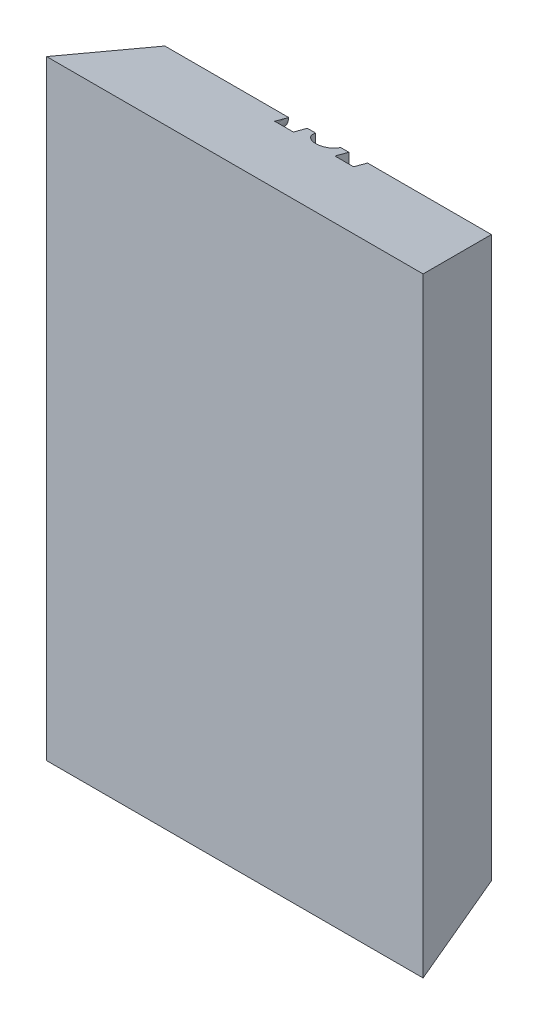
ISO-10303-21;
HEADER;
FILE_DESCRIPTION(('STEP AP214'),'2;1');
FILE_NAME('part.step','',(''),(''),'','','');
FILE_SCHEMA(('AUTOMOTIVE_DESIGN { 1 0 10303 214 1 1 1 1 }'));
ENDSEC;
DATA;
#1=APPLICATION_CONTEXT('core data for automotive mechanical design processes');
#2=APPLICATION_PROTOCOL_DEFINITION('international standard','automotive_design',2000,#1);
#3=PRODUCT_CONTEXT('',#1,'mechanical');
#4=PRODUCT('Part','Part','',(#3));
#5=PRODUCT_RELATED_PRODUCT_CATEGORY('part','',(#4));
#6=PRODUCT_DEFINITION_FORMATION('','',#4);
#7=PRODUCT_DEFINITION_CONTEXT('part definition',#1,'design');
#8=PRODUCT_DEFINITION('design','',#6,#7);
#9=PRODUCT_DEFINITION_SHAPE('','',#8);
#10=(LENGTH_UNIT() NAMED_UNIT(*) SI_UNIT(.MILLI.,.METRE.));
#11=(NAMED_UNIT(*) PLANE_ANGLE_UNIT() SI_UNIT($,.RADIAN.));
#12=(NAMED_UNIT(*) SI_UNIT($,.STERADIAN.) SOLID_ANGLE_UNIT());
#13=UNCERTAINTY_MEASURE_WITH_UNIT(LENGTH_MEASURE(1.E-05),#10,'distance_accuracy_value','');
#14=(GEOMETRIC_REPRESENTATION_CONTEXT(3) GLOBAL_UNCERTAINTY_ASSIGNED_CONTEXT((#13)) GLOBAL_UNIT_ASSIGNED_CONTEXT((#10,
#11,#12)) REPRESENTATION_CONTEXT('',''));
#15=CARTESIAN_POINT('',(0.,0.,0.));
#16=DIRECTION('',(0.,0.,1.));
#17=DIRECTION('',(1.,0.,0.));
#18=AXIS2_PLACEMENT_3D('',#15,#16,#17);
#19=CARTESIAN_POINT('',(17.5,55.,0.));
#20=DIRECTION('',(0.,0.965925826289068,-0.258819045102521));
#21=DIRECTION('',(0.,0.258819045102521,0.965925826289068));
#22=AXIS2_PLACEMENT_3D('',#19,#20,#21);
#23=PLANE('',#22);
#24=DIRECTION('',(-1.,0.,0.));
#25=VECTOR('',#24,1.);
#26=CARTESIAN_POINT('',(17.5,55.,0.));
#27=LINE('',#26,#25);
#28=CARTESIAN_POINT('',(2.22503401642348,55.,0.));
#29=VERTEX_POINT('',#28);
#30=CARTESIAN_POINT('',(1.33138479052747,55.,0.));
#31=VERTEX_POINT('',#30);
#32=EDGE_CURVE('E1454',#29,#31,#27,.T.);
#33=ORIENTED_EDGE('',*,*,#32,.T.);
#34=CARTESIAN_POINT('',(0.,55.,0.));
#35=DIRECTION('',(0.,0.965925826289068,-0.258819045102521));
#36=DIRECTION('',(0.,-0.258819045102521,-0.965925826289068));
#37=AXIS2_PLACEMENT_3D('',#34,#35,#36);
#38=ELLIPSE('',#37,1.37835096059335,1.33138479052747);
#39=CARTESIAN_POINT('',(-1.33138479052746,55.,0.));
#40=VERTEX_POINT('',#39);
#41=EDGE_CURVE('E1443',#31,#40,#38,.F.);
#42=ORIENTED_EDGE('',*,*,#41,.T.);
#43=CARTESIAN_POINT('',(-2.22503401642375,55.,0.));
#44=VERTEX_POINT('',#43);
#45=EDGE_CURVE('E1496',#40,#44,#27,.T.);
#46=ORIENTED_EDGE('',*,*,#45,.T.);
#47=DIRECTION('',(0.,0.258819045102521,0.965925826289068));
#48=VECTOR('',#47,1.);
#49=CARTESIAN_POINT('',(-2.22503401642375,55.,0.));
#50=LINE('',#49,#48);
#51=CARTESIAN_POINT('',(-2.22503401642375,55.4019237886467,1.5));
#52=VERTEX_POINT('',#51);
#53=EDGE_CURVE('E1436',#52,#44,#50,.F.);
#54=ORIENTED_EDGE('',*,*,#53,.F.);
#55=DIRECTION('',(-1.,0.,0.));
#56=VECTOR('',#55,1.);
#57=CARTESIAN_POINT('',(17.5,55.4019237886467,1.5));
#58=LINE('',#57,#56);
#59=CARTESIAN_POINT('',(-4.22503401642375,55.4019237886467,1.5));
#60=VERTEX_POINT('',#59);
#61=EDGE_CURVE('E40',#60,#52,#58,.F.);
#62=ORIENTED_EDGE('',*,*,#61,.F.);
#63=DIRECTION('',(0.,0.258819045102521,0.965925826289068));
#64=VECTOR('',#63,1.);
#65=CARTESIAN_POINT('',(-4.22503401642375,55.,0.));
#66=LINE('',#65,#64);
#67=CARTESIAN_POINT('',(-4.22503401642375,55.1,0.373205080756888));
#68=VERTEX_POINT('',#67);
#69=EDGE_CURVE('E11',#60,#68,#66,.F.);
#70=ORIENTED_EDGE('',*,*,#69,.T.);
#71=CARTESIAN_POINT('',(-6.02503401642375,55.1,0.373205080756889));
#72=DIRECTION('',(0.,0.965925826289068,-0.258819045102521));
#73=DIRECTION('',(0.,-0.258819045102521,-0.965925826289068));
#74=AXIS2_PLACEMENT_3D('',#71,#72,#73);
#75=ELLIPSE('',#74,6.95466594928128,1.8);
#76=CARTESIAN_POINT('',(-4.2278139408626,55.,0.));
#77=VERTEX_POINT('',#76);
#78=EDGE_CURVE('E1433',#68,#77,#75,.T.);
#79=ORIENTED_EDGE('',*,*,#78,.T.);
#80=CARTESIAN_POINT('',(-17.5,55.,0.));
#81=VERTEX_POINT('',#80);
#82=EDGE_CURVE('E1449',#77,#81,#27,.T.);
#83=ORIENTED_EDGE('',*,*,#82,.T.);
#84=DIRECTION('',(0.250562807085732,-0.250562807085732,-0.935113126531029));
#85=VECTOR('',#84,1.);
#86=CARTESIAN_POINT('',(-17.5,55.,0.));
#87=LINE('',#86,#85);
#88=CARTESIAN_POINT('',(-20.1794919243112,57.6794919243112,10.));
#89=VERTEX_POINT('',#88);
#90=EDGE_CURVE('E1463',#89,#81,#87,.T.);
#91=ORIENTED_EDGE('',*,*,#90,.F.);
#92=DIRECTION('',(1.,0.,0.));
#93=VECTOR('',#92,1.);
#94=CARTESIAN_POINT('',(0.,57.6794919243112,10.));
#95=LINE('',#94,#93);
#96=CARTESIAN_POINT('',(20.1794919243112,57.6794919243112,10.));
#97=VERTEX_POINT('',#96);
#98=EDGE_CURVE('E1475',#97,#89,#95,.F.);
#99=ORIENTED_EDGE('',*,*,#98,.F.);
#100=DIRECTION('',(-0.250562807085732,-0.250562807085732,-0.935113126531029));
#101=VECTOR('',#100,1.);
#102=CARTESIAN_POINT('',(17.5,55.,0.));
#103=LINE('',#102,#101);
#104=CARTESIAN_POINT('',(17.5,55.,0.));
#105=VERTEX_POINT('',#104);
#106=EDGE_CURVE('E1459',#97,#105,#103,.T.);
#107=ORIENTED_EDGE('',*,*,#106,.T.);
#108=CARTESIAN_POINT('',(4.22781394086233,55.,0.));
#109=VERTEX_POINT('',#108);
#110=EDGE_CURVE('E1450',#105,#109,#27,.T.);
#111=ORIENTED_EDGE('',*,*,#110,.T.);
#112=CARTESIAN_POINT('',(6.02503401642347,55.1,0.373205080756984));
#113=DIRECTION('',(0.,0.965925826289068,-0.258819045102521));
#114=DIRECTION('',(0.,-0.258819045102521,-0.965925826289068));
#115=AXIS2_PLACEMENT_3D('',#112,#113,#114);
#116=ELLIPSE('',#115,6.95466594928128,1.8);
#117=CARTESIAN_POINT('',(4.22503401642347,55.1,0.373205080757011));
#118=VERTEX_POINT('',#117);
#119=EDGE_CURVE('E1441',#118,#109,#116,.F.);
#120=ORIENTED_EDGE('',*,*,#119,.F.);
#121=DIRECTION('',(0.,0.258819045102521,0.965925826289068));
#122=VECTOR('',#121,1.);
#123=CARTESIAN_POINT('',(4.22503401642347,55.,0.));
#124=LINE('',#123,#122);
#125=CARTESIAN_POINT('',(4.22503401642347,55.4019237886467,1.5));
#126=VERTEX_POINT('',#125);
#127=EDGE_CURVE('E1480',#126,#118,#124,.F.);
#128=ORIENTED_EDGE('',*,*,#127,.F.);
#129=CARTESIAN_POINT('',(2.22503401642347,55.4019237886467,1.5));
#130=VERTEX_POINT('',#129);
#131=EDGE_CURVE('E1462',#130,#126,#58,.F.);
#132=ORIENTED_EDGE('',*,*,#131,.F.);
#133=DIRECTION('',(0.,0.258819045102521,0.965925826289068));
#134=VECTOR('',#133,1.);
#135=CARTESIAN_POINT('',(2.22503401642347,55.,0.));
#136=LINE('',#135,#134);
#137=EDGE_CURVE('E1438',#130,#29,#136,.F.);
#138=ORIENTED_EDGE('',*,*,#137,.T.);
#139=EDGE_LOOP('',(#33,#42,#46,#54,#62,#70,#79,#83,#91,#99,#107,#111,#120,#128,#132,#138));
#140=FACE_BOUND('',#139,.T.);
#141=ADVANCED_FACE('F33',(#140),#23,.T.);
#142=CARTESIAN_POINT('',(0.,0.,0.));
#143=DIRECTION('',(0.,0.,-1.));
#144=DIRECTION('',(-1.,0.,0.));
#145=AXIS2_PLACEMENT_3D('',#142,#143,#144);
#146=PLANE('',#145);
#147=CARTESIAN_POINT('',(9.73574454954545,45.4140128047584,0.));
#148=DIRECTION('',(0.,0.,1.));
#149=DIRECTION('',(1.,0.,0.));
#150=AXIS2_PLACEMENT_3D('',#147,#148,#149);
#151=CIRCLE('',#150,2.25826325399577);
#152=CARTESIAN_POINT('',(11.9940078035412,45.4140128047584,0.));
#153=VERTEX_POINT('',#152);
#154=EDGE_CURVE('E773',#153,#153,#151,.T.);
#155=ORIENTED_EDGE('',*,*,#154,.T.);
#156=EDGE_LOOP('',(#155));
#157=FACE_BOUND('',#156,.T.);
#158=DIRECTION('',(0.,-1.,0.));
#159=VECTOR('',#158,1.);
#160=CARTESIAN_POINT('',(-1.33138479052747,0.,0.));
#161=LINE('',#160,#159);
#162=CARTESIAN_POINT('',(-1.33138479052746,50.,0.));
#163=VERTEX_POINT('',#162);
#164=EDGE_CURVE('E905',#40,#163,#161,.T.);
#165=ORIENTED_EDGE('',*,*,#164,.T.);
#166=DIRECTION('',(-1.,0.,0.));
#167=VECTOR('',#166,1.);
#168=CARTESIAN_POINT('',(0.,50.,0.));
#169=LINE('',#168,#167);
#170=CARTESIAN_POINT('',(-4.30000000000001,50.,0.));
#171=VERTEX_POINT('',#170);
#172=EDGE_CURVE('E896',#163,#171,#169,.T.);
#173=ORIENTED_EDGE('',*,*,#172,.T.);
#174=CARTESIAN_POINT('',(-4.30000000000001,49.3000000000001,0.));
#175=DIRECTION('',(0.,0.,1.));
#176=DIRECTION('',(1.,0.,0.));
#177=AXIS2_PLACEMENT_3D('',#174,#175,#176);
#178=CIRCLE('',#177,0.7);
#179=CARTESIAN_POINT('',(-5.00000000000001,49.3000000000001,0.));
#180=VERTEX_POINT('',#179);
#181=EDGE_CURVE('E703',#171,#180,#178,.T.);
#182=ORIENTED_EDGE('',*,*,#181,.T.);
#183=DIRECTION('',(0.,-1.,0.));
#184=VECTOR('',#183,1.);
#185=CARTESIAN_POINT('',(-5.00000000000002,0.,0.));
#186=LINE('',#185,#184);
#187=CARTESIAN_POINT('',(-5.00000000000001,48.7,0.));
#188=VERTEX_POINT('',#187);
#189=EDGE_CURVE('E899',#180,#188,#186,.T.);
#190=ORIENTED_EDGE('',*,*,#189,.T.);
#191=CARTESIAN_POINT('',(-4.30000000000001,48.7,0.));
#192=DIRECTION('',(0.,0.,1.));
#193=DIRECTION('',(1.,0.,0.));
#194=AXIS2_PLACEMENT_3D('',#191,#192,#193);
#195=CIRCLE('',#194,0.7);
#196=CARTESIAN_POINT('',(-4.30000000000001,48.,0.));
#197=VERTEX_POINT('',#196);
#198=EDGE_CURVE('E902',#188,#197,#195,.T.);
#199=ORIENTED_EDGE('',*,*,#198,.T.);
#200=DIRECTION('',(1.,0.,0.));
#201=VECTOR('',#200,1.);
#202=CARTESIAN_POINT('',(0.,48.,0.));
#203=LINE('',#202,#201);
#204=CARTESIAN_POINT('',(-3.49999999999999,48.,0.));
#205=VERTEX_POINT('',#204);
#206=EDGE_CURVE('E908',#197,#205,#203,.T.);
#207=ORIENTED_EDGE('',*,*,#206,.T.);
#208=DIRECTION('',(0.,-1.,0.));
#209=VECTOR('',#208,1.);
#210=CARTESIAN_POINT('',(-3.5,0.,0.));
#211=LINE('',#210,#209);
#212=CARTESIAN_POINT('',(-3.49999999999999,46.4000000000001,0.));
#213=VERTEX_POINT('',#212);
#214=EDGE_CURVE('E911',#205,#213,#211,.T.);
#215=ORIENTED_EDGE('',*,*,#214,.T.);
#216=DIRECTION('',(-1.,0.,0.));
#217=VECTOR('',#216,1.);
#218=CARTESIAN_POINT('',(0.,46.3999999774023,0.));
#219=LINE('',#218,#217);
#220=CARTESIAN_POINT('',(-4.29999999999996,46.3999999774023,0.));
#221=VERTEX_POINT('',#220);
#222=EDGE_CURVE('E915',#213,#221,#219,.T.);
#223=ORIENTED_EDGE('',*,*,#222,.T.);
#224=CARTESIAN_POINT('',(-4.29999999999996,45.6999999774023,0.));
#225=DIRECTION('',(0.,0.,1.));
#226=DIRECTION('',(1.,0.,0.));
#227=AXIS2_PLACEMENT_3D('',#224,#225,#226);
#228=CIRCLE('',#227,0.7);
#229=CARTESIAN_POINT('',(-4.99999999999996,45.6999999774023,0.));
#230=VERTEX_POINT('',#229);
#231=EDGE_CURVE('E918',#221,#230,#228,.T.);
#232=ORIENTED_EDGE('',*,*,#231,.T.);
#233=DIRECTION('',(0.,-1.,0.));
#234=VECTOR('',#233,1.);
#235=CARTESIAN_POINT('',(-4.99999999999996,0.,0.));
#236=LINE('',#235,#234);
#237=CARTESIAN_POINT('',(-4.99999999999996,45.5999999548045,0.));
#238=VERTEX_POINT('',#237);
#239=EDGE_CURVE('E922',#230,#238,#236,.T.);
#240=ORIENTED_EDGE('',*,*,#239,.T.);
#241=CARTESIAN_POINT('',(-4.29999999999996,45.5999999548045,0.));
#242=DIRECTION('',(0.,0.,1.));
#243=DIRECTION('',(1.,0.,0.));
#244=AXIS2_PLACEMENT_3D('',#241,#242,#243);
#245=CIRCLE('',#244,0.7);
#246=CARTESIAN_POINT('',(-4.29999999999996,44.8999999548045,0.));
#247=VERTEX_POINT('',#246);
#248=EDGE_CURVE('E925',#238,#247,#245,.T.);
#249=ORIENTED_EDGE('',*,*,#248,.T.);
#250=DIRECTION('',(1.,0.,0.));
#251=VECTOR('',#250,1.);
#252=CARTESIAN_POINT('',(0.,44.8999999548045,0.));
#253=LINE('',#252,#251);
#254=CARTESIAN_POINT('',(-3.50000000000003,44.8999999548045,0.));
#255=VERTEX_POINT('',#254);
#256=EDGE_CURVE('E928',#247,#255,#253,.T.);
#257=ORIENTED_EDGE('',*,*,#256,.T.);
#258=DIRECTION('',(0.,-1.,0.));
#259=VECTOR('',#258,1.);
#260=CARTESIAN_POINT('',(-3.50000000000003,0.,0.));
#261=LINE('',#260,#259);
#262=CARTESIAN_POINT('',(-3.50000000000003,43.2999999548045,0.));
#263=VERTEX_POINT('',#262);
#264=EDGE_CURVE('E931',#255,#263,#261,.T.);
#265=ORIENTED_EDGE('',*,*,#264,.T.);
#266=DIRECTION('',(-1.,0.,0.));
#267=VECTOR('',#266,1.);
#268=CARTESIAN_POINT('',(0.,43.2999999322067,0.));
#269=LINE('',#268,#267);
#270=CARTESIAN_POINT('',(-4.30000000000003,43.2999999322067,0.));
#271=VERTEX_POINT('',#270);
#272=EDGE_CURVE('E935',#263,#271,#269,.T.);
#273=ORIENTED_EDGE('',*,*,#272,.T.);
#274=CARTESIAN_POINT('',(-4.30000000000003,42.5999999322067,0.));
#275=DIRECTION('',(0.,0.,1.));
#276=DIRECTION('',(1.,0.,0.));
#277=AXIS2_PLACEMENT_3D('',#274,#275,#276);
#278=CIRCLE('',#277,0.7);
#279=CARTESIAN_POINT('',(-5.00000000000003,42.5999999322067,0.));
#280=VERTEX_POINT('',#279);
#281=EDGE_CURVE('E938',#271,#280,#278,.T.);
#282=ORIENTED_EDGE('',*,*,#281,.T.);
#283=DIRECTION('',(0.,-1.,0.));
#284=VECTOR('',#283,1.);
#285=CARTESIAN_POINT('',(-5.00000000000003,0.,0.));
#286=LINE('',#285,#284);
#287=CARTESIAN_POINT('',(-5.00000000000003,42.499999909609,0.));
#288=VERTEX_POINT('',#287);
#289=EDGE_CURVE('E942',#280,#288,#286,.T.);
#290=ORIENTED_EDGE('',*,*,#289,.T.);
#291=CARTESIAN_POINT('',(-4.30000000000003,42.499999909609,0.));
#292=DIRECTION('',(0.,0.,1.));
#293=DIRECTION('',(1.,0.,0.));
#294=AXIS2_PLACEMENT_3D('',#291,#292,#293);
#295=CIRCLE('',#294,0.7);
#296=CARTESIAN_POINT('',(-4.30000000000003,41.799999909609,0.));
#297=VERTEX_POINT('',#296);
#298=EDGE_CURVE('E945',#288,#297,#295,.T.);
#299=ORIENTED_EDGE('',*,*,#298,.T.);
#300=DIRECTION('',(1.,0.,0.));
#301=VECTOR('',#300,1.);
#302=CARTESIAN_POINT('',(0.,41.799999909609,0.));
#303=LINE('',#302,#301);
#304=CARTESIAN_POINT('',(-3.50000000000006,41.799999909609,0.));
#305=VERTEX_POINT('',#304);
#306=EDGE_CURVE('E948',#297,#305,#303,.T.);
#307=ORIENTED_EDGE('',*,*,#306,.T.);
#308=DIRECTION('',(0.,-1.,0.));
#309=VECTOR('',#308,1.);
#310=CARTESIAN_POINT('',(-3.50000000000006,0.,0.));
#311=LINE('',#310,#309);
#312=CARTESIAN_POINT('',(-3.50000000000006,40.199999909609,0.));
#313=VERTEX_POINT('',#312);
#314=EDGE_CURVE('E951',#305,#313,#311,.T.);
#315=ORIENTED_EDGE('',*,*,#314,.T.);
#316=DIRECTION('',(-1.,0.,0.));
#317=VECTOR('',#316,1.);
#318=CARTESIAN_POINT('',(0.,40.1999998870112,0.));
#319=LINE('',#318,#317);
#320=CARTESIAN_POINT('',(-4.30000000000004,40.1999998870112,0.));
#321=VERTEX_POINT('',#320);
#322=EDGE_CURVE('E955',#313,#321,#319,.T.);
#323=ORIENTED_EDGE('',*,*,#322,.T.);
#324=CARTESIAN_POINT('',(-4.30000000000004,39.4999998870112,0.));
#325=DIRECTION('',(0.,0.,1.));
#326=DIRECTION('',(1.,0.,0.));
#327=AXIS2_PLACEMENT_3D('',#324,#325,#326);
#328=CIRCLE('',#327,0.7);
#329=CARTESIAN_POINT('',(-5.00000000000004,39.4999998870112,0.));
#330=VERTEX_POINT('',#329);
#331=EDGE_CURVE('E958',#321,#330,#328,.T.);
#332=ORIENTED_EDGE('',*,*,#331,.T.);
#333=DIRECTION('',(0.,-1.,0.));
#334=VECTOR('',#333,1.);
#335=CARTESIAN_POINT('',(-5.00000000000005,0.,0.));
#336=LINE('',#335,#334);
#337=CARTESIAN_POINT('',(-5.00000000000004,39.3999998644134,0.));
#338=VERTEX_POINT('',#337);
#339=EDGE_CURVE('E962',#330,#338,#336,.T.);
#340=ORIENTED_EDGE('',*,*,#339,.T.);
#341=CARTESIAN_POINT('',(-4.30000000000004,39.3999998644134,0.));
#342=DIRECTION('',(0.,0.,1.));
#343=DIRECTION('',(1.,0.,0.));
#344=AXIS2_PLACEMENT_3D('',#341,#342,#343);
#345=CIRCLE('',#344,0.7);
#346=CARTESIAN_POINT('',(-4.30000000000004,38.6999998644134,0.));
#347=VERTEX_POINT('',#346);
#348=EDGE_CURVE('E965',#338,#347,#345,.T.);
#349=ORIENTED_EDGE('',*,*,#348,.T.);
#350=DIRECTION('',(1.,0.,0.));
#351=VECTOR('',#350,1.);
#352=CARTESIAN_POINT('',(0.,38.6999998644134,0.));
#353=LINE('',#352,#351);
#354=CARTESIAN_POINT('',(-3.50000000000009,38.6999998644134,0.));
#355=VERTEX_POINT('',#354);
#356=EDGE_CURVE('E968',#347,#355,#353,.T.);
#357=ORIENTED_EDGE('',*,*,#356,.T.);
#358=DIRECTION('',(0.,-1.,0.));
#359=VECTOR('',#358,1.);
#360=CARTESIAN_POINT('',(-3.5000000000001,0.,0.));
#361=LINE('',#360,#359);
#362=CARTESIAN_POINT('',(-3.50000000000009,37.0999998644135,0.));
#363=VERTEX_POINT('',#362);
#364=EDGE_CURVE('E971',#355,#363,#361,.T.);
#365=ORIENTED_EDGE('',*,*,#364,.T.);
#366=DIRECTION('',(-1.,0.,0.));
#367=VECTOR('',#366,1.);
#368=CARTESIAN_POINT('',(0.,37.0999998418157,0.));
#369=LINE('',#368,#367);
#370=CARTESIAN_POINT('',(-4.30000000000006,37.0999998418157,0.));
#371=VERTEX_POINT('',#370);
#372=EDGE_CURVE('E975',#363,#371,#369,.T.);
#373=ORIENTED_EDGE('',*,*,#372,.T.);
#374=CARTESIAN_POINT('',(-4.30000000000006,36.3999998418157,0.));
#375=DIRECTION('',(0.,0.,1.));
#376=DIRECTION('',(1.,0.,0.));
#377=AXIS2_PLACEMENT_3D('',#374,#375,#376);
#378=CIRCLE('',#377,0.7);
#379=CARTESIAN_POINT('',(-5.00000000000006,36.3999998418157,0.));
#380=VERTEX_POINT('',#379);
#381=EDGE_CURVE('E978',#371,#380,#378,.T.);
#382=ORIENTED_EDGE('',*,*,#381,.T.);
#383=DIRECTION('',(0.,-1.,0.));
#384=VECTOR('',#383,1.);
#385=CARTESIAN_POINT('',(-5.00000000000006,0.,0.));
#386=LINE('',#385,#384);
#387=CARTESIAN_POINT('',(-5.00000000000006,36.2999998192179,0.));
#388=VERTEX_POINT('',#387);
#389=EDGE_CURVE('E982',#380,#388,#386,.T.);
#390=ORIENTED_EDGE('',*,*,#389,.T.);
#391=CARTESIAN_POINT('',(-4.30000000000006,36.2999998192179,0.));
#392=DIRECTION('',(0.,0.,1.));
#393=DIRECTION('',(1.,0.,0.));
#394=AXIS2_PLACEMENT_3D('',#391,#392,#393);
#395=CIRCLE('',#394,0.7);
#396=CARTESIAN_POINT('',(-4.30000000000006,35.5999998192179,0.));
#397=VERTEX_POINT('',#396);
#398=EDGE_CURVE('E985',#388,#397,#395,.T.);
#399=ORIENTED_EDGE('',*,*,#398,.T.);
#400=DIRECTION('',(1.,0.,0.));
#401=VECTOR('',#400,1.);
#402=CARTESIAN_POINT('',(0.,35.5999998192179,0.));
#403=LINE('',#402,#401);
#404=CARTESIAN_POINT('',(-3.50000000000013,35.5999998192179,0.));
#405=VERTEX_POINT('',#404);
#406=EDGE_CURVE('E988',#397,#405,#403,.T.);
#407=ORIENTED_EDGE('',*,*,#406,.T.);
#408=DIRECTION('',(0.,-1.,0.));
#409=VECTOR('',#408,1.);
#410=CARTESIAN_POINT('',(-3.50000000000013,0.,0.));
#411=LINE('',#410,#409);
#412=CARTESIAN_POINT('',(-3.50000000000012,33.9999998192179,0.));
#413=VERTEX_POINT('',#412);
#414=EDGE_CURVE('E991',#405,#413,#411,.T.);
#415=ORIENTED_EDGE('',*,*,#414,.T.);
#416=DIRECTION('',(-1.,0.,0.));
#417=VECTOR('',#416,1.);
#418=CARTESIAN_POINT('',(0.,33.9999997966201,0.));
#419=LINE('',#418,#417);
#420=CARTESIAN_POINT('',(-4.30000000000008,33.9999997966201,0.));
#421=VERTEX_POINT('',#420);
#422=EDGE_CURVE('E995',#413,#421,#419,.T.);
#423=ORIENTED_EDGE('',*,*,#422,.T.);
#424=CARTESIAN_POINT('',(-4.30000000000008,33.2999997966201,0.));
#425=DIRECTION('',(0.,0.,1.));
#426=DIRECTION('',(1.,0.,0.));
#427=AXIS2_PLACEMENT_3D('',#424,#425,#426);
#428=CIRCLE('',#427,0.7);
#429=CARTESIAN_POINT('',(-5.00000000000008,33.2999997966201,0.));
#430=VERTEX_POINT('',#429);
#431=EDGE_CURVE('E998',#421,#430,#428,.T.);
#432=ORIENTED_EDGE('',*,*,#431,.T.);
#433=DIRECTION('',(0.,-1.,0.));
#434=VECTOR('',#433,1.);
#435=CARTESIAN_POINT('',(-5.00000000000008,0.,0.));
#436=LINE('',#435,#434);
#437=CARTESIAN_POINT('',(-5.00000000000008,33.1999997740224,0.));
#438=VERTEX_POINT('',#437);
#439=EDGE_CURVE('E1002',#430,#438,#436,.T.);
#440=ORIENTED_EDGE('',*,*,#439,.T.);
#441=CARTESIAN_POINT('',(-4.30000000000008,33.1999997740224,0.));
#442=DIRECTION('',(0.,0.,1.));
#443=DIRECTION('',(1.,0.,0.));
#444=AXIS2_PLACEMENT_3D('',#441,#442,#443);
#445=CIRCLE('',#444,0.7);
#446=CARTESIAN_POINT('',(-4.30000000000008,32.4999997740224,0.));
#447=VERTEX_POINT('',#446);
#448=EDGE_CURVE('E1005',#438,#447,#445,.T.);
#449=ORIENTED_EDGE('',*,*,#448,.T.);
#450=DIRECTION('',(1.,0.,0.));
#451=VECTOR('',#450,1.);
#452=CARTESIAN_POINT('',(0.,32.4999997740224,0.));
#453=LINE('',#452,#451);
#454=CARTESIAN_POINT('',(-3.50000000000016,32.4999997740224,0.));
#455=VERTEX_POINT('',#454);
#456=EDGE_CURVE('E1008',#447,#455,#453,.T.);
#457=ORIENTED_EDGE('',*,*,#456,.T.);
#458=DIRECTION('',(0.,-1.,0.));
#459=VECTOR('',#458,1.);
#460=CARTESIAN_POINT('',(-3.50000000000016,0.,0.));
#461=LINE('',#460,#459);
#462=CARTESIAN_POINT('',(-3.50000000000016,30.8999997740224,0.));
#463=VERTEX_POINT('',#462);
#464=EDGE_CURVE('E1011',#455,#463,#461,.T.);
#465=ORIENTED_EDGE('',*,*,#464,.T.);
#466=DIRECTION('',(-1.,0.,0.));
#467=VECTOR('',#466,1.);
#468=CARTESIAN_POINT('',(0.,30.8999997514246,0.));
#469=LINE('',#468,#467);
#470=CARTESIAN_POINT('',(-4.30000000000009,30.8999997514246,0.));
#471=VERTEX_POINT('',#470);
#472=EDGE_CURVE('E1015',#463,#471,#469,.T.);
#473=ORIENTED_EDGE('',*,*,#472,.T.);
#474=CARTESIAN_POINT('',(-4.30000000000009,30.1999997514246,0.));
#475=DIRECTION('',(0.,0.,1.));
#476=DIRECTION('',(1.,0.,0.));
#477=AXIS2_PLACEMENT_3D('',#474,#475,#476);
#478=CIRCLE('',#477,0.7);
#479=CARTESIAN_POINT('',(-5.0000000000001,30.1999997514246,0.));
#480=VERTEX_POINT('',#479);
#481=EDGE_CURVE('E1018',#471,#480,#478,.T.);
#482=ORIENTED_EDGE('',*,*,#481,.T.);
#483=DIRECTION('',(0.,-1.,0.));
#484=VECTOR('',#483,1.);
#485=CARTESIAN_POINT('',(-5.0000000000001,0.,0.));
#486=LINE('',#485,#484);
#487=CARTESIAN_POINT('',(-5.0000000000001,30.0999997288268,0.));
#488=VERTEX_POINT('',#487);
#489=EDGE_CURVE('E1022',#480,#488,#486,.T.);
#490=ORIENTED_EDGE('',*,*,#489,.T.);
#491=CARTESIAN_POINT('',(-4.30000000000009,30.0999997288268,0.));
#492=DIRECTION('',(0.,0.,1.));
#493=DIRECTION('',(1.,0.,0.));
#494=AXIS2_PLACEMENT_3D('',#491,#492,#493);
#495=CIRCLE('',#494,0.7);
#496=CARTESIAN_POINT('',(-4.30000000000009,29.3999997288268,0.));
#497=VERTEX_POINT('',#496);
#498=EDGE_CURVE('E1025',#488,#497,#495,.T.);
#499=ORIENTED_EDGE('',*,*,#498,.T.);
#500=DIRECTION('',(1.,0.,0.));
#501=VECTOR('',#500,1.);
#502=CARTESIAN_POINT('',(0.,29.3999997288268,0.));
#503=LINE('',#502,#501);
#504=CARTESIAN_POINT('',(-3.50000000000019,29.3999997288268,0.));
#505=VERTEX_POINT('',#504);
#506=EDGE_CURVE('E1028',#497,#505,#503,.T.);
#507=ORIENTED_EDGE('',*,*,#506,.T.);
#508=DIRECTION('',(0.,-1.,0.));
#509=VECTOR('',#508,1.);
#510=CARTESIAN_POINT('',(-3.50000000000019,0.,0.));
#511=LINE('',#510,#509);
#512=CARTESIAN_POINT('',(-3.50000000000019,27.7999997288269,0.));
#513=VERTEX_POINT('',#512);
#514=EDGE_CURVE('E1031',#505,#513,#511,.T.);
#515=ORIENTED_EDGE('',*,*,#514,.T.);
#516=DIRECTION('',(-1.,0.,0.));
#517=VECTOR('',#516,1.);
#518=CARTESIAN_POINT('',(0.,27.7999997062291,0.));
#519=LINE('',#518,#517);
#520=CARTESIAN_POINT('',(-4.30000000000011,27.7999997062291,0.));
#521=VERTEX_POINT('',#520);
#522=EDGE_CURVE('E1035',#513,#521,#519,.T.);
#523=ORIENTED_EDGE('',*,*,#522,.T.);
#524=CARTESIAN_POINT('',(-4.30000000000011,27.0999997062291,0.));
#525=DIRECTION('',(0.,0.,1.));
#526=DIRECTION('',(1.,0.,0.));
#527=AXIS2_PLACEMENT_3D('',#524,#525,#526);
#528=CIRCLE('',#527,0.7);
#529=CARTESIAN_POINT('',(-5.00000000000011,27.0999997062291,0.));
#530=VERTEX_POINT('',#529);
#531=EDGE_CURVE('E1038',#521,#530,#528,.T.);
#532=ORIENTED_EDGE('',*,*,#531,.T.);
#533=DIRECTION('',(0.,-1.,0.));
#534=VECTOR('',#533,1.);
#535=CARTESIAN_POINT('',(-5.00000000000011,0.,0.));
#536=LINE('',#535,#534);
#537=CARTESIAN_POINT('',(-5.00000000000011,26.9999996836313,0.));
#538=VERTEX_POINT('',#537);
#539=EDGE_CURVE('E1042',#530,#538,#536,.T.);
#540=ORIENTED_EDGE('',*,*,#539,.T.);
#541=CARTESIAN_POINT('',(-4.30000000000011,26.9999996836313,0.));
#542=DIRECTION('',(0.,0.,1.));
#543=DIRECTION('',(1.,0.,0.));
#544=AXIS2_PLACEMENT_3D('',#541,#542,#543);
#545=CIRCLE('',#544,0.7);
#546=CARTESIAN_POINT('',(-4.30000000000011,26.2999996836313,0.));
#547=VERTEX_POINT('',#546);
#548=EDGE_CURVE('E1045',#538,#547,#545,.T.);
#549=ORIENTED_EDGE('',*,*,#548,.T.);
#550=DIRECTION('',(1.,0.,0.));
#551=VECTOR('',#550,1.);
#552=CARTESIAN_POINT('',(0.,26.2999996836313,0.));
#553=LINE('',#552,#551);
#554=CARTESIAN_POINT('',(-3.50000000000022,26.2999996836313,0.));
#555=VERTEX_POINT('',#554);
#556=EDGE_CURVE('E1048',#547,#555,#553,.T.);
#557=ORIENTED_EDGE('',*,*,#556,.T.);
#558=DIRECTION('',(0.,-1.,0.));
#559=VECTOR('',#558,1.);
#560=CARTESIAN_POINT('',(-3.50000000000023,0.,0.));
#561=LINE('',#560,#559);
#562=CARTESIAN_POINT('',(-3.50000000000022,24.6999996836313,0.));
#563=VERTEX_POINT('',#562);
#564=EDGE_CURVE('E1051',#555,#563,#561,.T.);
#565=ORIENTED_EDGE('',*,*,#564,.T.);
#566=DIRECTION('',(-1.,0.,0.));
#567=VECTOR('',#566,1.);
#568=CARTESIAN_POINT('',(0.,24.6999996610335,0.));
#569=LINE('',#568,#567);
#570=CARTESIAN_POINT('',(-4.30000000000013,24.6999996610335,0.));
#571=VERTEX_POINT('',#570);
#572=EDGE_CURVE('E1055',#563,#571,#569,.T.);
#573=ORIENTED_EDGE('',*,*,#572,.T.);
#574=CARTESIAN_POINT('',(-4.30000000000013,23.9999996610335,0.));
#575=DIRECTION('',(0.,0.,1.));
#576=DIRECTION('',(1.,0.,0.));
#577=AXIS2_PLACEMENT_3D('',#574,#575,#576);
#578=CIRCLE('',#577,0.7);
#579=CARTESIAN_POINT('',(-5.00000000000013,23.9999996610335,0.));
#580=VERTEX_POINT('',#579);
#581=EDGE_CURVE('E1058',#571,#580,#578,.T.);
#582=ORIENTED_EDGE('',*,*,#581,.T.);
#583=DIRECTION('',(0.,-1.,0.));
#584=VECTOR('',#583,1.);
#585=CARTESIAN_POINT('',(-5.00000000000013,0.,0.));
#586=LINE('',#585,#584);
#587=CARTESIAN_POINT('',(-5.00000000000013,23.8999996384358,0.));
#588=VERTEX_POINT('',#587);
#589=EDGE_CURVE('E1062',#580,#588,#586,.T.);
#590=ORIENTED_EDGE('',*,*,#589,.T.);
#591=CARTESIAN_POINT('',(-4.30000000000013,23.8999996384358,0.));
#592=DIRECTION('',(0.,0.,1.));
#593=DIRECTION('',(1.,0.,0.));
#594=AXIS2_PLACEMENT_3D('',#591,#592,#593);
#595=CIRCLE('',#594,0.7);
#596=CARTESIAN_POINT('',(-4.30000000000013,23.1999996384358,0.));
#597=VERTEX_POINT('',#596);
#598=EDGE_CURVE('E1065',#588,#597,#595,.T.);
#599=ORIENTED_EDGE('',*,*,#598,.T.);
#600=DIRECTION('',(1.,0.,0.));
#601=VECTOR('',#600,1.);
#602=CARTESIAN_POINT('',(0.,23.1999996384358,0.));
#603=LINE('',#602,#601);
#604=CARTESIAN_POINT('',(-3.50000000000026,23.1999996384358,0.));
#605=VERTEX_POINT('',#604);
#606=EDGE_CURVE('E1068',#597,#605,#603,.T.);
#607=ORIENTED_EDGE('',*,*,#606,.T.);
#608=DIRECTION('',(0.,-1.,0.));
#609=VECTOR('',#608,1.);
#610=CARTESIAN_POINT('',(-3.50000000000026,0.,0.));
#611=LINE('',#610,#609);
#612=CARTESIAN_POINT('',(-3.50000000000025,21.5999996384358,0.));
#613=VERTEX_POINT('',#612);
#614=EDGE_CURVE('E1071',#605,#613,#611,.T.);
#615=ORIENTED_EDGE('',*,*,#614,.T.);
#616=DIRECTION('',(-1.,0.,0.));
#617=VECTOR('',#616,1.);
#618=CARTESIAN_POINT('',(0.,21.599999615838,0.));
#619=LINE('',#618,#617);
#620=CARTESIAN_POINT('',(-4.30000000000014,21.599999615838,0.));
#621=VERTEX_POINT('',#620);
#622=EDGE_CURVE('E1075',#613,#621,#619,.T.);
#623=ORIENTED_EDGE('',*,*,#622,.T.);
#624=CARTESIAN_POINT('',(-4.30000000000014,20.899999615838,0.));
#625=DIRECTION('',(0.,0.,1.));
#626=DIRECTION('',(1.,0.,0.));
#627=AXIS2_PLACEMENT_3D('',#624,#625,#626);
#628=CIRCLE('',#627,0.7);
#629=CARTESIAN_POINT('',(-5.00000000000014,20.899999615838,0.));
#630=VERTEX_POINT('',#629);
#631=EDGE_CURVE('E1078',#621,#630,#628,.T.);
#632=ORIENTED_EDGE('',*,*,#631,.T.);
#633=DIRECTION('',(0.,-1.,0.));
#634=VECTOR('',#633,1.);
#635=CARTESIAN_POINT('',(-5.00000000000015,0.,0.));
#636=LINE('',#635,#634);
#637=CARTESIAN_POINT('',(-5.00000000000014,20.7999995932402,0.));
#638=VERTEX_POINT('',#637);
#639=EDGE_CURVE('E1082',#630,#638,#636,.T.);
#640=ORIENTED_EDGE('',*,*,#639,.T.);
#641=CARTESIAN_POINT('',(-4.30000000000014,20.7999995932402,0.));
#642=DIRECTION('',(0.,0.,1.));
#643=DIRECTION('',(1.,0.,0.));
#644=AXIS2_PLACEMENT_3D('',#641,#642,#643);
#645=CIRCLE('',#644,0.7);
#646=CARTESIAN_POINT('',(-4.30000000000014,20.0999995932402,0.));
#647=VERTEX_POINT('',#646);
#648=EDGE_CURVE('E1085',#638,#647,#645,.T.);
#649=ORIENTED_EDGE('',*,*,#648,.T.);
#650=DIRECTION('',(1.,0.,0.));
#651=VECTOR('',#650,1.);
#652=CARTESIAN_POINT('',(0.,20.0999995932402,0.));
#653=LINE('',#652,#651);
#654=CARTESIAN_POINT('',(-3.50000000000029,20.0999995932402,0.));
#655=VERTEX_POINT('',#654);
#656=EDGE_CURVE('E1088',#647,#655,#653,.T.);
#657=ORIENTED_EDGE('',*,*,#656,.T.);
#658=DIRECTION('',(0.,-1.,0.));
#659=VECTOR('',#658,1.);
#660=CARTESIAN_POINT('',(-3.50000000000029,0.,0.));
#661=LINE('',#660,#659);
#662=CARTESIAN_POINT('',(-3.50000000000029,18.4999995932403,0.));
#663=VERTEX_POINT('',#662);
#664=EDGE_CURVE('E1091',#655,#663,#661,.T.);
#665=ORIENTED_EDGE('',*,*,#664,.T.);
#666=DIRECTION('',(-1.,0.,0.));
#667=VECTOR('',#666,1.);
#668=CARTESIAN_POINT('',(0.,18.4999995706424,0.));
#669=LINE('',#668,#667);
#670=CARTESIAN_POINT('',(-4.30000000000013,18.4999995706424,0.));
#671=VERTEX_POINT('',#670);
#672=EDGE_CURVE('E1095',#663,#671,#669,.T.);
#673=ORIENTED_EDGE('',*,*,#672,.T.);
#674=CARTESIAN_POINT('',(-4.30000000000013,17.7999995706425,0.));
#675=DIRECTION('',(0.,0.,1.));
#676=DIRECTION('',(1.,0.,0.));
#677=AXIS2_PLACEMENT_3D('',#674,#675,#676);
#678=CIRCLE('',#677,0.7);
#679=CARTESIAN_POINT('',(-5.00000000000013,17.7999995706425,0.));
#680=VERTEX_POINT('',#679);
#681=EDGE_CURVE('E1098',#671,#680,#678,.T.);
#682=ORIENTED_EDGE('',*,*,#681,.T.);
#683=DIRECTION('',(0.,-1.,0.));
#684=VECTOR('',#683,1.);
#685=CARTESIAN_POINT('',(-5.00000000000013,0.,0.));
#686=LINE('',#685,#684);
#687=CARTESIAN_POINT('',(-5.00000000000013,17.0937422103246,0.));
#688=VERTEX_POINT('',#687);
#689=EDGE_CURVE('E1102',#680,#688,#686,.T.);
#690=ORIENTED_EDGE('',*,*,#689,.T.);
#691=CARTESIAN_POINT('',(-5.70000000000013,17.0937422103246,0.));
#692=DIRECTION('',(0.,0.,1.));
#693=DIRECTION('',(1.,0.,0.));
#694=AXIS2_PLACEMENT_3D('',#691,#692,#693);
#695=CIRCLE('',#694,0.7);
#696=CARTESIAN_POINT('',(-5.02466532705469,16.9095600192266,0.));
#697=VERTEX_POINT('',#696);
#698=EDGE_CURVE('E1105',#697,#688,#695,.T.);
#699=ORIENTED_EDGE('',*,*,#698,.F.);
#700=DIRECTION('',(-0.263117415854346,-0.964763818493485,0.));
#701=VECTOR('',#700,1.);
#702=CARTESIAN_POINT('',(0.,35.3333321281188,0.));
#703=LINE('',#702,#701);
#704=CARTESIAN_POINT('',(-7.7588593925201,6.88418219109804,0.));
#705=VERTEX_POINT('',#704);
#706=EDGE_CURVE('E1108',#697,#705,#703,.T.);
#707=ORIENTED_EDGE('',*,*,#706,.T.);
#708=CARTESIAN_POINT('',(-7.08352471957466,6.7,0.));
#709=DIRECTION('',(0.,0.,1.));
#710=DIRECTION('',(1.,0.,0.));
#711=AXIS2_PLACEMENT_3D('',#708,#709,#710);
#712=CIRCLE('',#711,0.7);
#713=CARTESIAN_POINT('',(-7.08352471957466,6.,0.));
#714=VERTEX_POINT('',#713);
#715=EDGE_CURVE('E1111',#705,#714,#712,.T.);
#716=ORIENTED_EDGE('',*,*,#715,.T.);
#717=DIRECTION('',(1.,0.,0.));
#718=VECTOR('',#717,1.);
#719=CARTESIAN_POINT('',(0.,6.,0.));
#720=LINE('',#719,#718);
#721=CARTESIAN_POINT('',(-7.,6.,0.));
#722=VERTEX_POINT('',#721);
#723=EDGE_CURVE('E1114',#714,#722,#720,.T.);
#724=ORIENTED_EDGE('',*,*,#723,.T.);
#725=DIRECTION('',(0.,-1.,0.));
#726=VECTOR('',#725,1.);
#727=CARTESIAN_POINT('',(-7.,0.,0.));
#728=LINE('',#727,#726);
#729=CARTESIAN_POINT('',(-7.,4.,0.));
#730=VERTEX_POINT('',#729);
#731=EDGE_CURVE('E1117',#722,#730,#728,.T.);
#732=ORIENTED_EDGE('',*,*,#731,.T.);
#733=DIRECTION('',(-1.,0.,0.));
#734=VECTOR('',#733,1.);
#735=CARTESIAN_POINT('',(0.,4.,0.));
#736=LINE('',#735,#734);
#737=CARTESIAN_POINT('',(-7.3,4.,0.));
#738=VERTEX_POINT('',#737);
#739=EDGE_CURVE('E1121',#730,#738,#736,.T.);
#740=ORIENTED_EDGE('',*,*,#739,.T.);
#741=CARTESIAN_POINT('',(-7.3,3.3,0.));
#742=DIRECTION('',(0.,0.,1.));
#743=DIRECTION('',(1.,0.,0.));
#744=AXIS2_PLACEMENT_3D('',#741,#742,#743);
#745=CIRCLE('',#744,0.7);
#746=CARTESIAN_POINT('',(-8.,3.3,0.));
#747=VERTEX_POINT('',#746);
#748=EDGE_CURVE('E1124',#738,#747,#745,.T.);
#749=ORIENTED_EDGE('',*,*,#748,.T.);
#750=DIRECTION('',(0.,-1.,0.));
#751=VECTOR('',#750,1.);
#752=CARTESIAN_POINT('',(-8.,0.,0.));
#753=LINE('',#752,#751);
#754=CARTESIAN_POINT('',(-8.,0.700000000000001,0.));
#755=VERTEX_POINT('',#754);
#756=EDGE_CURVE('E1128',#747,#755,#753,.T.);
#757=ORIENTED_EDGE('',*,*,#756,.T.);
#758=CARTESIAN_POINT('',(-7.3,0.7,0.));
#759=DIRECTION('',(0.,0.,1.));
#760=DIRECTION('',(1.,0.,0.));
#761=AXIS2_PLACEMENT_3D('',#758,#759,#760);
#762=CIRCLE('',#761,0.7);
#763=CARTESIAN_POINT('',(-7.3,0.,0.));
#764=VERTEX_POINT('',#763);
#765=EDGE_CURVE('E1131',#755,#764,#762,.T.);
#766=ORIENTED_EDGE('',*,*,#765,.T.);
#767=DIRECTION('',(1.,0.,0.));
#768=VECTOR('',#767,1.);
#769=CARTESIAN_POINT('',(0.,0.,0.));
#770=LINE('',#769,#768);
#771=CARTESIAN_POINT('',(7.3,0.,0.));
#772=VERTEX_POINT('',#771);
#773=EDGE_CURVE('E1134',#764,#772,#770,.T.);
#774=ORIENTED_EDGE('',*,*,#773,.T.);
#775=CARTESIAN_POINT('',(7.3,0.7,0.));
#776=DIRECTION('',(0.,0.,1.));
#777=DIRECTION('',(1.,0.,0.));
#778=AXIS2_PLACEMENT_3D('',#775,#776,#777);
#779=CIRCLE('',#778,0.7);
#780=CARTESIAN_POINT('',(8.,0.699999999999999,0.));
#781=VERTEX_POINT('',#780);
#782=EDGE_CURVE('E1137',#772,#781,#779,.T.);
#783=ORIENTED_EDGE('',*,*,#782,.T.);
#784=DIRECTION('',(0.,-1.,0.));
#785=VECTOR('',#784,1.);
#786=CARTESIAN_POINT('',(8.,0.,0.));
#787=LINE('',#786,#785);
#788=CARTESIAN_POINT('',(8.,3.3,0.));
#789=VERTEX_POINT('',#788);
#790=EDGE_CURVE('E1140',#781,#789,#787,.F.);
#791=ORIENTED_EDGE('',*,*,#790,.T.);
#792=CARTESIAN_POINT('',(7.3,3.3,0.));
#793=DIRECTION('',(0.,0.,1.));
#794=DIRECTION('',(1.,0.,0.));
#795=AXIS2_PLACEMENT_3D('',#792,#793,#794);
#796=CIRCLE('',#795,0.7);
#797=CARTESIAN_POINT('',(7.3,4.,0.));
#798=VERTEX_POINT('',#797);
#799=EDGE_CURVE('E1143',#789,#798,#796,.T.);
#800=ORIENTED_EDGE('',*,*,#799,.T.);
#801=CARTESIAN_POINT('',(7.,4.,0.));
#802=VERTEX_POINT('',#801);
#803=EDGE_CURVE('E1125',#798,#802,#736,.T.);
#804=ORIENTED_EDGE('',*,*,#803,.T.);
#805=DIRECTION('',(0.,-1.,0.));
#806=VECTOR('',#805,1.);
#807=CARTESIAN_POINT('',(7.,0.,0.));
#808=LINE('',#807,#806);
#809=CARTESIAN_POINT('',(7.,6.,0.));
#810=VERTEX_POINT('',#809);
#811=EDGE_CURVE('E1146',#802,#810,#808,.F.);
#812=ORIENTED_EDGE('',*,*,#811,.T.);
#813=CARTESIAN_POINT('',(7.08352471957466,6.,0.));
#814=VERTEX_POINT('',#813);
#815=EDGE_CURVE('E1118',#810,#814,#720,.T.);
#816=ORIENTED_EDGE('',*,*,#815,.T.);
#817=CARTESIAN_POINT('',(7.08352471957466,6.7,0.));
#818=DIRECTION('',(0.,0.,1.));
#819=DIRECTION('',(1.,0.,0.));
#820=AXIS2_PLACEMENT_3D('',#817,#818,#819);
#821=CIRCLE('',#820,0.7);
#822=CARTESIAN_POINT('',(7.7588593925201,6.88418219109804,0.));
#823=VERTEX_POINT('',#822);
#824=EDGE_CURVE('E1149',#814,#823,#821,.T.);
#825=ORIENTED_EDGE('',*,*,#824,.T.);
#826=DIRECTION('',(-0.263117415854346,0.964763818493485,0.));
#827=VECTOR('',#826,1.);
#828=CARTESIAN_POINT('',(0.,35.3333321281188,0.));
#829=LINE('',#828,#827);
#830=CARTESIAN_POINT('',(5.02466532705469,16.9095600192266,0.));
#831=VERTEX_POINT('',#830);
#832=EDGE_CURVE('E1152',#823,#831,#829,.T.);
#833=ORIENTED_EDGE('',*,*,#832,.T.);
#834=CARTESIAN_POINT('',(5.70000000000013,17.0937422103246,0.));
#835=DIRECTION('',(0.,0.,1.));
#836=DIRECTION('',(1.,0.,0.));
#837=AXIS2_PLACEMENT_3D('',#834,#835,#836);
#838=CIRCLE('',#837,0.7);
#839=CARTESIAN_POINT('',(5.00000000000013,17.0937422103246,0.));
#840=VERTEX_POINT('',#839);
#841=EDGE_CURVE('E1155',#840,#831,#838,.T.);
#842=ORIENTED_EDGE('',*,*,#841,.F.);
#843=DIRECTION('',(0.,-1.,0.));
#844=VECTOR('',#843,1.);
#845=CARTESIAN_POINT('',(5.00000000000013,0.,0.));
#846=LINE('',#845,#844);
#847=CARTESIAN_POINT('',(5.00000000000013,17.7999995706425,0.));
#848=VERTEX_POINT('',#847);
#849=EDGE_CURVE('E1158',#840,#848,#846,.F.);
#850=ORIENTED_EDGE('',*,*,#849,.T.);
#851=CARTESIAN_POINT('',(4.30000000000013,17.7999995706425,0.));
#852=DIRECTION('',(0.,0.,1.));
#853=DIRECTION('',(1.,0.,0.));
#854=AXIS2_PLACEMENT_3D('',#851,#852,#853);
#855=CIRCLE('',#854,0.7);
#856=CARTESIAN_POINT('',(4.30000000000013,18.4999995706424,0.));
#857=VERTEX_POINT('',#856);
#858=EDGE_CURVE('E1161',#848,#857,#855,.T.);
#859=ORIENTED_EDGE('',*,*,#858,.T.);
#860=CARTESIAN_POINT('',(3.50000000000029,18.4999995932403,0.));
#861=VERTEX_POINT('',#860);
#862=EDGE_CURVE('E1099',#857,#861,#669,.T.);
#863=ORIENTED_EDGE('',*,*,#862,.T.);
#864=DIRECTION('',(0.,-1.,0.));
#865=VECTOR('',#864,1.);
#866=CARTESIAN_POINT('',(3.50000000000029,0.,0.));
#867=LINE('',#866,#865);
#868=CARTESIAN_POINT('',(3.50000000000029,20.0999995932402,0.));
#869=VERTEX_POINT('',#868);
#870=EDGE_CURVE('E1164',#861,#869,#867,.F.);
#871=ORIENTED_EDGE('',*,*,#870,.T.);
#872=CARTESIAN_POINT('',(4.30000000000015,20.0999995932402,0.));
#873=VERTEX_POINT('',#872);
#874=EDGE_CURVE('E1092',#869,#873,#653,.T.);
#875=ORIENTED_EDGE('',*,*,#874,.T.);
#876=CARTESIAN_POINT('',(4.30000000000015,20.7999995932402,0.));
#877=DIRECTION('',(0.,0.,1.));
#878=DIRECTION('',(1.,0.,0.));
#879=AXIS2_PLACEMENT_3D('',#876,#877,#878);
#880=CIRCLE('',#879,0.7);
#881=CARTESIAN_POINT('',(5.00000000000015,20.7999995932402,0.));
#882=VERTEX_POINT('',#881);
#883=EDGE_CURVE('E1167',#873,#882,#880,.T.);
#884=ORIENTED_EDGE('',*,*,#883,.T.);
#885=DIRECTION('',(0.,-1.,0.));
#886=VECTOR('',#885,1.);
#887=CARTESIAN_POINT('',(5.00000000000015,0.,0.));
#888=LINE('',#887,#886);
#889=CARTESIAN_POINT('',(5.00000000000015,20.899999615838,0.));
#890=VERTEX_POINT('',#889);
#891=EDGE_CURVE('E1170',#882,#890,#888,.F.);
#892=ORIENTED_EDGE('',*,*,#891,.T.);
#893=CARTESIAN_POINT('',(4.30000000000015,20.899999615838,0.));
#894=DIRECTION('',(0.,0.,1.));
#895=DIRECTION('',(1.,0.,0.));
#896=AXIS2_PLACEMENT_3D('',#893,#894,#895);
#897=CIRCLE('',#896,0.7);
#898=CARTESIAN_POINT('',(4.30000000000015,21.599999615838,0.));
#899=VERTEX_POINT('',#898);
#900=EDGE_CURVE('E1173',#890,#899,#897,.T.);
#901=ORIENTED_EDGE('',*,*,#900,.T.);
#902=CARTESIAN_POINT('',(3.50000000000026,21.5999996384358,0.));
#903=VERTEX_POINT('',#902);
#904=EDGE_CURVE('E1079',#899,#903,#619,.T.);
#905=ORIENTED_EDGE('',*,*,#904,.T.);
#906=DIRECTION('',(0.,-1.,0.));
#907=VECTOR('',#906,1.);
#908=CARTESIAN_POINT('',(3.50000000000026,0.,0.));
#909=LINE('',#908,#907);
#910=CARTESIAN_POINT('',(3.50000000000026,23.1999996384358,0.));
#911=VERTEX_POINT('',#910);
#912=EDGE_CURVE('E1176',#903,#911,#909,.F.);
#913=ORIENTED_EDGE('',*,*,#912,.T.);
#914=CARTESIAN_POINT('',(4.30000000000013,23.1999996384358,0.));
#915=VERTEX_POINT('',#914);
#916=EDGE_CURVE('E1072',#911,#915,#603,.T.);
#917=ORIENTED_EDGE('',*,*,#916,.T.);
#918=CARTESIAN_POINT('',(4.30000000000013,23.8999996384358,0.));
#919=DIRECTION('',(0.,0.,1.));
#920=DIRECTION('',(1.,0.,0.));
#921=AXIS2_PLACEMENT_3D('',#918,#919,#920);
#922=CIRCLE('',#921,0.7);
#923=CARTESIAN_POINT('',(5.00000000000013,23.8999996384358,0.));
#924=VERTEX_POINT('',#923);
#925=EDGE_CURVE('E1179',#915,#924,#922,.T.);
#926=ORIENTED_EDGE('',*,*,#925,.T.);
#927=DIRECTION('',(0.,-1.,0.));
#928=VECTOR('',#927,1.);
#929=CARTESIAN_POINT('',(5.00000000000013,0.,0.));
#930=LINE('',#929,#928);
#931=CARTESIAN_POINT('',(5.00000000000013,23.9999996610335,0.));
#932=VERTEX_POINT('',#931);
#933=EDGE_CURVE('E1182',#924,#932,#930,.F.);
#934=ORIENTED_EDGE('',*,*,#933,.T.);
#935=CARTESIAN_POINT('',(4.30000000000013,23.9999996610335,0.));
#936=DIRECTION('',(0.,0.,1.));
#937=DIRECTION('',(1.,0.,0.));
#938=AXIS2_PLACEMENT_3D('',#935,#936,#937);
#939=CIRCLE('',#938,0.7);
#940=CARTESIAN_POINT('',(4.30000000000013,24.6999996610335,0.));
#941=VERTEX_POINT('',#940);
#942=EDGE_CURVE('E1185',#932,#941,#939,.T.);
#943=ORIENTED_EDGE('',*,*,#942,.T.);
#944=CARTESIAN_POINT('',(3.50000000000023,24.6999996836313,0.));
#945=VERTEX_POINT('',#944);
#946=EDGE_CURVE('E1059',#941,#945,#569,.T.);
#947=ORIENTED_EDGE('',*,*,#946,.T.);
#948=DIRECTION('',(0.,-1.,0.));
#949=VECTOR('',#948,1.);
#950=CARTESIAN_POINT('',(3.50000000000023,0.,0.));
#951=LINE('',#950,#949);
#952=CARTESIAN_POINT('',(3.50000000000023,26.2999996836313,0.));
#953=VERTEX_POINT('',#952);
#954=EDGE_CURVE('E1188',#945,#953,#951,.F.);
#955=ORIENTED_EDGE('',*,*,#954,.T.);
#956=CARTESIAN_POINT('',(4.30000000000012,26.2999996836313,0.));
#957=VERTEX_POINT('',#956);
#958=EDGE_CURVE('E1052',#953,#957,#553,.T.);
#959=ORIENTED_EDGE('',*,*,#958,.T.);
#960=CARTESIAN_POINT('',(4.30000000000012,26.9999996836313,0.));
#961=DIRECTION('',(0.,0.,1.));
#962=DIRECTION('',(1.,0.,0.));
#963=AXIS2_PLACEMENT_3D('',#960,#961,#962);
#964=CIRCLE('',#963,0.7);
#965=CARTESIAN_POINT('',(5.00000000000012,26.9999996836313,0.));
#966=VERTEX_POINT('',#965);
#967=EDGE_CURVE('E1191',#957,#966,#964,.T.);
#968=ORIENTED_EDGE('',*,*,#967,.T.);
#969=DIRECTION('',(0.,-1.,0.));
#970=VECTOR('',#969,1.);
#971=CARTESIAN_POINT('',(5.00000000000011,0.,0.));
#972=LINE('',#971,#970);
#973=CARTESIAN_POINT('',(5.00000000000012,27.0999997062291,0.));
#974=VERTEX_POINT('',#973);
#975=EDGE_CURVE('E1194',#966,#974,#972,.F.);
#976=ORIENTED_EDGE('',*,*,#975,.T.);
#977=CARTESIAN_POINT('',(4.30000000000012,27.0999997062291,0.));
#978=DIRECTION('',(0.,0.,1.));
#979=DIRECTION('',(1.,0.,0.));
#980=AXIS2_PLACEMENT_3D('',#977,#978,#979);
#981=CIRCLE('',#980,0.7);
#982=CARTESIAN_POINT('',(4.30000000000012,27.7999997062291,0.));
#983=VERTEX_POINT('',#982);
#984=EDGE_CURVE('E1197',#974,#983,#981,.T.);
#985=ORIENTED_EDGE('',*,*,#984,.T.);
#986=CARTESIAN_POINT('',(3.5000000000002,27.7999997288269,0.));
#987=VERTEX_POINT('',#986);
#988=EDGE_CURVE('E1039',#983,#987,#519,.T.);
#989=ORIENTED_EDGE('',*,*,#988,.T.);
#990=DIRECTION('',(0.,-1.,0.));
#991=VECTOR('',#990,1.);
#992=CARTESIAN_POINT('',(3.50000000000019,0.,0.));
#993=LINE('',#992,#991);
#994=CARTESIAN_POINT('',(3.5000000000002,29.3999997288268,0.));
#995=VERTEX_POINT('',#994);
#996=EDGE_CURVE('E1200',#987,#995,#993,.F.);
#997=ORIENTED_EDGE('',*,*,#996,.T.);
#998=CARTESIAN_POINT('',(4.3000000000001,29.3999997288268,0.));
#999=VERTEX_POINT('',#998);
#1000=EDGE_CURVE('E1032',#995,#999,#503,.T.);
#1001=ORIENTED_EDGE('',*,*,#1000,.T.);
#1002=CARTESIAN_POINT('',(4.3000000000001,30.0999997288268,0.));
#1003=DIRECTION('',(0.,0.,1.));
#1004=DIRECTION('',(1.,0.,0.));
#1005=AXIS2_PLACEMENT_3D('',#1002,#1003,#1004);
#1006=CIRCLE('',#1005,0.7);
#1007=CARTESIAN_POINT('',(5.0000000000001,30.0999997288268,0.));
#1008=VERTEX_POINT('',#1007);
#1009=EDGE_CURVE('E1203',#999,#1008,#1006,.T.);
#1010=ORIENTED_EDGE('',*,*,#1009,.T.);
#1011=DIRECTION('',(0.,-1.,0.));
#1012=VECTOR('',#1011,1.);
#1013=CARTESIAN_POINT('',(5.0000000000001,0.,0.));
#1014=LINE('',#1013,#1012);
#1015=CARTESIAN_POINT('',(5.0000000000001,30.1999997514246,0.));
#1016=VERTEX_POINT('',#1015);
#1017=EDGE_CURVE('E1206',#1008,#1016,#1014,.F.);
#1018=ORIENTED_EDGE('',*,*,#1017,.T.);
#1019=CARTESIAN_POINT('',(4.3000000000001,30.1999997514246,0.));
#1020=DIRECTION('',(0.,0.,1.));
#1021=DIRECTION('',(1.,0.,0.));
#1022=AXIS2_PLACEMENT_3D('',#1019,#1020,#1021);
#1023=CIRCLE('',#1022,0.7);
#1024=CARTESIAN_POINT('',(4.3000000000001,30.8999997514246,0.));
#1025=VERTEX_POINT('',#1024);
#1026=EDGE_CURVE('E1209',#1016,#1025,#1023,.T.);
#1027=ORIENTED_EDGE('',*,*,#1026,.T.);
#1028=CARTESIAN_POINT('',(3.50000000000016,30.8999997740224,0.));
#1029=VERTEX_POINT('',#1028);
#1030=EDGE_CURVE('E1019',#1025,#1029,#469,.T.);
#1031=ORIENTED_EDGE('',*,*,#1030,.T.);
#1032=DIRECTION('',(0.,-1.,0.));
#1033=VECTOR('',#1032,1.);
#1034=CARTESIAN_POINT('',(3.50000000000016,0.,0.));
#1035=LINE('',#1034,#1033);
#1036=CARTESIAN_POINT('',(3.50000000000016,32.4999997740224,0.));
#1037=VERTEX_POINT('',#1036);
#1038=EDGE_CURVE('E1212',#1029,#1037,#1035,.F.);
#1039=ORIENTED_EDGE('',*,*,#1038,.T.);
#1040=CARTESIAN_POINT('',(4.30000000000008,32.4999997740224,0.));
#1041=VERTEX_POINT('',#1040);
#1042=EDGE_CURVE('E1012',#1037,#1041,#453,.T.);
#1043=ORIENTED_EDGE('',*,*,#1042,.T.);
#1044=CARTESIAN_POINT('',(4.30000000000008,33.1999997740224,0.));
#1045=DIRECTION('',(0.,0.,1.));
#1046=DIRECTION('',(1.,0.,0.));
#1047=AXIS2_PLACEMENT_3D('',#1044,#1045,#1046);
#1048=CIRCLE('',#1047,0.7);
#1049=CARTESIAN_POINT('',(5.00000000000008,33.1999997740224,0.));
#1050=VERTEX_POINT('',#1049);
#1051=EDGE_CURVE('E1215',#1041,#1050,#1048,.T.);
#1052=ORIENTED_EDGE('',*,*,#1051,.T.);
#1053=DIRECTION('',(0.,-1.,0.));
#1054=VECTOR('',#1053,1.);
#1055=CARTESIAN_POINT('',(5.00000000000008,0.,0.));
#1056=LINE('',#1055,#1054);
#1057=CARTESIAN_POINT('',(5.00000000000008,33.2999997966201,0.));
#1058=VERTEX_POINT('',#1057);
#1059=EDGE_CURVE('E1218',#1050,#1058,#1056,.F.);
#1060=ORIENTED_EDGE('',*,*,#1059,.T.);
#1061=CARTESIAN_POINT('',(4.30000000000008,33.2999997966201,0.));
#1062=DIRECTION('',(0.,0.,1.));
#1063=DIRECTION('',(1.,0.,0.));
#1064=AXIS2_PLACEMENT_3D('',#1061,#1062,#1063);
#1065=CIRCLE('',#1064,0.7);
#1066=CARTESIAN_POINT('',(4.30000000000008,33.9999997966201,0.));
#1067=VERTEX_POINT('',#1066);
#1068=EDGE_CURVE('E1221',#1058,#1067,#1065,.T.);
#1069=ORIENTED_EDGE('',*,*,#1068,.T.);
#1070=CARTESIAN_POINT('',(3.50000000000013,33.9999998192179,0.));
#1071=VERTEX_POINT('',#1070);
#1072=EDGE_CURVE('E999',#1067,#1071,#419,.T.);
#1073=ORIENTED_EDGE('',*,*,#1072,.T.);
#1074=DIRECTION('',(0.,-1.,0.));
#1075=VECTOR('',#1074,1.);
#1076=CARTESIAN_POINT('',(3.50000000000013,0.,0.));
#1077=LINE('',#1076,#1075);
#1078=CARTESIAN_POINT('',(3.50000000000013,35.5999998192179,0.));
#1079=VERTEX_POINT('',#1078);
#1080=EDGE_CURVE('E1224',#1071,#1079,#1077,.F.);
#1081=ORIENTED_EDGE('',*,*,#1080,.T.);
#1082=CARTESIAN_POINT('',(4.30000000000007,35.5999998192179,0.));
#1083=VERTEX_POINT('',#1082);
#1084=EDGE_CURVE('E992',#1079,#1083,#403,.T.);
#1085=ORIENTED_EDGE('',*,*,#1084,.T.);
#1086=CARTESIAN_POINT('',(4.30000000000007,36.2999998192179,0.));
#1087=DIRECTION('',(0.,0.,1.));
#1088=DIRECTION('',(1.,0.,0.));
#1089=AXIS2_PLACEMENT_3D('',#1086,#1087,#1088);
#1090=CIRCLE('',#1089,0.7);
#1091=CARTESIAN_POINT('',(5.00000000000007,36.2999998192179,0.));
#1092=VERTEX_POINT('',#1091);
#1093=EDGE_CURVE('E1227',#1083,#1092,#1090,.T.);
#1094=ORIENTED_EDGE('',*,*,#1093,.T.);
#1095=DIRECTION('',(0.,-1.,0.));
#1096=VECTOR('',#1095,1.);
#1097=CARTESIAN_POINT('',(5.00000000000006,0.,0.));
#1098=LINE('',#1097,#1096);
#1099=CARTESIAN_POINT('',(5.00000000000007,36.3999998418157,0.));
#1100=VERTEX_POINT('',#1099);
#1101=EDGE_CURVE('E1230',#1092,#1100,#1098,.F.);
#1102=ORIENTED_EDGE('',*,*,#1101,.T.);
#1103=CARTESIAN_POINT('',(4.30000000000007,36.3999998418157,0.));
#1104=DIRECTION('',(0.,0.,1.));
#1105=DIRECTION('',(1.,0.,0.));
#1106=AXIS2_PLACEMENT_3D('',#1103,#1104,#1105);
#1107=CIRCLE('',#1106,0.7);
#1108=CARTESIAN_POINT('',(4.30000000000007,37.0999998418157,0.));
#1109=VERTEX_POINT('',#1108);
#1110=EDGE_CURVE('E1233',#1100,#1109,#1107,.T.);
#1111=ORIENTED_EDGE('',*,*,#1110,.T.);
#1112=CARTESIAN_POINT('',(3.5000000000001,37.0999998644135,0.));
#1113=VERTEX_POINT('',#1112);
#1114=EDGE_CURVE('E979',#1109,#1113,#369,.T.);
#1115=ORIENTED_EDGE('',*,*,#1114,.T.);
#1116=DIRECTION('',(0.,-1.,0.));
#1117=VECTOR('',#1116,1.);
#1118=CARTESIAN_POINT('',(3.5000000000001,0.,0.));
#1119=LINE('',#1118,#1117);
#1120=CARTESIAN_POINT('',(3.5000000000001,38.6999998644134,0.));
#1121=VERTEX_POINT('',#1120);
#1122=EDGE_CURVE('E1236',#1113,#1121,#1119,.F.);
#1123=ORIENTED_EDGE('',*,*,#1122,.T.);
#1124=CARTESIAN_POINT('',(4.30000000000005,38.6999998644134,0.));
#1125=VERTEX_POINT('',#1124);
#1126=EDGE_CURVE('E972',#1121,#1125,#353,.T.);
#1127=ORIENTED_EDGE('',*,*,#1126,.T.);
#1128=CARTESIAN_POINT('',(4.30000000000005,39.3999998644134,0.));
#1129=DIRECTION('',(0.,0.,1.));
#1130=DIRECTION('',(1.,0.,0.));
#1131=AXIS2_PLACEMENT_3D('',#1128,#1129,#1130);
#1132=CIRCLE('',#1131,0.7);
#1133=CARTESIAN_POINT('',(5.00000000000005,39.3999998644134,0.));
#1134=VERTEX_POINT('',#1133);
#1135=EDGE_CURVE('E1239',#1125,#1134,#1132,.T.);
#1136=ORIENTED_EDGE('',*,*,#1135,.T.);
#1137=DIRECTION('',(0.,-1.,0.));
#1138=VECTOR('',#1137,1.);
#1139=CARTESIAN_POINT('',(5.00000000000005,0.,0.));
#1140=LINE('',#1139,#1138);
#1141=CARTESIAN_POINT('',(5.00000000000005,39.4999998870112,0.));
#1142=VERTEX_POINT('',#1141);
#1143=EDGE_CURVE('E1242',#1134,#1142,#1140,.F.);
#1144=ORIENTED_EDGE('',*,*,#1143,.T.);
#1145=CARTESIAN_POINT('',(4.30000000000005,39.4999998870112,0.));
#1146=DIRECTION('',(0.,0.,1.));
#1147=DIRECTION('',(1.,0.,0.));
#1148=AXIS2_PLACEMENT_3D('',#1145,#1146,#1147);
#1149=CIRCLE('',#1148,0.7);
#1150=CARTESIAN_POINT('',(4.30000000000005,40.1999998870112,0.));
#1151=VERTEX_POINT('',#1150);
#1152=EDGE_CURVE('E1245',#1142,#1151,#1149,.T.);
#1153=ORIENTED_EDGE('',*,*,#1152,.T.);
#1154=CARTESIAN_POINT('',(3.50000000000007,40.199999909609,0.));
#1155=VERTEX_POINT('',#1154);
#1156=EDGE_CURVE('E959',#1151,#1155,#319,.T.);
#1157=ORIENTED_EDGE('',*,*,#1156,.T.);
#1158=DIRECTION('',(0.,-1.,0.));
#1159=VECTOR('',#1158,1.);
#1160=CARTESIAN_POINT('',(3.50000000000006,0.,0.));
#1161=LINE('',#1160,#1159);
#1162=CARTESIAN_POINT('',(3.50000000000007,41.799999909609,0.));
#1163=VERTEX_POINT('',#1162);
#1164=EDGE_CURVE('E1248',#1155,#1163,#1161,.F.);
#1165=ORIENTED_EDGE('',*,*,#1164,.T.);
#1166=CARTESIAN_POINT('',(4.30000000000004,41.799999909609,0.));
#1167=VERTEX_POINT('',#1166);
#1168=EDGE_CURVE('E952',#1163,#1167,#303,.T.);
#1169=ORIENTED_EDGE('',*,*,#1168,.T.);
#1170=CARTESIAN_POINT('',(4.30000000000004,42.499999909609,0.));
#1171=DIRECTION('',(0.,0.,1.));
#1172=DIRECTION('',(1.,0.,0.));
#1173=AXIS2_PLACEMENT_3D('',#1170,#1171,#1172);
#1174=CIRCLE('',#1173,0.7);
#1175=CARTESIAN_POINT('',(5.00000000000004,42.499999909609,0.));
#1176=VERTEX_POINT('',#1175);
#1177=EDGE_CURVE('E1251',#1167,#1176,#1174,.T.);
#1178=ORIENTED_EDGE('',*,*,#1177,.T.);
#1179=DIRECTION('',(0.,-1.,0.));
#1180=VECTOR('',#1179,1.);
#1181=CARTESIAN_POINT('',(5.00000000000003,0.,0.));
#1182=LINE('',#1181,#1180);
#1183=CARTESIAN_POINT('',(5.00000000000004,42.5999999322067,0.));
#1184=VERTEX_POINT('',#1183);
#1185=EDGE_CURVE('E1254',#1176,#1184,#1182,.F.);
#1186=ORIENTED_EDGE('',*,*,#1185,.T.);
#1187=CARTESIAN_POINT('',(4.30000000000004,42.5999999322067,0.));
#1188=DIRECTION('',(0.,0.,1.));
#1189=DIRECTION('',(1.,0.,0.));
#1190=AXIS2_PLACEMENT_3D('',#1187,#1188,#1189);
#1191=CIRCLE('',#1190,0.7);
#1192=CARTESIAN_POINT('',(4.30000000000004,43.2999999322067,0.));
#1193=VERTEX_POINT('',#1192);
#1194=EDGE_CURVE('E1257',#1184,#1193,#1191,.T.);
#1195=ORIENTED_EDGE('',*,*,#1194,.T.);
#1196=CARTESIAN_POINT('',(3.50000000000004,43.2999999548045,0.));
#1197=VERTEX_POINT('',#1196);
#1198=EDGE_CURVE('E939',#1193,#1197,#269,.T.);
#1199=ORIENTED_EDGE('',*,*,#1198,.T.);
#1200=DIRECTION('',(0.,-1.,0.));
#1201=VECTOR('',#1200,1.);
#1202=CARTESIAN_POINT('',(3.50000000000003,0.,0.));
#1203=LINE('',#1202,#1201);
#1204=CARTESIAN_POINT('',(3.50000000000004,44.8999999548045,0.));
#1205=VERTEX_POINT('',#1204);
#1206=EDGE_CURVE('E1260',#1197,#1205,#1203,.F.);
#1207=ORIENTED_EDGE('',*,*,#1206,.T.);
#1208=CARTESIAN_POINT('',(4.29999999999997,44.8999999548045,0.));
#1209=VERTEX_POINT('',#1208);
#1210=EDGE_CURVE('E932',#1205,#1209,#253,.T.);
#1211=ORIENTED_EDGE('',*,*,#1210,.T.);
#1212=CARTESIAN_POINT('',(4.29999999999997,45.5999999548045,0.));
#1213=DIRECTION('',(0.,0.,1.));
#1214=DIRECTION('',(1.,0.,0.));
#1215=AXIS2_PLACEMENT_3D('',#1212,#1213,#1214);
#1216=CIRCLE('',#1215,0.7);
#1217=CARTESIAN_POINT('',(4.99999999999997,45.5999999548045,0.));
#1218=VERTEX_POINT('',#1217);
#1219=EDGE_CURVE('E1263',#1209,#1218,#1216,.T.);
#1220=ORIENTED_EDGE('',*,*,#1219,.T.);
#1221=DIRECTION('',(0.,-1.,0.));
#1222=VECTOR('',#1221,1.);
#1223=CARTESIAN_POINT('',(4.99999999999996,0.,0.));
#1224=LINE('',#1223,#1222);
#1225=CARTESIAN_POINT('',(4.99999999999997,45.6999999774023,0.));
#1226=VERTEX_POINT('',#1225);
#1227=EDGE_CURVE('E1266',#1218,#1226,#1224,.F.);
#1228=ORIENTED_EDGE('',*,*,#1227,.T.);
#1229=CARTESIAN_POINT('',(4.29999999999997,45.6999999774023,0.));
#1230=DIRECTION('',(0.,0.,1.));
#1231=DIRECTION('',(1.,0.,0.));
#1232=AXIS2_PLACEMENT_3D('',#1229,#1230,#1231);
#1233=CIRCLE('',#1232,0.7);
#1234=CARTESIAN_POINT('',(4.29999999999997,46.3999999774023,0.));
#1235=VERTEX_POINT('',#1234);
#1236=EDGE_CURVE('E1269',#1226,#1235,#1233,.T.);
#1237=ORIENTED_EDGE('',*,*,#1236,.T.);
#1238=CARTESIAN_POINT('',(3.5,46.4000000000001,0.));
#1239=VERTEX_POINT('',#1238);
#1240=EDGE_CURVE('E919',#1235,#1239,#219,.T.);
#1241=ORIENTED_EDGE('',*,*,#1240,.T.);
#1242=DIRECTION('',(0.,-1.,0.));
#1243=VECTOR('',#1242,1.);
#1244=CARTESIAN_POINT('',(3.5,0.,0.));
#1245=LINE('',#1244,#1243);
#1246=CARTESIAN_POINT('',(3.50000000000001,48.,0.));
#1247=VERTEX_POINT('',#1246);
#1248=EDGE_CURVE('E1272',#1239,#1247,#1245,.F.);
#1249=ORIENTED_EDGE('',*,*,#1248,.T.);
#1250=CARTESIAN_POINT('',(4.30000000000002,48.,0.));
#1251=VERTEX_POINT('',#1250);
#1252=EDGE_CURVE('E912',#1247,#1251,#203,.T.);
#1253=ORIENTED_EDGE('',*,*,#1252,.T.);
#1254=CARTESIAN_POINT('',(4.30000000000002,48.7,0.));
#1255=DIRECTION('',(0.,0.,1.));
#1256=DIRECTION('',(1.,0.,0.));
#1257=AXIS2_PLACEMENT_3D('',#1254,#1255,#1256);
#1258=CIRCLE('',#1257,0.7);
#1259=CARTESIAN_POINT('',(5.00000000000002,48.7,0.));
#1260=VERTEX_POINT('',#1259);
#1261=EDGE_CURVE('E1275',#1251,#1260,#1258,.T.);
#1262=ORIENTED_EDGE('',*,*,#1261,.T.);
#1263=DIRECTION('',(0.,-1.,0.));
#1264=VECTOR('',#1263,1.);
#1265=CARTESIAN_POINT('',(5.00000000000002,0.,0.));
#1266=LINE('',#1265,#1264);
#1267=CARTESIAN_POINT('',(5.00000000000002,49.3000000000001,0.));
#1268=VERTEX_POINT('',#1267);
#1269=EDGE_CURVE('E1278',#1260,#1268,#1266,.F.);
#1270=ORIENTED_EDGE('',*,*,#1269,.T.);
#1271=CARTESIAN_POINT('',(4.30000000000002,49.3000000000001,0.));
#1272=DIRECTION('',(0.,0.,1.));
#1273=DIRECTION('',(1.,0.,0.));
#1274=AXIS2_PLACEMENT_3D('',#1271,#1272,#1273);
#1275=CIRCLE('',#1274,0.7);
#1276=CARTESIAN_POINT('',(4.30000000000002,50.,0.));
#1277=VERTEX_POINT('',#1276);
#1278=EDGE_CURVE('E1281',#1268,#1277,#1275,.T.);
#1279=ORIENTED_EDGE('',*,*,#1278,.T.);
#1280=CARTESIAN_POINT('',(1.33138479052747,50.,0.));
#1281=VERTEX_POINT('',#1280);
#1282=EDGE_CURVE('E47',#1277,#1281,#169,.T.);
#1283=ORIENTED_EDGE('',*,*,#1282,.T.);
#1284=DIRECTION('',(0.,-1.,0.));
#1285=VECTOR('',#1284,1.);
#1286=CARTESIAN_POINT('',(1.33138479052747,0.,0.));
#1287=LINE('',#1286,#1285);
#1288=EDGE_CURVE('E1284',#1281,#31,#1287,.F.);
#1289=ORIENTED_EDGE('',*,*,#1288,.T.);
#1290=ORIENTED_EDGE('',*,*,#32,.F.);
#1291=DIRECTION('',(0.,1.,0.));
#1292=VECTOR('',#1291,1.);
#1293=CARTESIAN_POINT('',(2.22503401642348,53.1,0.));
#1294=LINE('',#1293,#1292);
#1295=CARTESIAN_POINT('',(2.22503401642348,53.1,0.));
#1296=VERTEX_POINT('',#1295);
#1297=EDGE_CURVE('E796',#1296,#29,#1294,.T.);
#1298=ORIENTED_EDGE('',*,*,#1297,.F.);
#1299=CARTESIAN_POINT('',(4.02503401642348,53.1,0.));
#1300=DIRECTION('',(0.,0.,-1.));
#1301=DIRECTION('',(-1.,0.,0.));
#1302=AXIS2_PLACEMENT_3D('',#1299,#1300,#1301);
#1303=CIRCLE('',#1302,1.8);
#1304=CARTESIAN_POINT('',(4.02503401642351,51.3,0.));
#1305=VERTEX_POINT('',#1304);
#1306=EDGE_CURVE('E798',#1305,#1296,#1303,.T.);
#1307=ORIENTED_EDGE('',*,*,#1306,.F.);
#1308=DIRECTION('',(1.,0.,0.));
#1309=VECTOR('',#1308,1.);
#1310=CARTESIAN_POINT('',(4.02503401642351,51.3,0.));
#1311=LINE('',#1310,#1309);
#1312=CARTESIAN_POINT('',(11.9999999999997,51.3,0.));
#1313=VERTEX_POINT('',#1312);
#1314=EDGE_CURVE('E800',#1305,#1313,#1311,.T.);
#1315=ORIENTED_EDGE('',*,*,#1314,.T.);
#1316=CARTESIAN_POINT('',(11.9999999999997,49.5,0.));
#1317=DIRECTION('',(0.,0.,1.));
#1318=DIRECTION('',(1.,0.,0.));
#1319=AXIS2_PLACEMENT_3D('',#1316,#1317,#1318);
#1320=CIRCLE('',#1319,1.8);
#1321=CARTESIAN_POINT('',(13.7999999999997,49.5,0.));
#1322=VERTEX_POINT('',#1321);
#1323=EDGE_CURVE('E803',#1322,#1313,#1320,.T.);
#1324=ORIENTED_EDGE('',*,*,#1323,.F.);
#1325=DIRECTION('',(0.,1.,0.));
#1326=VECTOR('',#1325,1.);
#1327=CARTESIAN_POINT('',(13.8,0.500000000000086,0.));
#1328=LINE('',#1327,#1326);
#1329=CARTESIAN_POINT('',(13.8,0.500000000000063,0.));
#1330=VERTEX_POINT('',#1329);
#1331=EDGE_CURVE('E805',#1330,#1322,#1328,.T.);
#1332=ORIENTED_EDGE('',*,*,#1331,.F.);
#1333=CARTESIAN_POINT('',(12.,0.500000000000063,0.));
#1334=DIRECTION('',(0.,0.,1.));
#1335=DIRECTION('',(1.,0.,0.));
#1336=AXIS2_PLACEMENT_3D('',#1333,#1334,#1335);
#1337=CIRCLE('',#1336,1.8);
#1338=CARTESIAN_POINT('',(12.,-1.29999999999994,0.));
#1339=VERTEX_POINT('',#1338);
#1340=EDGE_CURVE('E807',#1339,#1330,#1337,.T.);
#1341=ORIENTED_EDGE('',*,*,#1340,.F.);
#1342=DIRECTION('',(1.,0.,0.));
#1343=VECTOR('',#1342,1.);
#1344=CARTESIAN_POINT('',(-12.,-1.3,0.));
#1345=LINE('',#1344,#1343);
#1346=CARTESIAN_POINT('',(-12.,-1.3,0.));
#1347=VERTEX_POINT('',#1346);
#1348=EDGE_CURVE('E809',#1347,#1339,#1345,.T.);
#1349=ORIENTED_EDGE('',*,*,#1348,.F.);
#1350=CARTESIAN_POINT('',(-12.,0.500000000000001,0.));
#1351=DIRECTION('',(0.,0.,-1.));
#1352=DIRECTION('',(-1.,0.,0.));
#1353=AXIS2_PLACEMENT_3D('',#1350,#1351,#1352);
#1354=CIRCLE('',#1353,1.8);
#1355=CARTESIAN_POINT('',(-13.8,0.500000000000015,0.));
#1356=VERTEX_POINT('',#1355);
#1357=EDGE_CURVE('E811',#1347,#1356,#1354,.T.);
#1358=ORIENTED_EDGE('',*,*,#1357,.T.);
#1359=DIRECTION('',(0.,1.,0.));
#1360=VECTOR('',#1359,1.);
#1361=CARTESIAN_POINT('',(-13.8,0.500000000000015,0.));
#1362=LINE('',#1361,#1360);
#1363=CARTESIAN_POINT('',(-13.8,49.5,0.));
#1364=VERTEX_POINT('',#1363);
#1365=EDGE_CURVE('E814',#1356,#1364,#1362,.T.);
#1366=ORIENTED_EDGE('',*,*,#1365,.T.);
#1367=CARTESIAN_POINT('',(-12.,49.5,0.));
#1368=DIRECTION('',(0.,0.,-1.));
#1369=DIRECTION('',(-1.,0.,0.));
#1370=AXIS2_PLACEMENT_3D('',#1367,#1368,#1369);
#1371=CIRCLE('',#1370,1.8);
#1372=CARTESIAN_POINT('',(-12.,51.3,0.));
#1373=VERTEX_POINT('',#1372);
#1374=EDGE_CURVE('E817',#1364,#1373,#1371,.T.);
#1375=ORIENTED_EDGE('',*,*,#1374,.T.);
#1376=DIRECTION('',(-1.,0.,0.));
#1377=VECTOR('',#1376,1.);
#1378=CARTESIAN_POINT('',(-4.02503401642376,51.3,0.));
#1379=LINE('',#1378,#1377);
#1380=CARTESIAN_POINT('',(-4.02503401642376,51.3,0.));
#1381=VERTEX_POINT('',#1380);
#1382=EDGE_CURVE('E820',#1381,#1373,#1379,.T.);
#1383=ORIENTED_EDGE('',*,*,#1382,.F.);
#1384=CARTESIAN_POINT('',(-4.02503401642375,53.1,0.));
#1385=DIRECTION('',(0.,0.,1.));
#1386=DIRECTION('',(1.,0.,0.));
#1387=AXIS2_PLACEMENT_3D('',#1384,#1385,#1386);
#1388=CIRCLE('',#1387,1.8);
#1389=CARTESIAN_POINT('',(-2.22503401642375,53.1,0.));
#1390=VERTEX_POINT('',#1389);
#1391=EDGE_CURVE('E822',#1381,#1390,#1388,.T.);
#1392=ORIENTED_EDGE('',*,*,#1391,.T.);
#1393=DIRECTION('',(0.,1.,0.));
#1394=VECTOR('',#1393,1.);
#1395=CARTESIAN_POINT('',(-2.22503401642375,53.1,0.));
#1396=LINE('',#1395,#1394);
#1397=EDGE_CURVE('E825',#1390,#44,#1396,.T.);
#1398=ORIENTED_EDGE('',*,*,#1397,.T.);
#1399=ORIENTED_EDGE('',*,*,#45,.F.);
#1400=EDGE_LOOP('',(#165,#173,#182,#190,#199,#207,#215,#223,#232,#240,#249,#257,#265,#273,#282,
#290,#299,#307,#315,#323,#332,#340,#349,#357,#365,#373,#382,#390,#399,#407,#415,#423,#432,#440,
#449,#457,#465,#473,#482,#490,#499,#507,#515,#523,#532,#540,#549,#557,#565,#573,#582,#590,#599,
#607,#615,#623,#632,#640,#649,#657,#665,#673,#682,#690,#699,#707,#716,#724,#732,#740,#749,#757,
#766,#774,#783,#791,#800,#804,#812,#816,#825,#833,#842,#850,#859,#863,#871,#875,#884,#892,#901,
#905,#913,#917,#926,#934,#943,#947,#955,#959,#968,#976,#985,#989,#997,#1001,#1010,#1018,#1027,
#1031,#1039,#1043,#1052,#1060,#1069,#1073,#1081,#1085,#1094,#1102,#1111,#1115,#1123,#1127,#1136,
#1144,#1153,#1157,#1165,#1169,#1178,#1186,#1195,#1199,#1207,#1211,#1220,#1228,#1237,#1241,#1249,
#1253,#1262,#1270,#1279,#1283,#1289,#1290,#1298,#1307,#1315,#1324,#1332,#1341,#1349,#1358,#1366,
#1375,#1383,#1392,#1398,#1399));
#1401=FACE_BOUND('',#1400,.T.);
#1402=ADVANCED_FACE('F1542',(#157,#1401),#146,.T.);
#1403=CARTESIAN_POINT('',(17.5,55.,0.));
#1404=DIRECTION('',(0.965925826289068,0.,-0.258819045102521));
#1405=DIRECTION('',(-0.258819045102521,0.,-0.965925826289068));
#1406=AXIS2_PLACEMENT_3D('',#1403,#1404,#1405);
#1407=PLANE('',#1406);
#1408=DIRECTION('',(0.,1.,0.));
#1409=VECTOR('',#1408,1.);
#1410=CARTESIAN_POINT('',(17.5,55.,0.));
#1411=LINE('',#1410,#1409);
#1412=CARTESIAN_POINT('',(17.5,-5.,0.));
#1413=VERTEX_POINT('',#1412);
#1414=EDGE_CURVE('E1446',#1413,#105,#1411,.T.);
#1415=ORIENTED_EDGE('',*,*,#1414,.T.);
#1416=ORIENTED_EDGE('',*,*,#106,.F.);
#1417=DIRECTION('',(0.,-1.,0.));
#1418=VECTOR('',#1417,1.);
#1419=CARTESIAN_POINT('',(20.1794919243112,0.,10.));
#1420=LINE('',#1419,#1418);
#1421=CARTESIAN_POINT('',(20.1794919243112,-7.67949192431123,10.));
#1422=VERTEX_POINT('',#1421);
#1423=EDGE_CURVE('E1458',#1422,#97,#1420,.F.);
#1424=ORIENTED_EDGE('',*,*,#1423,.F.);
#1425=DIRECTION('',(-0.250562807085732,0.250562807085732,-0.935113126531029));
#1426=VECTOR('',#1425,1.);
#1427=CARTESIAN_POINT('',(13.7330967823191,-1.23309678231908,-14.0582741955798));
#1428=LINE('',#1427,#1426);
#1429=EDGE_CURVE('E1464',#1422,#1413,#1428,.T.);
#1430=ORIENTED_EDGE('',*,*,#1429,.T.);
#1431=EDGE_LOOP('',(#1415,#1416,#1424,#1430));
#1432=FACE_BOUND('',#1431,.T.);
#1433=ADVANCED_FACE('F1517',(#1432),#1407,.T.);
#1434=CARTESIAN_POINT('',(-17.5,55.,0.));
#1435=DIRECTION('',(-0.965925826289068,0.,-0.258819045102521));
#1436=DIRECTION('',(-0.258819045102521,0.,0.965925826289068));
#1437=AXIS2_PLACEMENT_3D('',#1434,#1435,#1436);
#1438=PLANE('',#1437);
#1439=DIRECTION('',(0.,-1.,0.));
#1440=VECTOR('',#1439,1.);
#1441=CARTESIAN_POINT('',(-17.5,55.,0.));
#1442=LINE('',#1441,#1440);
#1443=CARTESIAN_POINT('',(-17.5,-5.,0.));
#1444=VERTEX_POINT('',#1443);
#1445=EDGE_CURVE('E1453',#81,#1444,#1442,.T.);
#1446=ORIENTED_EDGE('',*,*,#1445,.T.);
#1447=DIRECTION('',(0.250562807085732,0.250562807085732,-0.935113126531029));
#1448=VECTOR('',#1447,1.);
#1449=CARTESIAN_POINT('',(-15.3026397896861,-2.80263978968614,-8.20065994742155));
#1450=LINE('',#1449,#1448);
#1451=CARTESIAN_POINT('',(-20.1794919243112,-7.67949192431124,10.));
#1452=VERTEX_POINT('',#1451);
#1453=EDGE_CURVE('E1467',#1452,#1444,#1450,.T.);
#1454=ORIENTED_EDGE('',*,*,#1453,.F.);
#1455=DIRECTION('',(0.,1.,0.));
#1456=VECTOR('',#1455,1.);
#1457=CARTESIAN_POINT('',(-20.1794919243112,0.,10.));
#1458=LINE('',#1457,#1456);
#1459=EDGE_CURVE('E1477',#89,#1452,#1458,.F.);
#1460=ORIENTED_EDGE('',*,*,#1459,.F.);
#1461=ORIENTED_EDGE('',*,*,#90,.T.);
#1462=EDGE_LOOP('',(#1446,#1454,#1460,#1461));
#1463=FACE_BOUND('',#1462,.T.);
#1464=ADVANCED_FACE('F1505',(#1463),#1438,.T.);
#1465=CARTESIAN_POINT('',(17.5,-5.,0.));
#1466=DIRECTION('',(0.,-0.965925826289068,-0.258819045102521));
#1467=DIRECTION('',(0.,0.258819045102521,-0.965925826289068));
#1468=AXIS2_PLACEMENT_3D('',#1465,#1466,#1467);
#1469=PLANE('',#1468);
#1470=DIRECTION('',(1.,0.,0.));
#1471=VECTOR('',#1470,1.);
#1472=CARTESIAN_POINT('',(17.5,-5.,0.));
#1473=LINE('',#1472,#1471);
#1474=EDGE_CURVE('E1456',#1444,#1413,#1473,.T.);
#1475=ORIENTED_EDGE('',*,*,#1474,.T.);
#1476=ORIENTED_EDGE('',*,*,#1429,.F.);
#1477=DIRECTION('',(-1.,0.,0.));
#1478=VECTOR('',#1477,1.);
#1479=CARTESIAN_POINT('',(0.,-7.67949192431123,10.));
#1480=LINE('',#1479,#1478);
#1481=EDGE_CURVE('E1468',#1452,#1422,#1480,.F.);
#1482=ORIENTED_EDGE('',*,*,#1481,.F.);
#1483=ORIENTED_EDGE('',*,*,#1453,.T.);
#1484=EDGE_LOOP('',(#1475,#1476,#1482,#1483));
#1485=FACE_BOUND('',#1484,.T.);
#1486=ADVANCED_FACE('F1513',(#1485),#1469,.T.);
#1487=CARTESIAN_POINT('',(0.,0.,10.));
#1488=DIRECTION('',(0.,0.,-1.));
#1489=DIRECTION('',(-1.,0.,0.));
#1490=AXIS2_PLACEMENT_3D('',#1487,#1488,#1489);
#1491=PLANE('',#1490);
#1492=ORIENTED_EDGE('',*,*,#1423,.T.);
#1493=ORIENTED_EDGE('',*,*,#98,.T.);
#1494=ORIENTED_EDGE('',*,*,#1459,.T.);
#1495=ORIENTED_EDGE('',*,*,#1481,.T.);
#1496=EDGE_LOOP('',(#1492,#1493,#1494,#1495));
#1497=FACE_BOUND('',#1496,.T.);
#1498=ADVANCED_FACE('F1520',(#1497),#1491,.F.);
#1499=DIRECTION('',(1.,0.,0.));
#1500=VECTOR('',#1499,1.);
#1501=CARTESIAN_POINT('',(6.0250340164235,53.3,0.));
#1502=LINE('',#1501,#1500);
#1503=CARTESIAN_POINT('',(6.0250340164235,53.3,0.));
#1504=VERTEX_POINT('',#1503);
#1505=CARTESIAN_POINT('',(13.6999999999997,53.3000000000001,0.));
#1506=VERTEX_POINT('',#1505);
#1507=EDGE_CURVE('E791',#1504,#1506,#1502,.T.);
#1508=ORIENTED_EDGE('',*,*,#1507,.F.);
#1509=CARTESIAN_POINT('',(6.02503401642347,55.1,0.));
#1510=DIRECTION('',(0.,0.,-1.));
#1511=DIRECTION('',(-1.,0.,0.));
#1512=AXIS2_PLACEMENT_3D('',#1509,#1510,#1511);
#1513=CIRCLE('',#1512,1.8);
#1514=EDGE_CURVE('E793',#1504,#109,#1513,.T.);
#1515=ORIENTED_EDGE('',*,*,#1514,.T.);
#1516=ORIENTED_EDGE('',*,*,#110,.F.);
#1517=ORIENTED_EDGE('',*,*,#1414,.F.);
#1518=ORIENTED_EDGE('',*,*,#1474,.F.);
#1519=ORIENTED_EDGE('',*,*,#1445,.F.);
#1520=ORIENTED_EDGE('',*,*,#82,.F.);
#1521=CARTESIAN_POINT('',(-6.02503401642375,55.1,0.));
#1522=DIRECTION('',(0.,0.,1.));
#1523=DIRECTION('',(1.,0.,0.));
#1524=AXIS2_PLACEMENT_3D('',#1521,#1522,#1523);
#1525=CIRCLE('',#1524,1.8);
#1526=CARTESIAN_POINT('',(-6.02503401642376,53.3,0.));
#1527=VERTEX_POINT('',#1526);
#1528=EDGE_CURVE('E694',#1527,#77,#1525,.T.);
#1529=ORIENTED_EDGE('',*,*,#1528,.F.);
#1530=DIRECTION('',(-1.,0.,0.));
#1531=VECTOR('',#1530,1.);
#1532=CARTESIAN_POINT('',(-6.02503401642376,53.3,0.));
#1533=LINE('',#1532,#1531);
#1534=CARTESIAN_POINT('',(-13.7,53.3,0.));
#1535=VERTEX_POINT('',#1534);
#1536=EDGE_CURVE('E771',#1527,#1535,#1533,.T.);
#1537=ORIENTED_EDGE('',*,*,#1536,.T.);
#1538=CARTESIAN_POINT('',(-13.7,51.2,0.));
#1539=DIRECTION('',(0.,0.,-1.));
#1540=DIRECTION('',(-1.,0.,0.));
#1541=AXIS2_PLACEMENT_3D('',#1538,#1539,#1540);
#1542=CIRCLE('',#1541,2.1);
#1543=CARTESIAN_POINT('',(-15.8,51.2,0.));
#1544=VERTEX_POINT('',#1543);
#1545=EDGE_CURVE('E702',#1544,#1535,#1542,.T.);
#1546=ORIENTED_EDGE('',*,*,#1545,.F.);
#1547=DIRECTION('',(0.,1.,0.));
#1548=VECTOR('',#1547,1.);
#1549=CARTESIAN_POINT('',(-15.8,-1.19999999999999,0.));
#1550=LINE('',#1549,#1548);
#1551=CARTESIAN_POINT('',(-15.8,-1.2,0.));
#1552=VERTEX_POINT('',#1551);
#1553=EDGE_CURVE('E775',#1552,#1544,#1550,.T.);
#1554=ORIENTED_EDGE('',*,*,#1553,.F.);
#1555=CARTESIAN_POINT('',(-13.7,-1.2,0.));
#1556=DIRECTION('',(0.,0.,-1.));
#1557=DIRECTION('',(-1.,0.,0.));
#1558=AXIS2_PLACEMENT_3D('',#1555,#1556,#1557);
#1559=CIRCLE('',#1558,2.1);
#1560=CARTESIAN_POINT('',(-13.7,-3.3,0.));
#1561=VERTEX_POINT('',#1560);
#1562=EDGE_CURVE('E777',#1561,#1552,#1559,.T.);
#1563=ORIENTED_EDGE('',*,*,#1562,.F.);
#1564=DIRECTION('',(1.,0.,0.));
#1565=VECTOR('',#1564,1.);
#1566=CARTESIAN_POINT('',(-13.7,-3.3,0.));
#1567=LINE('',#1566,#1565);
#1568=CARTESIAN_POINT('',(13.7,-3.29999999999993,0.));
#1569=VERTEX_POINT('',#1568);
#1570=EDGE_CURVE('E779',#1561,#1569,#1567,.T.);
#1571=ORIENTED_EDGE('',*,*,#1570,.T.);
#1572=CARTESIAN_POINT('',(13.7,-1.19999999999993,0.));
#1573=DIRECTION('',(0.,0.,1.));
#1574=DIRECTION('',(1.,0.,0.));
#1575=AXIS2_PLACEMENT_3D('',#1572,#1573,#1574);
#1576=CIRCLE('',#1575,2.1);
#1577=CARTESIAN_POINT('',(15.8,-1.19999999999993,0.));
#1578=VERTEX_POINT('',#1577);
#1579=EDGE_CURVE('E782',#1569,#1578,#1576,.T.);
#1580=ORIENTED_EDGE('',*,*,#1579,.T.);
#1581=DIRECTION('',(0.,1.,0.));
#1582=VECTOR('',#1581,1.);
#1583=CARTESIAN_POINT('',(15.8,-1.1999999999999,0.));
#1584=LINE('',#1583,#1582);
#1585=CARTESIAN_POINT('',(15.7999999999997,51.2000000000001,0.));
#1586=VERTEX_POINT('',#1585);
#1587=EDGE_CURVE('E785',#1578,#1586,#1584,.T.);
#1588=ORIENTED_EDGE('',*,*,#1587,.T.);
#1589=CARTESIAN_POINT('',(13.6999999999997,51.2000000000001,0.));
#1590=DIRECTION('',(0.,0.,1.));
#1591=DIRECTION('',(1.,0.,0.));
#1592=AXIS2_PLACEMENT_3D('',#1589,#1590,#1591);
#1593=CIRCLE('',#1592,2.1);
#1594=EDGE_CURVE('E788',#1586,#1506,#1593,.T.);
#1595=ORIENTED_EDGE('',*,*,#1594,.T.);
#1596=EDGE_LOOP('',(#1508,#1515,#1516,#1517,#1518,#1519,#1520,#1529,#1537,#1546,#1554,#1563,
#1571,#1580,#1588,#1595));
#1597=FACE_BOUND('',#1596,.T.);
#1598=ADVANCED_FACE('F1509',(#1597),#146,.T.);
#1599=CARTESIAN_POINT('',(9.73574454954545,45.4140128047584,1.5));
#1600=DIRECTION('',(0.,0.,1.));
#1601=DIRECTION('',(1.,0.,0.));
#1602=AXIS2_PLACEMENT_3D('',#1599,#1600,#1601);
#1603=PLANE('',#1602);
#1604=CARTESIAN_POINT('',(9.73574454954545,45.4140128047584,1.5));
#1605=DIRECTION('',(0.,0.,1.));
#1606=DIRECTION('',(1.,0.,0.));
#1607=AXIS2_PLACEMENT_3D('',#1604,#1605,#1606);
#1608=CIRCLE('',#1607,2.25826325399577);
#1609=CARTESIAN_POINT('',(11.9940078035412,45.4140128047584,1.5));
#1610=VERTEX_POINT('',#1609);
#1611=EDGE_CURVE('E2783',#1610,#1610,#1608,.T.);
#1612=ORIENTED_EDGE('',*,*,#1611,.F.);
#1613=EDGE_LOOP('',(#1612));
#1614=FACE_BOUND('',#1613,.T.);
#1615=ADVANCED_FACE('F1879',(#1614),#1603,.F.);
#1616=CARTESIAN_POINT('',(9.73574454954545,45.4140128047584,1.5));
#1617=DIRECTION('',(0.,0.,-1.));
#1618=DIRECTION('',(-1.,0.,0.));
#1619=AXIS2_PLACEMENT_3D('',#1616,#1617,#1618);
#1620=CYLINDRICAL_SURFACE('',#1619,2.25826325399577);
#1621=ORIENTED_EDGE('',*,*,#1611,.T.);
#1622=EDGE_LOOP('',(#1621));
#1623=FACE_BOUND('',#1622,.T.);
#1624=ORIENTED_EDGE('',*,*,#154,.F.);
#1625=EDGE_LOOP('',(#1624));
#1626=FACE_BOUND('',#1625,.T.);
#1627=ADVANCED_FACE('F1884',(#1623,#1626),#1620,.F.);
#1628=CARTESIAN_POINT('',(-2.22503401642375,53.1,1.5));
#1629=DIRECTION('',(-1.,0.,0.));
#1630=DIRECTION('',(0.,0.,1.));
#1631=AXIS2_PLACEMENT_3D('',#1628,#1629,#1630);
#1632=PLANE('',#1631);
#1633=ORIENTED_EDGE('',*,*,#53,.T.);
#1634=ORIENTED_EDGE('',*,*,#1397,.F.);
#1635=DIRECTION('',(0.,0.,-1.));
#1636=VECTOR('',#1635,1.);
#1637=CARTESIAN_POINT('',(-2.22503401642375,53.1,1.5));
#1638=LINE('',#1637,#1636);
#1639=CARTESIAN_POINT('',(-2.22503401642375,53.1,1.5));
#1640=VERTEX_POINT('',#1639);
#1641=EDGE_CURVE('E833',#1640,#1390,#1638,.T.);
#1642=ORIENTED_EDGE('',*,*,#1641,.F.);
#1643=DIRECTION('',(0.,1.,0.));
#1644=VECTOR('',#1643,1.);
#1645=CARTESIAN_POINT('',(-2.22503401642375,53.1,1.5));
#1646=LINE('',#1645,#1644);
#1647=EDGE_CURVE('E763',#1640,#52,#1646,.T.);
#1648=ORIENTED_EDGE('',*,*,#1647,.T.);
#1649=EDGE_LOOP('',(#1633,#1634,#1642,#1648));
#1650=FACE_BOUND('',#1649,.T.);
#1651=ADVANCED_FACE('F1492',(#1650),#1632,.T.);
#1652=CARTESIAN_POINT('',(-4.02503401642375,53.1,1.5));
#1653=DIRECTION('',(0.,0.,-1.));
#1654=DIRECTION('',(-1.,0.,0.));
#1655=AXIS2_PLACEMENT_3D('',#1652,#1653,#1654);
#1656=CYLINDRICAL_SURFACE('',#1655,1.8);
#1657=ORIENTED_EDGE('',*,*,#1391,.F.);
#1658=DIRECTION('',(0.,0.,-1.));
#1659=VECTOR('',#1658,1.);
#1660=CARTESIAN_POINT('',(-4.02503401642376,51.3,1.5));
#1661=LINE('',#1660,#1659);
#1662=CARTESIAN_POINT('',(-4.02503401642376,51.3,1.5));
#1663=VERTEX_POINT('',#1662);
#1664=EDGE_CURVE('E836',#1663,#1381,#1661,.T.);
#1665=ORIENTED_EDGE('',*,*,#1664,.F.);
#1666=CARTESIAN_POINT('',(-4.02503401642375,53.1,1.5));
#1667=DIRECTION('',(0.,0.,1.));
#1668=DIRECTION('',(1.,0.,0.));
#1669=AXIS2_PLACEMENT_3D('',#1666,#1667,#1668);
#1670=CIRCLE('',#1669,1.8);
#1671=EDGE_CURVE('E761',#1663,#1640,#1670,.T.);
#1672=ORIENTED_EDGE('',*,*,#1671,.T.);
#1673=ORIENTED_EDGE('',*,*,#1641,.T.);
#1674=EDGE_LOOP('',(#1657,#1665,#1672,#1673));
#1675=FACE_BOUND('',#1674,.T.);
#1676=ADVANCED_FACE('F2708',(#1675),#1656,.F.);
#1677=CARTESIAN_POINT('',(-4.02503401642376,51.3,1.5));
#1678=DIRECTION('',(0.,-1.,0.));
#1679=DIRECTION('',(-1.,0.,0.));
#1680=AXIS2_PLACEMENT_3D('',#1677,#1678,#1679);
#1681=PLANE('',#1680);
#1682=ORIENTED_EDGE('',*,*,#1382,.T.);
#1683=DIRECTION('',(0.,0.,-1.));
#1684=VECTOR('',#1683,1.);
#1685=CARTESIAN_POINT('',(-12.,51.3,1.5));
#1686=LINE('',#1685,#1684);
#1687=CARTESIAN_POINT('',(-12.,51.3,1.5));
#1688=VERTEX_POINT('',#1687);
#1689=EDGE_CURVE('E839',#1688,#1373,#1686,.T.);
#1690=ORIENTED_EDGE('',*,*,#1689,.F.);
#1691=DIRECTION('',(-1.,0.,0.));
#1692=VECTOR('',#1691,1.);
#1693=CARTESIAN_POINT('',(-4.02503401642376,51.3,1.5));
#1694=LINE('',#1693,#1692);
#1695=EDGE_CURVE('E758',#1663,#1688,#1694,.T.);
#1696=ORIENTED_EDGE('',*,*,#1695,.F.);
#1697=ORIENTED_EDGE('',*,*,#1664,.T.);
#1698=EDGE_LOOP('',(#1682,#1690,#1696,#1697));
#1699=FACE_BOUND('',#1698,.T.);
#1700=ADVANCED_FACE('F2698',(#1699),#1681,.F.);
#1701=CARTESIAN_POINT('',(-12.,49.5,1.5));
#1702=DIRECTION('',(0.,0.,-1.));
#1703=DIRECTION('',(-1.,0.,0.));
#1704=AXIS2_PLACEMENT_3D('',#1701,#1702,#1703);
#1705=CYLINDRICAL_SURFACE('',#1704,1.8);
#1706=ORIENTED_EDGE('',*,*,#1374,.F.);
#1707=DIRECTION('',(0.,0.,-1.));
#1708=VECTOR('',#1707,1.);
#1709=CARTESIAN_POINT('',(-13.8,49.5,1.5));
#1710=LINE('',#1709,#1708);
#1711=CARTESIAN_POINT('',(-13.8,49.5,1.5));
#1712=VERTEX_POINT('',#1711);
#1713=EDGE_CURVE('E842',#1712,#1364,#1710,.T.);
#1714=ORIENTED_EDGE('',*,*,#1713,.F.);
#1715=CARTESIAN_POINT('',(-12.,49.5,1.5));
#1716=DIRECTION('',(0.,0.,-1.));
#1717=DIRECTION('',(-1.,0.,0.));
#1718=AXIS2_PLACEMENT_3D('',#1715,#1716,#1717);
#1719=CIRCLE('',#1718,1.8);
#1720=EDGE_CURVE('E756',#1712,#1688,#1719,.T.);
#1721=ORIENTED_EDGE('',*,*,#1720,.T.);
#1722=ORIENTED_EDGE('',*,*,#1689,.T.);
#1723=EDGE_LOOP('',(#1706,#1714,#1721,#1722));
#1724=FACE_BOUND('',#1723,.T.);
#1725=ADVANCED_FACE('F2688',(#1724),#1705,.T.);
#1726=CARTESIAN_POINT('',(-13.8,0.500000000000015,1.5));
#1727=DIRECTION('',(-1.,0.,0.));
#1728=DIRECTION('',(0.,1.,0.));
#1729=AXIS2_PLACEMENT_3D('',#1726,#1727,#1728);
#1730=PLANE('',#1729);
#1731=ORIENTED_EDGE('',*,*,#1365,.F.);
#1732=DIRECTION('',(0.,0.,-1.));
#1733=VECTOR('',#1732,1.);
#1734=CARTESIAN_POINT('',(-13.8,0.500000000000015,1.5));
#1735=LINE('',#1734,#1733);
#1736=CARTESIAN_POINT('',(-13.8,0.500000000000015,1.5));
#1737=VERTEX_POINT('',#1736);
#1738=EDGE_CURVE('E845',#1737,#1356,#1735,.T.);
#1739=ORIENTED_EDGE('',*,*,#1738,.F.);
#1740=DIRECTION('',(0.,1.,0.));
#1741=VECTOR('',#1740,1.);
#1742=CARTESIAN_POINT('',(-13.8,0.500000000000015,1.5));
#1743=LINE('',#1742,#1741);
#1744=EDGE_CURVE('E754',#1737,#1712,#1743,.T.);
#1745=ORIENTED_EDGE('',*,*,#1744,.T.);
#1746=ORIENTED_EDGE('',*,*,#1713,.T.);
#1747=EDGE_LOOP('',(#1731,#1739,#1745,#1746));
#1748=FACE_BOUND('',#1747,.T.);
#1749=ADVANCED_FACE('F2678',(#1748),#1730,.T.);
#1750=CARTESIAN_POINT('',(-12.,0.500000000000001,1.5));
#1751=DIRECTION('',(0.,0.,-1.));
#1752=DIRECTION('',(-1.,0.,0.));
#1753=AXIS2_PLACEMENT_3D('',#1750,#1751,#1752);
#1754=CYLINDRICAL_SURFACE('',#1753,1.8);
#1755=ORIENTED_EDGE('',*,*,#1357,.F.);
#1756=DIRECTION('',(0.,0.,-1.));
#1757=VECTOR('',#1756,1.);
#1758=CARTESIAN_POINT('',(-12.,-1.3,1.5));
#1759=LINE('',#1758,#1757);
#1760=CARTESIAN_POINT('',(-12.,-1.3,1.5));
#1761=VERTEX_POINT('',#1760);
#1762=EDGE_CURVE('E848',#1761,#1347,#1759,.T.);
#1763=ORIENTED_EDGE('',*,*,#1762,.F.);
#1764=CARTESIAN_POINT('',(-12.,0.500000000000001,1.5));
#1765=DIRECTION('',(0.,0.,-1.));
#1766=DIRECTION('',(-1.,0.,0.));
#1767=AXIS2_PLACEMENT_3D('',#1764,#1765,#1766);
#1768=CIRCLE('',#1767,1.8);
#1769=EDGE_CURVE('E752',#1761,#1737,#1768,.T.);
#1770=ORIENTED_EDGE('',*,*,#1769,.T.);
#1771=ORIENTED_EDGE('',*,*,#1738,.T.);
#1772=EDGE_LOOP('',(#1755,#1763,#1770,#1771));
#1773=FACE_BOUND('',#1772,.T.);
#1774=ADVANCED_FACE('F2668',(#1773),#1754,.T.);
#1775=CARTESIAN_POINT('',(-12.,-1.3,1.5));
#1776=DIRECTION('',(0.,1.,0.));
#1777=DIRECTION('',(1.,0.,0.));
#1778=AXIS2_PLACEMENT_3D('',#1775,#1776,#1777);
#1779=PLANE('',#1778);
#1780=ORIENTED_EDGE('',*,*,#1348,.T.);
#1781=DIRECTION('',(0.,0.,-1.));
#1782=VECTOR('',#1781,1.);
#1783=CARTESIAN_POINT('',(12.,-1.29999999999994,1.5));
#1784=LINE('',#1783,#1782);
#1785=CARTESIAN_POINT('',(12.,-1.29999999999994,1.5));
#1786=VERTEX_POINT('',#1785);
#1787=EDGE_CURVE('E851',#1786,#1339,#1784,.T.);
#1788=ORIENTED_EDGE('',*,*,#1787,.F.);
#1789=DIRECTION('',(1.,0.,0.));
#1790=VECTOR('',#1789,1.);
#1791=CARTESIAN_POINT('',(-12.,-1.3,1.5));
#1792=LINE('',#1791,#1790);
#1793=EDGE_CURVE('E749',#1761,#1786,#1792,.T.);
#1794=ORIENTED_EDGE('',*,*,#1793,.F.);
#1795=ORIENTED_EDGE('',*,*,#1762,.T.);
#1796=EDGE_LOOP('',(#1780,#1788,#1794,#1795));
#1797=FACE_BOUND('',#1796,.T.);
#1798=ADVANCED_FACE('F2658',(#1797),#1779,.F.);
#1799=CARTESIAN_POINT('',(12.,0.500000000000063,1.5));
#1800=DIRECTION('',(0.,0.,-1.));
#1801=DIRECTION('',(-1.,0.,0.));
#1802=AXIS2_PLACEMENT_3D('',#1799,#1800,#1801);
#1803=CYLINDRICAL_SURFACE('',#1802,1.8);
#1804=ORIENTED_EDGE('',*,*,#1340,.T.);
#1805=DIRECTION('',(0.,0.,-1.));
#1806=VECTOR('',#1805,1.);
#1807=CARTESIAN_POINT('',(13.8,0.500000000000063,1.5));
#1808=LINE('',#1807,#1806);
#1809=CARTESIAN_POINT('',(13.8,0.500000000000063,1.5));
#1810=VERTEX_POINT('',#1809);
#1811=EDGE_CURVE('E854',#1810,#1330,#1808,.T.);
#1812=ORIENTED_EDGE('',*,*,#1811,.F.);
#1813=CARTESIAN_POINT('',(12.,0.500000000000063,1.5));
#1814=DIRECTION('',(0.,0.,1.));
#1815=DIRECTION('',(1.,0.,0.));
#1816=AXIS2_PLACEMENT_3D('',#1813,#1814,#1815);
#1817=CIRCLE('',#1816,1.8);
#1818=EDGE_CURVE('E746',#1786,#1810,#1817,.T.);
#1819=ORIENTED_EDGE('',*,*,#1818,.F.);
#1820=ORIENTED_EDGE('',*,*,#1787,.T.);
#1821=EDGE_LOOP('',(#1804,#1812,#1819,#1820));
#1822=FACE_BOUND('',#1821,.T.);
#1823=ADVANCED_FACE('F2648',(#1822),#1803,.T.);
#1824=CARTESIAN_POINT('',(13.8,0.500000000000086,1.5));
#1825=DIRECTION('',(-1.,0.,0.));
#1826=DIRECTION('',(0.,1.,0.));
#1827=AXIS2_PLACEMENT_3D('',#1824,#1825,#1826);
#1828=PLANE('',#1827);
#1829=ORIENTED_EDGE('',*,*,#1331,.T.);
#1830=DIRECTION('',(0.,0.,-1.));
#1831=VECTOR('',#1830,1.);
#1832=CARTESIAN_POINT('',(13.7999999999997,49.5,1.5));
#1833=LINE('',#1832,#1831);
#1834=CARTESIAN_POINT('',(13.7999999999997,49.5,1.5));
#1835=VERTEX_POINT('',#1834);
#1836=EDGE_CURVE('E857',#1835,#1322,#1833,.T.);
#1837=ORIENTED_EDGE('',*,*,#1836,.F.);
#1838=DIRECTION('',(0.,1.,0.));
#1839=VECTOR('',#1838,1.);
#1840=CARTESIAN_POINT('',(13.8,0.500000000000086,1.5));
#1841=LINE('',#1840,#1839);
#1842=EDGE_CURVE('E743',#1810,#1835,#1841,.T.);
#1843=ORIENTED_EDGE('',*,*,#1842,.F.);
#1844=ORIENTED_EDGE('',*,*,#1811,.T.);
#1845=EDGE_LOOP('',(#1829,#1837,#1843,#1844));
#1846=FACE_BOUND('',#1845,.T.);
#1847=ADVANCED_FACE('F2638',(#1846),#1828,.F.);
#1848=CARTESIAN_POINT('',(11.9999999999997,49.5,1.5));
#1849=DIRECTION('',(0.,0.,-1.));
#1850=DIRECTION('',(-1.,0.,0.));
#1851=AXIS2_PLACEMENT_3D('',#1848,#1849,#1850);
#1852=CYLINDRICAL_SURFACE('',#1851,1.8);
#1853=ORIENTED_EDGE('',*,*,#1323,.T.);
#1854=DIRECTION('',(0.,0.,-1.));
#1855=VECTOR('',#1854,1.);
#1856=CARTESIAN_POINT('',(11.9999999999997,51.3,1.5));
#1857=LINE('',#1856,#1855);
#1858=CARTESIAN_POINT('',(11.9999999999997,51.3,1.5));
#1859=VERTEX_POINT('',#1858);
#1860=EDGE_CURVE('E860',#1859,#1313,#1857,.T.);
#1861=ORIENTED_EDGE('',*,*,#1860,.F.);
#1862=CARTESIAN_POINT('',(11.9999999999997,49.5,1.5));
#1863=DIRECTION('',(0.,0.,1.));
#1864=DIRECTION('',(1.,0.,0.));
#1865=AXIS2_PLACEMENT_3D('',#1862,#1863,#1864);
#1866=CIRCLE('',#1865,1.8);
#1867=EDGE_CURVE('E740',#1835,#1859,#1866,.T.);
#1868=ORIENTED_EDGE('',*,*,#1867,.F.);
#1869=ORIENTED_EDGE('',*,*,#1836,.T.);
#1870=EDGE_LOOP('',(#1853,#1861,#1868,#1869));
#1871=FACE_BOUND('',#1870,.T.);
#1872=ADVANCED_FACE('F2628',(#1871),#1852,.T.);
#1873=CARTESIAN_POINT('',(4.02503401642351,51.3,1.5));
#1874=DIRECTION('',(0.,1.,0.));
#1875=DIRECTION('',(1.,0.,0.));
#1876=AXIS2_PLACEMENT_3D('',#1873,#1874,#1875);
#1877=PLANE('',#1876);
#1878=ORIENTED_EDGE('',*,*,#1314,.F.);
#1879=DIRECTION('',(0.,0.,-1.));
#1880=VECTOR('',#1879,1.);
#1881=CARTESIAN_POINT('',(4.02503401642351,51.3,1.5));
#1882=LINE('',#1881,#1880);
#1883=CARTESIAN_POINT('',(4.02503401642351,51.3,1.5));
#1884=VERTEX_POINT('',#1883);
#1885=EDGE_CURVE('E863',#1884,#1305,#1882,.T.);
#1886=ORIENTED_EDGE('',*,*,#1885,.F.);
#1887=DIRECTION('',(1.,0.,0.));
#1888=VECTOR('',#1887,1.);
#1889=CARTESIAN_POINT('',(4.02503401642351,51.3,1.5));
#1890=LINE('',#1889,#1888);
#1891=EDGE_CURVE('E738',#1884,#1859,#1890,.T.);
#1892=ORIENTED_EDGE('',*,*,#1891,.T.);
#1893=ORIENTED_EDGE('',*,*,#1860,.T.);
#1894=EDGE_LOOP('',(#1878,#1886,#1892,#1893));
#1895=FACE_BOUND('',#1894,.T.);
#1896=ADVANCED_FACE('F2618',(#1895),#1877,.T.);
#1897=CARTESIAN_POINT('',(4.02503401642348,53.1,1.5));
#1898=DIRECTION('',(0.,0.,-1.));
#1899=DIRECTION('',(-1.,0.,0.));
#1900=AXIS2_PLACEMENT_3D('',#1897,#1898,#1899);
#1901=CYLINDRICAL_SURFACE('',#1900,1.8);
#1902=ORIENTED_EDGE('',*,*,#1306,.T.);
#1903=DIRECTION('',(0.,0.,-1.));
#1904=VECTOR('',#1903,1.);
#1905=CARTESIAN_POINT('',(2.22503401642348,53.1,1.5));
#1906=LINE('',#1905,#1904);
#1907=CARTESIAN_POINT('',(2.22503401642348,53.1,1.5));
#1908=VERTEX_POINT('',#1907);
#1909=EDGE_CURVE('E866',#1908,#1296,#1906,.T.);
#1910=ORIENTED_EDGE('',*,*,#1909,.F.);
#1911=CARTESIAN_POINT('',(4.02503401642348,53.1,1.5));
#1912=DIRECTION('',(0.,0.,-1.));
#1913=DIRECTION('',(-1.,0.,0.));
#1914=AXIS2_PLACEMENT_3D('',#1911,#1912,#1913);
#1915=CIRCLE('',#1914,1.8);
#1916=EDGE_CURVE('E735',#1884,#1908,#1915,.T.);
#1917=ORIENTED_EDGE('',*,*,#1916,.F.);
#1918=ORIENTED_EDGE('',*,*,#1885,.T.);
#1919=EDGE_LOOP('',(#1902,#1910,#1917,#1918));
#1920=FACE_BOUND('',#1919,.T.);
#1921=ADVANCED_FACE('F2609',(#1920),#1901,.F.);
#1922=CARTESIAN_POINT('',(2.22503401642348,53.1,1.5));
#1923=DIRECTION('',(-1.,0.,0.));
#1924=DIRECTION('',(0.,1.,0.));
#1925=AXIS2_PLACEMENT_3D('',#1922,#1923,#1924);
#1926=PLANE('',#1925);
#1927=DIRECTION('',(0.,1.,0.));
#1928=VECTOR('',#1927,1.);
#1929=CARTESIAN_POINT('',(2.22503401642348,53.1,1.5));
#1930=LINE('',#1929,#1928);
#1931=EDGE_CURVE('E732',#1908,#130,#1930,.T.);
#1932=ORIENTED_EDGE('',*,*,#1931,.F.);
#1933=ORIENTED_EDGE('',*,*,#1909,.T.);
#1934=ORIENTED_EDGE('',*,*,#1297,.T.);
#1935=ORIENTED_EDGE('',*,*,#137,.F.);
#1936=EDGE_LOOP('',(#1932,#1933,#1934,#1935));
#1937=FACE_BOUND('',#1936,.T.);
#1938=ADVANCED_FACE('F1539',(#1937),#1926,.F.);
#1939=CARTESIAN_POINT('',(-6.02503401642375,55.1,1.5));
#1940=DIRECTION('',(0.,0.,-1.));
#1941=DIRECTION('',(-1.,0.,0.));
#1942=AXIS2_PLACEMENT_3D('',#1939,#1940,#1941);
#1943=CYLINDRICAL_SURFACE('',#1942,1.8);
#1944=DIRECTION('',(0.,0.,-1.));
#1945=VECTOR('',#1944,1.);
#1946=CARTESIAN_POINT('',(-4.22503401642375,55.1,1.5));
#1947=LINE('',#1946,#1945);
#1948=CARTESIAN_POINT('',(-4.22503401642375,55.1,1.5));
#1949=VERTEX_POINT('',#1948);
#1950=EDGE_CURVE('E830',#1949,#68,#1947,.T.);
#1951=ORIENTED_EDGE('',*,*,#1950,.F.);
#1952=CARTESIAN_POINT('',(-6.02503401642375,55.1,1.5));
#1953=DIRECTION('',(0.,0.,1.));
#1954=DIRECTION('',(1.,0.,0.));
#1955=AXIS2_PLACEMENT_3D('',#1952,#1953,#1954);
#1956=CIRCLE('',#1955,1.8);
#1957=CARTESIAN_POINT('',(-6.02503401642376,53.3,1.5));
#1958=VERTEX_POINT('',#1957);
#1959=EDGE_CURVE('E769',#1958,#1949,#1956,.T.);
#1960=ORIENTED_EDGE('',*,*,#1959,.F.);
#1961=DIRECTION('',(0.,0.,-1.));
#1962=VECTOR('',#1961,1.);
#1963=CARTESIAN_POINT('',(-6.02503401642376,53.3,1.5));
#1964=LINE('',#1963,#1962);
#1965=EDGE_CURVE('E55',#1958,#1527,#1964,.T.);
#1966=ORIENTED_EDGE('',*,*,#1965,.T.);
#1967=ORIENTED_EDGE('',*,*,#1528,.T.);
#1968=ORIENTED_EDGE('',*,*,#78,.F.);
#1969=EDGE_LOOP('',(#1951,#1960,#1966,#1967,#1968));
#1970=FACE_BOUND('',#1969,.T.);
#1971=ADVANCED_FACE('F2592',(#1970),#1943,.T.);
#1972=CARTESIAN_POINT('',(6.02503401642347,55.1,1.5));
#1973=DIRECTION('',(0.,0.,-1.));
#1974=DIRECTION('',(-1.,0.,0.));
#1975=AXIS2_PLACEMENT_3D('',#1972,#1973,#1974);
#1976=CYLINDRICAL_SURFACE('',#1975,1.8);
#1977=ORIENTED_EDGE('',*,*,#119,.T.);
#1978=ORIENTED_EDGE('',*,*,#1514,.F.);
#1979=DIRECTION('',(0.,0.,-1.));
#1980=VECTOR('',#1979,1.);
#1981=CARTESIAN_POINT('',(6.0250340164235,53.3,1.5));
#1982=LINE('',#1981,#1980);
#1983=CARTESIAN_POINT('',(6.0250340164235,53.3,1.5));
#1984=VERTEX_POINT('',#1983);
#1985=EDGE_CURVE('E872',#1984,#1504,#1982,.T.);
#1986=ORIENTED_EDGE('',*,*,#1985,.F.);
#1987=CARTESIAN_POINT('',(6.02503401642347,55.1,1.5));
#1988=DIRECTION('',(0.,0.,-1.));
#1989=DIRECTION('',(-1.,0.,0.));
#1990=AXIS2_PLACEMENT_3D('',#1987,#1988,#1989);
#1991=CIRCLE('',#1990,1.8);
#1992=CARTESIAN_POINT('',(4.22503401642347,55.1,1.5));
#1993=VERTEX_POINT('',#1992);
#1994=EDGE_CURVE('E727',#1984,#1993,#1991,.T.);
#1995=ORIENTED_EDGE('',*,*,#1994,.T.);
#1996=DIRECTION('',(0.,0.,-1.));
#1997=VECTOR('',#1996,1.);
#1998=CARTESIAN_POINT('',(4.22503401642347,55.1,1.5));
#1999=LINE('',#1998,#1997);
#2000=EDGE_CURVE('E869',#1993,#118,#1999,.T.);
#2001=ORIENTED_EDGE('',*,*,#2000,.T.);
#2002=EDGE_LOOP('',(#1977,#1978,#1986,#1995,#2001));
#2003=FACE_BOUND('',#2002,.T.);
#2004=ADVANCED_FACE('F1523',(#2003),#1976,.T.);
#2005=CARTESIAN_POINT('',(6.0250340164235,53.3,1.5));
#2006=DIRECTION('',(0.,1.,0.));
#2007=DIRECTION('',(1.,0.,0.));
#2008=AXIS2_PLACEMENT_3D('',#2005,#2006,#2007);
#2009=PLANE('',#2008);
#2010=ORIENTED_EDGE('',*,*,#1507,.T.);
#2011=DIRECTION('',(0.,0.,-1.));
#2012=VECTOR('',#2011,1.);
#2013=CARTESIAN_POINT('',(13.6999999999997,53.3000000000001,1.5));
#2014=LINE('',#2013,#2012);
#2015=CARTESIAN_POINT('',(13.6999999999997,53.3000000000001,1.5));
#2016=VERTEX_POINT('',#2015);
#2017=EDGE_CURVE('E875',#2016,#1506,#2014,.T.);
#2018=ORIENTED_EDGE('',*,*,#2017,.F.);
#2019=DIRECTION('',(1.,0.,0.));
#2020=VECTOR('',#2019,1.);
#2021=CARTESIAN_POINT('',(6.0250340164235,53.3,1.5));
#2022=LINE('',#2021,#2020);
#2023=EDGE_CURVE('E724',#1984,#2016,#2022,.T.);
#2024=ORIENTED_EDGE('',*,*,#2023,.F.);
#2025=ORIENTED_EDGE('',*,*,#1985,.T.);
#2026=EDGE_LOOP('',(#2010,#2018,#2024,#2025));
#2027=FACE_BOUND('',#2026,.T.);
#2028=ADVANCED_FACE('F1527',(#2027),#2009,.F.);
#2029=CARTESIAN_POINT('',(13.6999999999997,51.2000000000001,1.5));
#2030=DIRECTION('',(0.,0.,-1.));
#2031=DIRECTION('',(-1.,0.,0.));
#2032=AXIS2_PLACEMENT_3D('',#2029,#2030,#2031);
#2033=CYLINDRICAL_SURFACE('',#2032,2.1);
#2034=ORIENTED_EDGE('',*,*,#1594,.F.);
#2035=DIRECTION('',(0.,0.,-1.));
#2036=VECTOR('',#2035,1.);
#2037=CARTESIAN_POINT('',(15.7999999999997,51.2000000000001,1.5));
#2038=LINE('',#2037,#2036);
#2039=CARTESIAN_POINT('',(15.7999999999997,51.2000000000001,1.5));
#2040=VERTEX_POINT('',#2039);
#2041=EDGE_CURVE('E878',#2040,#1586,#2038,.T.);
#2042=ORIENTED_EDGE('',*,*,#2041,.F.);
#2043=CARTESIAN_POINT('',(13.6999999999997,51.2000000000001,1.5));
#2044=DIRECTION('',(0.,0.,1.));
#2045=DIRECTION('',(1.,0.,0.));
#2046=AXIS2_PLACEMENT_3D('',#2043,#2044,#2045);
#2047=CIRCLE('',#2046,2.1);
#2048=EDGE_CURVE('E722',#2040,#2016,#2047,.T.);
#2049=ORIENTED_EDGE('',*,*,#2048,.T.);
#2050=ORIENTED_EDGE('',*,*,#2017,.T.);
#2051=EDGE_LOOP('',(#2034,#2042,#2049,#2050));
#2052=FACE_BOUND('',#2051,.T.);
#2053=ADVANCED_FACE('F2565',(#2052),#2033,.F.);
#2054=CARTESIAN_POINT('',(15.8,-1.1999999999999,1.5));
#2055=DIRECTION('',(-1.,0.,0.));
#2056=DIRECTION('',(0.,1.,0.));
#2057=AXIS2_PLACEMENT_3D('',#2054,#2055,#2056);
#2058=PLANE('',#2057);
#2059=ORIENTED_EDGE('',*,*,#1587,.F.);
#2060=DIRECTION('',(0.,0.,-1.));
#2061=VECTOR('',#2060,1.);
#2062=CARTESIAN_POINT('',(15.8,-1.1999999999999,1.5));
#2063=LINE('',#2062,#2061);
#2064=CARTESIAN_POINT('',(15.8,-1.1999999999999,1.5));
#2065=VERTEX_POINT('',#2064);
#2066=EDGE_CURVE('E881',#2065,#1578,#2063,.T.);
#2067=ORIENTED_EDGE('',*,*,#2066,.F.);
#2068=DIRECTION('',(0.,1.,0.));
#2069=VECTOR('',#2068,1.);
#2070=CARTESIAN_POINT('',(15.8,-1.1999999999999,1.5));
#2071=LINE('',#2070,#2069);
#2072=EDGE_CURVE('E720',#2065,#2040,#2071,.T.);
#2073=ORIENTED_EDGE('',*,*,#2072,.T.);
#2074=ORIENTED_EDGE('',*,*,#2041,.T.);
#2075=EDGE_LOOP('',(#2059,#2067,#2073,#2074));
#2076=FACE_BOUND('',#2075,.T.);
#2077=ADVANCED_FACE('F2555',(#2076),#2058,.T.);
#2078=CARTESIAN_POINT('',(13.7,-1.19999999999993,1.5));
#2079=DIRECTION('',(0.,0.,-1.));
#2080=DIRECTION('',(-1.,0.,0.));
#2081=AXIS2_PLACEMENT_3D('',#2078,#2079,#2080);
#2082=CYLINDRICAL_SURFACE('',#2081,2.1);
#2083=ORIENTED_EDGE('',*,*,#1579,.F.);
#2084=DIRECTION('',(0.,0.,-1.));
#2085=VECTOR('',#2084,1.);
#2086=CARTESIAN_POINT('',(13.7,-3.29999999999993,1.5));
#2087=LINE('',#2086,#2085);
#2088=CARTESIAN_POINT('',(13.7,-3.29999999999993,1.5));
#2089=VERTEX_POINT('',#2088);
#2090=EDGE_CURVE('E884',#2089,#1569,#2087,.T.);
#2091=ORIENTED_EDGE('',*,*,#2090,.F.);
#2092=CARTESIAN_POINT('',(13.7,-1.19999999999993,1.5));
#2093=DIRECTION('',(0.,0.,1.));
#2094=DIRECTION('',(1.,0.,0.));
#2095=AXIS2_PLACEMENT_3D('',#2092,#2093,#2094);
#2096=CIRCLE('',#2095,2.1);
#2097=EDGE_CURVE('E718',#2089,#2065,#2096,.T.);
#2098=ORIENTED_EDGE('',*,*,#2097,.T.);
#2099=ORIENTED_EDGE('',*,*,#2066,.T.);
#2100=EDGE_LOOP('',(#2083,#2091,#2098,#2099));
#2101=FACE_BOUND('',#2100,.T.);
#2102=ADVANCED_FACE('F2545',(#2101),#2082,.F.);
#2103=CARTESIAN_POINT('',(-13.7,-3.3,1.5));
#2104=DIRECTION('',(0.,1.,0.));
#2105=DIRECTION('',(1.,0.,0.));
#2106=AXIS2_PLACEMENT_3D('',#2103,#2104,#2105);
#2107=PLANE('',#2106);
#2108=ORIENTED_EDGE('',*,*,#1570,.F.);
#2109=DIRECTION('',(0.,0.,-1.));
#2110=VECTOR('',#2109,1.);
#2111=CARTESIAN_POINT('',(-13.7,-3.3,1.5));
#2112=LINE('',#2111,#2110);
#2113=CARTESIAN_POINT('',(-13.7,-3.3,1.5));
#2114=VERTEX_POINT('',#2113);
#2115=EDGE_CURVE('E887',#2114,#1561,#2112,.T.);
#2116=ORIENTED_EDGE('',*,*,#2115,.F.);
#2117=DIRECTION('',(1.,0.,0.));
#2118=VECTOR('',#2117,1.);
#2119=CARTESIAN_POINT('',(-13.7,-3.3,1.5));
#2120=LINE('',#2119,#2118);
#2121=EDGE_CURVE('E716',#2114,#2089,#2120,.T.);
#2122=ORIENTED_EDGE('',*,*,#2121,.T.);
#2123=ORIENTED_EDGE('',*,*,#2090,.T.);
#2124=EDGE_LOOP('',(#2108,#2116,#2122,#2123));
#2125=FACE_BOUND('',#2124,.T.);
#2126=ADVANCED_FACE('F2535',(#2125),#2107,.T.);
#2127=CARTESIAN_POINT('',(-13.7,-1.2,1.5));
#2128=DIRECTION('',(0.,0.,-1.));
#2129=DIRECTION('',(-1.,0.,0.));
#2130=AXIS2_PLACEMENT_3D('',#2127,#2128,#2129);
#2131=CYLINDRICAL_SURFACE('',#2130,2.1);
#2132=ORIENTED_EDGE('',*,*,#1562,.T.);
#2133=DIRECTION('',(0.,0.,-1.));
#2134=VECTOR('',#2133,1.);
#2135=CARTESIAN_POINT('',(-15.8,-1.2,1.5));
#2136=LINE('',#2135,#2134);
#2137=CARTESIAN_POINT('',(-15.8,-1.2,1.5));
#2138=VERTEX_POINT('',#2137);
#2139=EDGE_CURVE('E890',#2138,#1552,#2136,.T.);
#2140=ORIENTED_EDGE('',*,*,#2139,.F.);
#2141=CARTESIAN_POINT('',(-13.7,-1.2,1.5));
#2142=DIRECTION('',(0.,0.,-1.));
#2143=DIRECTION('',(-1.,0.,0.));
#2144=AXIS2_PLACEMENT_3D('',#2141,#2142,#2143);
#2145=CIRCLE('',#2144,2.1);
#2146=EDGE_CURVE('E711',#2114,#2138,#2145,.T.);
#2147=ORIENTED_EDGE('',*,*,#2146,.F.);
#2148=ORIENTED_EDGE('',*,*,#2115,.T.);
#2149=EDGE_LOOP('',(#2132,#2140,#2147,#2148));
#2150=FACE_BOUND('',#2149,.T.);
#2151=ADVANCED_FACE('F2525',(#2150),#2131,.F.);
#2152=CARTESIAN_POINT('',(-15.8,-1.19999999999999,1.5));
#2153=DIRECTION('',(-1.,0.,0.));
#2154=DIRECTION('',(0.,1.,0.));
#2155=AXIS2_PLACEMENT_3D('',#2152,#2153,#2154);
#2156=PLANE('',#2155);
#2157=ORIENTED_EDGE('',*,*,#1553,.T.);
#2158=DIRECTION('',(0.,0.,-1.));
#2159=VECTOR('',#2158,1.);
#2160=CARTESIAN_POINT('',(-15.8,51.2,1.5));
#2161=LINE('',#2160,#2159);
#2162=CARTESIAN_POINT('',(-15.8,51.2,1.5));
#2163=VERTEX_POINT('',#2162);
#2164=EDGE_CURVE('E704',#2163,#1544,#2161,.T.);
#2165=ORIENTED_EDGE('',*,*,#2164,.F.);
#2166=DIRECTION('',(0.,1.,0.));
#2167=VECTOR('',#2166,1.);
#2168=CARTESIAN_POINT('',(-15.8,-1.19999999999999,1.5));
#2169=LINE('',#2168,#2167);
#2170=EDGE_CURVE('E709',#2138,#2163,#2169,.T.);
#2171=ORIENTED_EDGE('',*,*,#2170,.F.);
#2172=ORIENTED_EDGE('',*,*,#2139,.T.);
#2173=EDGE_LOOP('',(#2157,#2165,#2171,#2172));
#2174=FACE_BOUND('',#2173,.T.);
#2175=ADVANCED_FACE('F2516',(#2174),#2156,.F.);
#2176=CARTESIAN_POINT('',(-13.7,51.2,1.5));
#2177=DIRECTION('',(0.,0.,-1.));
#2178=DIRECTION('',(-1.,0.,0.));
#2179=AXIS2_PLACEMENT_3D('',#2176,#2177,#2178);
#2180=CYLINDRICAL_SURFACE('',#2179,2.1);
#2181=ORIENTED_EDGE('',*,*,#1545,.T.);
#2182=DIRECTION('',(0.,0.,-1.));
#2183=VECTOR('',#2182,1.);
#2184=CARTESIAN_POINT('',(-13.7,53.3,1.5));
#2185=LINE('',#2184,#2183);
#2186=CARTESIAN_POINT('',(-13.7,53.3,1.5));
#2187=VERTEX_POINT('',#2186);
#2188=EDGE_CURVE('E688',#2187,#1535,#2185,.T.);
#2189=ORIENTED_EDGE('',*,*,#2188,.F.);
#2190=CARTESIAN_POINT('',(-13.7,51.2,1.5));
#2191=DIRECTION('',(0.,0.,-1.));
#2192=DIRECTION('',(-1.,0.,0.));
#2193=AXIS2_PLACEMENT_3D('',#2190,#2191,#2192);
#2194=CIRCLE('',#2193,2.1);
#2195=EDGE_CURVE('E693',#2163,#2187,#2194,.T.);
#2196=ORIENTED_EDGE('',*,*,#2195,.F.);
#2197=ORIENTED_EDGE('',*,*,#2164,.T.);
#2198=EDGE_LOOP('',(#2181,#2189,#2196,#2197));
#2199=FACE_BOUND('',#2198,.T.);
#2200=ADVANCED_FACE('F698',(#2199),#2180,.F.);
#2201=CARTESIAN_POINT('',(-6.02503401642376,53.3,1.5));
#2202=DIRECTION('',(0.,-1.,0.));
#2203=DIRECTION('',(0.,0.,1.));
#2204=AXIS2_PLACEMENT_3D('',#2201,#2202,#2203);
#2205=PLANE('',#2204);
#2206=ORIENTED_EDGE('',*,*,#1536,.F.);
#2207=ORIENTED_EDGE('',*,*,#1965,.F.);
#2208=DIRECTION('',(-1.,0.,0.));
#2209=VECTOR('',#2208,1.);
#2210=CARTESIAN_POINT('',(-6.02503401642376,53.3,1.5));
#2211=LINE('',#2210,#2209);
#2212=EDGE_CURVE('E685',#1958,#2187,#2211,.T.);
#2213=ORIENTED_EDGE('',*,*,#2212,.T.);
#2214=ORIENTED_EDGE('',*,*,#2188,.T.);
#2215=EDGE_LOOP('',(#2206,#2207,#2213,#2214));
#2216=FACE_BOUND('',#2215,.T.);
#2217=ADVANCED_FACE('F687',(#2216),#2205,.T.);
#2218=CARTESIAN_POINT('',(-13.7,51.2,1.5));
#2219=DIRECTION('',(0.,0.,-1.));
#2220=DIRECTION('',(-1.,0.,0.));
#2221=AXIS2_PLACEMENT_3D('',#2218,#2219,#2220);
#2222=PLANE('',#2221);
#2223=ORIENTED_EDGE('',*,*,#61,.T.);
#2224=ORIENTED_EDGE('',*,*,#1647,.F.);
#2225=ORIENTED_EDGE('',*,*,#1671,.F.);
#2226=ORIENTED_EDGE('',*,*,#1695,.T.);
#2227=ORIENTED_EDGE('',*,*,#1720,.F.);
#2228=ORIENTED_EDGE('',*,*,#1744,.F.);
#2229=ORIENTED_EDGE('',*,*,#1769,.F.);
#2230=ORIENTED_EDGE('',*,*,#1793,.T.);
#2231=ORIENTED_EDGE('',*,*,#1818,.T.);
#2232=ORIENTED_EDGE('',*,*,#1842,.T.);
#2233=ORIENTED_EDGE('',*,*,#1867,.T.);
#2234=ORIENTED_EDGE('',*,*,#1891,.F.);
#2235=ORIENTED_EDGE('',*,*,#1916,.T.);
#2236=ORIENTED_EDGE('',*,*,#1931,.T.);
#2237=ORIENTED_EDGE('',*,*,#131,.T.);
#2238=DIRECTION('',(0.,1.,0.));
#2239=VECTOR('',#2238,1.);
#2240=CARTESIAN_POINT('',(4.22503401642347,55.1,1.5));
#2241=LINE('',#2240,#2239);
#2242=EDGE_CURVE('E729',#1993,#126,#2241,.T.);
#2243=ORIENTED_EDGE('',*,*,#2242,.F.);
#2244=ORIENTED_EDGE('',*,*,#1994,.F.);
#2245=ORIENTED_EDGE('',*,*,#2023,.T.);
#2246=ORIENTED_EDGE('',*,*,#2048,.F.);
#2247=ORIENTED_EDGE('',*,*,#2072,.F.);
#2248=ORIENTED_EDGE('',*,*,#2097,.F.);
#2249=ORIENTED_EDGE('',*,*,#2121,.F.);
#2250=ORIENTED_EDGE('',*,*,#2146,.T.);
#2251=ORIENTED_EDGE('',*,*,#2170,.T.);
#2252=ORIENTED_EDGE('',*,*,#2195,.T.);
#2253=ORIENTED_EDGE('',*,*,#2212,.F.);
#2254=ORIENTED_EDGE('',*,*,#1959,.T.);
#2255=DIRECTION('',(0.,1.,0.));
#2256=VECTOR('',#2255,1.);
#2257=CARTESIAN_POINT('',(-4.22503401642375,55.1,1.5));
#2258=LINE('',#2257,#2256);
#2259=EDGE_CURVE('E766',#1949,#60,#2258,.T.);
#2260=ORIENTED_EDGE('',*,*,#2259,.T.);
#2261=EDGE_LOOP('',(#2223,#2224,#2225,#2226,#2227,#2228,#2229,#2230,#2231,#2232,#2233,#2234,
#2235,#2236,#2237,#2243,#2244,#2245,#2246,#2247,#2248,#2249,#2250,#2251,#2252,#2253,#2254,#2260));
#2262=FACE_BOUND('',#2261,.T.);
#2263=ADVANCED_FACE('F706',(#2262),#2222,.T.);
#2264=CARTESIAN_POINT('',(-4.22503401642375,55.1,1.5));
#2265=DIRECTION('',(-1.,0.,0.));
#2266=DIRECTION('',(0.,0.,1.));
#2267=AXIS2_PLACEMENT_3D('',#2264,#2265,#2266);
#2268=PLANE('',#2267);
#2269=ORIENTED_EDGE('',*,*,#2259,.F.);
#2270=ORIENTED_EDGE('',*,*,#1950,.T.);
#2271=ORIENTED_EDGE('',*,*,#69,.F.);
#2272=EDGE_LOOP('',(#2269,#2270,#2271));
#2273=FACE_BOUND('',#2272,.T.);
#2274=ADVANCED_FACE('F2483',(#2273),#2268,.F.);
#2275=CARTESIAN_POINT('',(4.22503401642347,55.1,1.5));
#2276=DIRECTION('',(-1.,0.,0.));
#2277=DIRECTION('',(0.,1.,0.));
#2278=AXIS2_PLACEMENT_3D('',#2275,#2276,#2277);
#2279=PLANE('',#2278);
#2280=ORIENTED_EDGE('',*,*,#127,.T.);
#2281=ORIENTED_EDGE('',*,*,#2000,.F.);
#2282=ORIENTED_EDGE('',*,*,#2242,.T.);
#2283=EDGE_LOOP('',(#2280,#2281,#2282));
#2284=FACE_BOUND('',#2283,.T.);
#2285=ADVANCED_FACE('F1532',(#2284),#2279,.T.);
#2286=CARTESIAN_POINT('',(0.,0.,0.));
#2287=DIRECTION('',(0.,-1.,0.));
#2288=DIRECTION('',(0.,0.,1.));
#2289=AXIS2_PLACEMENT_3D('',#2286,#2287,#2288);
#2290=CYLINDRICAL_SURFACE('',#2289,1.33138479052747);
#2291=ORIENTED_EDGE('',*,*,#1288,.F.);
#2292=CARTESIAN_POINT('',(0.,50.,0.));
#2293=DIRECTION('',(0.,-1.,0.));
#2294=DIRECTION('',(0.,0.,1.));
#2295=AXIS2_PLACEMENT_3D('',#2292,#2293,#2294);
#2296=CIRCLE('',#2295,1.33138479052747);
#2297=EDGE_CURVE('E1287',#1281,#163,#2296,.T.);
#2298=ORIENTED_EDGE('',*,*,#2297,.T.);
#2299=ORIENTED_EDGE('',*,*,#164,.F.);
#2300=ORIENTED_EDGE('',*,*,#41,.F.);
#2301=EDGE_LOOP('',(#2291,#2298,#2299,#2300));
#2302=FACE_BOUND('',#2301,.T.);
#2303=ADVANCED_FACE('F1545',(#2302),#2290,.F.);
#2304=CARTESIAN_POINT('',(0.,0.,0.));
#2305=DIRECTION('',(0.,-1.,0.));
#2306=DIRECTION('',(0.,0.,1.));
#2307=AXIS2_PLACEMENT_3D('',#2304,#2305,#2306);
#2308=PLANE('',#2307);
#2309=ORIENTED_EDGE('',*,*,#773,.F.);
#2310=CARTESIAN_POINT('',(0.,0.,0.));
#2311=DIRECTION('',(0.,-1.,0.));
#2312=DIRECTION('',(0.,0.,1.));
#2313=AXIS2_PLACEMENT_3D('',#2310,#2311,#2312);
#2314=CIRCLE('',#2313,7.3);
#2315=EDGE_CURVE('E1333',#772,#764,#2314,.T.);
#2316=ORIENTED_EDGE('',*,*,#2315,.F.);
#2317=EDGE_LOOP('',(#2309,#2316));
#2318=FACE_BOUND('',#2317,.T.);
#2319=ADVANCED_FACE('F1856',(#2318),#2308,.F.);
#2320=CARTESIAN_POINT('',(0.,0.,0.));
#2321=DIRECTION('',(0.,-1.,0.));
#2322=DIRECTION('',(0.,0.,1.));
#2323=AXIS2_PLACEMENT_3D('',#2320,#2321,#2322);
#2324=CYLINDRICAL_SURFACE('',#2323,8.);
#2325=ORIENTED_EDGE('',*,*,#756,.F.);
#2326=CARTESIAN_POINT('',(0.,3.3,0.));
#2327=DIRECTION('',(0.,1.,0.));
#2328=DIRECTION('',(0.,0.,-1.));
#2329=AXIS2_PLACEMENT_3D('',#2326,#2327,#2328);
#2330=CIRCLE('',#2329,8.);
#2331=EDGE_CURVE('E1335',#789,#747,#2330,.F.);
#2332=ORIENTED_EDGE('',*,*,#2331,.F.);
#2333=ORIENTED_EDGE('',*,*,#790,.F.);
#2334=CARTESIAN_POINT('',(0.,0.7,0.));
#2335=DIRECTION('',(0.,-1.,0.));
#2336=DIRECTION('',(0.,0.,1.));
#2337=AXIS2_PLACEMENT_3D('',#2334,#2335,#2336);
#2338=CIRCLE('',#2337,8.);
#2339=EDGE_CURVE('E1337',#755,#781,#2338,.F.);
#2340=ORIENTED_EDGE('',*,*,#2339,.F.);
#2341=EDGE_LOOP('',(#2325,#2332,#2333,#2340));
#2342=FACE_BOUND('',#2341,.T.);
#2343=ADVANCED_FACE('F1849',(#2342),#2324,.F.);
#2344=CARTESIAN_POINT('',(-8.,4.,0.));
#2345=DIRECTION('',(0.,1.,0.));
#2346=DIRECTION('',(0.,0.,-1.));
#2347=AXIS2_PLACEMENT_3D('',#2344,#2345,#2346);
#2348=PLANE('',#2347);
#2349=ORIENTED_EDGE('',*,*,#739,.F.);
#2350=CARTESIAN_POINT('',(0.,4.,0.));
#2351=DIRECTION('',(0.,-1.,0.));
#2352=DIRECTION('',(0.,0.,1.));
#2353=AXIS2_PLACEMENT_3D('',#2350,#2351,#2352);
#2354=CIRCLE('',#2353,7.);
#2355=EDGE_CURVE('E1331',#802,#730,#2354,.T.);
#2356=ORIENTED_EDGE('',*,*,#2355,.F.);
#2357=ORIENTED_EDGE('',*,*,#803,.F.);
#2358=CARTESIAN_POINT('',(0.,4.,0.));
#2359=DIRECTION('',(0.,1.,0.));
#2360=DIRECTION('',(0.,0.,-1.));
#2361=AXIS2_PLACEMENT_3D('',#2358,#2359,#2360);
#2362=CIRCLE('',#2361,7.3);
#2363=EDGE_CURVE('E1339',#738,#798,#2362,.T.);
#2364=ORIENTED_EDGE('',*,*,#2363,.F.);
#2365=EDGE_LOOP('',(#2349,#2356,#2357,#2364));
#2366=FACE_BOUND('',#2365,.T.);
#2367=ADVANCED_FACE('F1841',(#2366),#2348,.F.);
#2368=CARTESIAN_POINT('',(0.,0.,0.));
#2369=DIRECTION('',(0.,-1.,0.));
#2370=DIRECTION('',(0.,0.,1.));
#2371=AXIS2_PLACEMENT_3D('',#2368,#2369,#2370);
#2372=CYLINDRICAL_SURFACE('',#2371,7.);
#2373=ORIENTED_EDGE('',*,*,#731,.F.);
#2374=CARTESIAN_POINT('',(0.,6.,0.));
#2375=DIRECTION('',(0.,-1.,0.));
#2376=DIRECTION('',(0.,0.,1.));
#2377=AXIS2_PLACEMENT_3D('',#2374,#2375,#2376);
#2378=CIRCLE('',#2377,7.);
#2379=EDGE_CURVE('E1329',#810,#722,#2378,.T.);
#2380=ORIENTED_EDGE('',*,*,#2379,.F.);
#2381=ORIENTED_EDGE('',*,*,#811,.F.);
#2382=ORIENTED_EDGE('',*,*,#2355,.T.);
#2383=EDGE_LOOP('',(#2373,#2380,#2381,#2382));
#2384=FACE_BOUND('',#2383,.T.);
#2385=ADVANCED_FACE('F1836',(#2384),#2372,.F.);
#2386=CARTESIAN_POINT('',(-7.,6.,0.));
#2387=DIRECTION('',(0.,-1.,0.));
#2388=DIRECTION('',(0.,0.,1.));
#2389=AXIS2_PLACEMENT_3D('',#2386,#2387,#2388);
#2390=PLANE('',#2389);
#2391=ORIENTED_EDGE('',*,*,#815,.F.);
#2392=ORIENTED_EDGE('',*,*,#2379,.T.);
#2393=ORIENTED_EDGE('',*,*,#723,.F.);
#2394=CARTESIAN_POINT('',(0.,6.,0.));
#2395=DIRECTION('',(0.,-1.,0.));
#2396=DIRECTION('',(0.,0.,1.));
#2397=AXIS2_PLACEMENT_3D('',#2394,#2395,#2396);
#2398=CIRCLE('',#2397,7.08352471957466);
#2399=EDGE_CURVE('E1341',#814,#714,#2398,.T.);
#2400=ORIENTED_EDGE('',*,*,#2399,.F.);
#2401=EDGE_LOOP('',(#2391,#2392,#2393,#2400));
#2402=FACE_BOUND('',#2401,.T.);
#2403=ADVANCED_FACE('F1832',(#2402),#2390,.F.);
#2404=CARTESIAN_POINT('',(0.,6.,0.));
#2405=DIRECTION('',(0.,-1.,0.));
#2406=DIRECTION('',(0.,0.,1.));
#2407=AXIS2_PLACEMENT_3D('',#2404,#2405,#2406);
#2408=CONICAL_SURFACE('',#2407,8.,0.266252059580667);
#2409=ORIENTED_EDGE('',*,*,#706,.F.);
#2410=CARTESIAN_POINT('',(0.,16.9095600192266,0.));
#2411=DIRECTION('',(0.,-1.,0.));
#2412=DIRECTION('',(0.,0.,1.));
#2413=AXIS2_PLACEMENT_3D('',#2410,#2411,#2412);
#2414=CIRCLE('',#2413,5.02466532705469);
#2415=EDGE_CURVE('E1343',#831,#697,#2414,.T.);
#2416=ORIENTED_EDGE('',*,*,#2415,.F.);
#2417=ORIENTED_EDGE('',*,*,#832,.F.);
#2418=CARTESIAN_POINT('',(0.,6.88418219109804,0.));
#2419=DIRECTION('',(0.,1.,0.));
#2420=DIRECTION('',(0.,0.,-1.));
#2421=AXIS2_PLACEMENT_3D('',#2418,#2419,#2420);
#2422=CIRCLE('',#2421,7.7588593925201);
#2423=EDGE_CURVE('E1345',#705,#823,#2422,.T.);
#2424=ORIENTED_EDGE('',*,*,#2423,.F.);
#2425=EDGE_LOOP('',(#2409,#2416,#2417,#2424));
#2426=FACE_BOUND('',#2425,.T.);
#2427=ADVANCED_FACE('F1823',(#2426),#2408,.F.);
#2428=CARTESIAN_POINT('',(0.,0.,0.));
#2429=DIRECTION('',(0.,-1.,0.));
#2430=DIRECTION('',(0.,0.,1.));
#2431=AXIS2_PLACEMENT_3D('',#2428,#2429,#2430);
#2432=CYLINDRICAL_SURFACE('',#2431,5.00000000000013);
#2433=ORIENTED_EDGE('',*,*,#689,.F.);
#2434=CARTESIAN_POINT('',(0.,17.7999995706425,0.));
#2435=DIRECTION('',(0.,1.,0.));
#2436=DIRECTION('',(0.,0.,-1.));
#2437=AXIS2_PLACEMENT_3D('',#2434,#2435,#2436);
#2438=CIRCLE('',#2437,5.00000000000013);
#2439=EDGE_CURVE('E1347',#848,#680,#2438,.F.);
#2440=ORIENTED_EDGE('',*,*,#2439,.F.);
#2441=ORIENTED_EDGE('',*,*,#849,.F.);
#2442=CARTESIAN_POINT('',(0.,17.0937422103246,0.));
#2443=DIRECTION('',(0.,-1.,0.));
#2444=DIRECTION('',(0.,0.,1.));
#2445=AXIS2_PLACEMENT_3D('',#2442,#2443,#2444);
#2446=CIRCLE('',#2445,5.00000000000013);
#2447=EDGE_CURVE('E1349',#688,#840,#2446,.F.);
#2448=ORIENTED_EDGE('',*,*,#2447,.F.);
#2449=EDGE_LOOP('',(#2433,#2440,#2441,#2448));
#2450=FACE_BOUND('',#2449,.T.);
#2451=ADVANCED_FACE('F1815',(#2450),#2432,.F.);
#2452=CARTESIAN_POINT('',(-3.50000000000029,18.4999995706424,0.));
#2453=DIRECTION('',(0.,1.,0.));
#2454=DIRECTION('',(0.,0.,-1.));
#2455=AXIS2_PLACEMENT_3D('',#2452,#2453,#2454);
#2456=PLANE('',#2455);
#2457=ORIENTED_EDGE('',*,*,#672,.F.);
#2458=CARTESIAN_POINT('',(0.,18.4999995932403,0.));
#2459=DIRECTION('',(0.,-1.,0.));
#2460=DIRECTION('',(0.,0.,1.));
#2461=AXIS2_PLACEMENT_3D('',#2458,#2459,#2460);
#2462=CIRCLE('',#2461,3.50000000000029);
#2463=EDGE_CURVE('E1327',#861,#663,#2462,.T.);
#2464=ORIENTED_EDGE('',*,*,#2463,.F.);
#2465=ORIENTED_EDGE('',*,*,#862,.F.);
#2466=CARTESIAN_POINT('',(0.,18.4999995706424,0.));
#2467=DIRECTION('',(0.,1.,0.));
#2468=DIRECTION('',(0.,0.,-1.));
#2469=AXIS2_PLACEMENT_3D('',#2466,#2467,#2468);
#2470=CIRCLE('',#2469,4.30000000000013);
#2471=EDGE_CURVE('E1351',#671,#857,#2470,.T.);
#2472=ORIENTED_EDGE('',*,*,#2471,.F.);
#2473=EDGE_LOOP('',(#2457,#2464,#2465,#2472));
#2474=FACE_BOUND('',#2473,.T.);
#2475=ADVANCED_FACE('F1806',(#2474),#2456,.F.);
#2476=CARTESIAN_POINT('',(0.,0.,0.));
#2477=DIRECTION('',(0.,-1.,0.));
#2478=DIRECTION('',(0.,0.,1.));
#2479=AXIS2_PLACEMENT_3D('',#2476,#2477,#2478);
#2480=CYLINDRICAL_SURFACE('',#2479,3.50000000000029);
#2481=ORIENTED_EDGE('',*,*,#664,.F.);
#2482=CARTESIAN_POINT('',(0.,20.0999995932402,0.));
#2483=DIRECTION('',(0.,-1.,0.));
#2484=DIRECTION('',(0.,0.,1.));
#2485=AXIS2_PLACEMENT_3D('',#2482,#2483,#2484);
#2486=CIRCLE('',#2485,3.50000000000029);
#2487=EDGE_CURVE('E1325',#869,#655,#2486,.T.);
#2488=ORIENTED_EDGE('',*,*,#2487,.F.);
#2489=ORIENTED_EDGE('',*,*,#870,.F.);
#2490=ORIENTED_EDGE('',*,*,#2463,.T.);
#2491=EDGE_LOOP('',(#2481,#2488,#2489,#2490));
#2492=FACE_BOUND('',#2491,.T.);
#2493=ADVANCED_FACE('F1802',(#2492),#2480,.F.);
#2494=CARTESIAN_POINT('',(-5.00000000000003,20.0999995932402,0.));
#2495=DIRECTION('',(0.,-1.,0.));
#2496=DIRECTION('',(0.,0.,1.));
#2497=AXIS2_PLACEMENT_3D('',#2494,#2495,#2496);
#2498=PLANE('',#2497);
#2499=ORIENTED_EDGE('',*,*,#874,.F.);
#2500=ORIENTED_EDGE('',*,*,#2487,.T.);
#2501=ORIENTED_EDGE('',*,*,#656,.F.);
#2502=CARTESIAN_POINT('',(0.,20.0999995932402,0.));
#2503=DIRECTION('',(0.,-1.,0.));
#2504=DIRECTION('',(0.,0.,1.));
#2505=AXIS2_PLACEMENT_3D('',#2502,#2503,#2504);
#2506=CIRCLE('',#2505,4.30000000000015);
#2507=EDGE_CURVE('E1353',#873,#647,#2506,.T.);
#2508=ORIENTED_EDGE('',*,*,#2507,.F.);
#2509=EDGE_LOOP('',(#2499,#2500,#2501,#2508));
#2510=FACE_BOUND('',#2509,.T.);
#2511=ADVANCED_FACE('F1798',(#2510),#2498,.F.);
#2512=CARTESIAN_POINT('',(0.,0.,0.));
#2513=DIRECTION('',(0.,-1.,0.));
#2514=DIRECTION('',(0.,0.,1.));
#2515=AXIS2_PLACEMENT_3D('',#2512,#2513,#2514);
#2516=CYLINDRICAL_SURFACE('',#2515,5.00000000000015);
#2517=ORIENTED_EDGE('',*,*,#639,.F.);
#2518=CARTESIAN_POINT('',(0.,20.899999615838,0.));
#2519=DIRECTION('',(0.,1.,0.));
#2520=DIRECTION('',(0.,0.,-1.));
#2521=AXIS2_PLACEMENT_3D('',#2518,#2519,#2520);
#2522=CIRCLE('',#2521,5.00000000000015);
#2523=EDGE_CURVE('E1355',#890,#630,#2522,.F.);
#2524=ORIENTED_EDGE('',*,*,#2523,.F.);
#2525=ORIENTED_EDGE('',*,*,#891,.F.);
#2526=CARTESIAN_POINT('',(0.,20.7999995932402,0.));
#2527=DIRECTION('',(0.,-1.,0.));
#2528=DIRECTION('',(0.,0.,1.));
#2529=AXIS2_PLACEMENT_3D('',#2526,#2527,#2528);
#2530=CIRCLE('',#2529,5.00000000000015);
#2531=EDGE_CURVE('E1357',#638,#882,#2530,.F.);
#2532=ORIENTED_EDGE('',*,*,#2531,.F.);
#2533=EDGE_LOOP('',(#2517,#2524,#2525,#2532));
#2534=FACE_BOUND('',#2533,.T.);
#2535=ADVANCED_FACE('F1789',(#2534),#2516,.F.);
#2536=CARTESIAN_POINT('',(-3.50000000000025,21.599999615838,0.));
#2537=DIRECTION('',(0.,1.,0.));
#2538=DIRECTION('',(0.,0.,-1.));
#2539=AXIS2_PLACEMENT_3D('',#2536,#2537,#2538);
#2540=PLANE('',#2539);
#2541=ORIENTED_EDGE('',*,*,#622,.F.);
#2542=CARTESIAN_POINT('',(0.,21.5999996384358,0.));
#2543=DIRECTION('',(0.,-1.,0.));
#2544=DIRECTION('',(0.,0.,1.));
#2545=AXIS2_PLACEMENT_3D('',#2542,#2543,#2544);
#2546=CIRCLE('',#2545,3.50000000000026);
#2547=EDGE_CURVE('E1323',#903,#613,#2546,.T.);
#2548=ORIENTED_EDGE('',*,*,#2547,.F.);
#2549=ORIENTED_EDGE('',*,*,#904,.F.);
#2550=CARTESIAN_POINT('',(0.,21.599999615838,0.));
#2551=DIRECTION('',(0.,1.,0.));
#2552=DIRECTION('',(0.,0.,-1.));
#2553=AXIS2_PLACEMENT_3D('',#2550,#2551,#2552);
#2554=CIRCLE('',#2553,4.30000000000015);
#2555=EDGE_CURVE('E1359',#621,#899,#2554,.T.);
#2556=ORIENTED_EDGE('',*,*,#2555,.F.);
#2557=EDGE_LOOP('',(#2541,#2548,#2549,#2556));
#2558=FACE_BOUND('',#2557,.T.);
#2559=ADVANCED_FACE('F1780',(#2558),#2540,.F.);
#2560=CARTESIAN_POINT('',(0.,0.,0.));
#2561=DIRECTION('',(0.,-1.,0.));
#2562=DIRECTION('',(0.,0.,1.));
#2563=AXIS2_PLACEMENT_3D('',#2560,#2561,#2562);
#2564=CYLINDRICAL_SURFACE('',#2563,3.50000000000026);
#2565=ORIENTED_EDGE('',*,*,#614,.F.);
#2566=CARTESIAN_POINT('',(0.,23.1999996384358,0.));
#2567=DIRECTION('',(0.,-1.,0.));
#2568=DIRECTION('',(0.,0.,1.));
#2569=AXIS2_PLACEMENT_3D('',#2566,#2567,#2568);
#2570=CIRCLE('',#2569,3.50000000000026);
#2571=EDGE_CURVE('E1321',#911,#605,#2570,.T.);
#2572=ORIENTED_EDGE('',*,*,#2571,.F.);
#2573=ORIENTED_EDGE('',*,*,#912,.F.);
#2574=ORIENTED_EDGE('',*,*,#2547,.T.);
#2575=EDGE_LOOP('',(#2565,#2572,#2573,#2574));
#2576=FACE_BOUND('',#2575,.T.);
#2577=ADVANCED_FACE('F1776',(#2576),#2564,.F.);
#2578=CARTESIAN_POINT('',(-5.00000000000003,23.1999996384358,0.));
#2579=DIRECTION('',(0.,-1.,0.));
#2580=DIRECTION('',(0.,0.,1.));
#2581=AXIS2_PLACEMENT_3D('',#2578,#2579,#2580);
#2582=PLANE('',#2581);
#2583=ORIENTED_EDGE('',*,*,#916,.F.);
#2584=ORIENTED_EDGE('',*,*,#2571,.T.);
#2585=ORIENTED_EDGE('',*,*,#606,.F.);
#2586=CARTESIAN_POINT('',(0.,23.1999996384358,0.));
#2587=DIRECTION('',(0.,-1.,0.));
#2588=DIRECTION('',(0.,0.,1.));
#2589=AXIS2_PLACEMENT_3D('',#2586,#2587,#2588);
#2590=CIRCLE('',#2589,4.30000000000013);
#2591=EDGE_CURVE('E1361',#915,#597,#2590,.T.);
#2592=ORIENTED_EDGE('',*,*,#2591,.F.);
#2593=EDGE_LOOP('',(#2583,#2584,#2585,#2592));
#2594=FACE_BOUND('',#2593,.T.);
#2595=ADVANCED_FACE('F1772',(#2594),#2582,.F.);
#2596=CARTESIAN_POINT('',(0.,0.,0.));
#2597=DIRECTION('',(0.,-1.,0.));
#2598=DIRECTION('',(0.,0.,1.));
#2599=AXIS2_PLACEMENT_3D('',#2596,#2597,#2598);
#2600=CYLINDRICAL_SURFACE('',#2599,5.00000000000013);
#2601=ORIENTED_EDGE('',*,*,#589,.F.);
#2602=CARTESIAN_POINT('',(0.,23.9999996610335,0.));
#2603=DIRECTION('',(0.,1.,0.));
#2604=DIRECTION('',(0.,0.,-1.));
#2605=AXIS2_PLACEMENT_3D('',#2602,#2603,#2604);
#2606=CIRCLE('',#2605,5.00000000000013);
#2607=EDGE_CURVE('E1363',#932,#580,#2606,.F.);
#2608=ORIENTED_EDGE('',*,*,#2607,.F.);
#2609=ORIENTED_EDGE('',*,*,#933,.F.);
#2610=CARTESIAN_POINT('',(0.,23.8999996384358,0.));
#2611=DIRECTION('',(0.,-1.,0.));
#2612=DIRECTION('',(0.,0.,1.));
#2613=AXIS2_PLACEMENT_3D('',#2610,#2611,#2612);
#2614=CIRCLE('',#2613,5.00000000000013);
#2615=EDGE_CURVE('E1365',#588,#924,#2614,.F.);
#2616=ORIENTED_EDGE('',*,*,#2615,.F.);
#2617=EDGE_LOOP('',(#2601,#2608,#2609,#2616));
#2618=FACE_BOUND('',#2617,.T.);
#2619=ADVANCED_FACE('F1763',(#2618),#2600,.F.);
#2620=CARTESIAN_POINT('',(-3.50000000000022,24.6999996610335,0.));
#2621=DIRECTION('',(0.,1.,0.));
#2622=DIRECTION('',(0.,0.,-1.));
#2623=AXIS2_PLACEMENT_3D('',#2620,#2621,#2622);
#2624=PLANE('',#2623);
#2625=ORIENTED_EDGE('',*,*,#572,.F.);
#2626=CARTESIAN_POINT('',(0.,24.6999996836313,0.));
#2627=DIRECTION('',(0.,-1.,0.));
#2628=DIRECTION('',(0.,0.,1.));
#2629=AXIS2_PLACEMENT_3D('',#2626,#2627,#2628);
#2630=CIRCLE('',#2629,3.50000000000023);
#2631=EDGE_CURVE('E1319',#945,#563,#2630,.T.);
#2632=ORIENTED_EDGE('',*,*,#2631,.F.);
#2633=ORIENTED_EDGE('',*,*,#946,.F.);
#2634=CARTESIAN_POINT('',(0.,24.6999996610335,0.));
#2635=DIRECTION('',(0.,1.,0.));
#2636=DIRECTION('',(0.,0.,-1.));
#2637=AXIS2_PLACEMENT_3D('',#2634,#2635,#2636);
#2638=CIRCLE('',#2637,4.30000000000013);
#2639=EDGE_CURVE('E1367',#571,#941,#2638,.T.);
#2640=ORIENTED_EDGE('',*,*,#2639,.F.);
#2641=EDGE_LOOP('',(#2625,#2632,#2633,#2640));
#2642=FACE_BOUND('',#2641,.T.);
#2643=ADVANCED_FACE('F1754',(#2642),#2624,.F.);
#2644=CARTESIAN_POINT('',(0.,0.,0.));
#2645=DIRECTION('',(0.,-1.,0.));
#2646=DIRECTION('',(0.,0.,1.));
#2647=AXIS2_PLACEMENT_3D('',#2644,#2645,#2646);
#2648=CYLINDRICAL_SURFACE('',#2647,3.50000000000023);
#2649=ORIENTED_EDGE('',*,*,#564,.F.);
#2650=CARTESIAN_POINT('',(0.,26.2999996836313,0.));
#2651=DIRECTION('',(0.,-1.,0.));
#2652=DIRECTION('',(0.,0.,1.));
#2653=AXIS2_PLACEMENT_3D('',#2650,#2651,#2652);
#2654=CIRCLE('',#2653,3.50000000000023);
#2655=EDGE_CURVE('E1317',#953,#555,#2654,.T.);
#2656=ORIENTED_EDGE('',*,*,#2655,.F.);
#2657=ORIENTED_EDGE('',*,*,#954,.F.);
#2658=ORIENTED_EDGE('',*,*,#2631,.T.);
#2659=EDGE_LOOP('',(#2649,#2656,#2657,#2658));
#2660=FACE_BOUND('',#2659,.T.);
#2661=ADVANCED_FACE('F1750',(#2660),#2648,.F.);
#2662=CARTESIAN_POINT('',(-5.00000000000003,26.2999996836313,0.));
#2663=DIRECTION('',(0.,-1.,0.));
#2664=DIRECTION('',(0.,0.,1.));
#2665=AXIS2_PLACEMENT_3D('',#2662,#2663,#2664);
#2666=PLANE('',#2665);
#2667=ORIENTED_EDGE('',*,*,#958,.F.);
#2668=ORIENTED_EDGE('',*,*,#2655,.T.);
#2669=ORIENTED_EDGE('',*,*,#556,.F.);
#2670=CARTESIAN_POINT('',(0.,26.2999996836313,0.));
#2671=DIRECTION('',(0.,-1.,0.));
#2672=DIRECTION('',(0.,0.,1.));
#2673=AXIS2_PLACEMENT_3D('',#2670,#2671,#2672);
#2674=CIRCLE('',#2673,4.30000000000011);
#2675=EDGE_CURVE('E1369',#957,#547,#2674,.T.);
#2676=ORIENTED_EDGE('',*,*,#2675,.F.);
#2677=EDGE_LOOP('',(#2667,#2668,#2669,#2676));
#2678=FACE_BOUND('',#2677,.T.);
#2679=ADVANCED_FACE('F1746',(#2678),#2666,.F.);
#2680=CARTESIAN_POINT('',(0.,0.,0.));
#2681=DIRECTION('',(0.,-1.,0.));
#2682=DIRECTION('',(0.,0.,1.));
#2683=AXIS2_PLACEMENT_3D('',#2680,#2681,#2682);
#2684=CYLINDRICAL_SURFACE('',#2683,5.00000000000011);
#2685=ORIENTED_EDGE('',*,*,#539,.F.);
#2686=CARTESIAN_POINT('',(0.,27.0999997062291,0.));
#2687=DIRECTION('',(0.,1.,0.));
#2688=DIRECTION('',(0.,0.,-1.));
#2689=AXIS2_PLACEMENT_3D('',#2686,#2687,#2688);
#2690=CIRCLE('',#2689,5.00000000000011);
#2691=EDGE_CURVE('E1371',#974,#530,#2690,.F.);
#2692=ORIENTED_EDGE('',*,*,#2691,.F.);
#2693=ORIENTED_EDGE('',*,*,#975,.F.);
#2694=CARTESIAN_POINT('',(0.,26.9999996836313,0.));
#2695=DIRECTION('',(0.,-1.,0.));
#2696=DIRECTION('',(0.,0.,1.));
#2697=AXIS2_PLACEMENT_3D('',#2694,#2695,#2696);
#2698=CIRCLE('',#2697,5.00000000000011);
#2699=EDGE_CURVE('E1373',#538,#966,#2698,.F.);
#2700=ORIENTED_EDGE('',*,*,#2699,.F.);
#2701=EDGE_LOOP('',(#2685,#2692,#2693,#2700));
#2702=FACE_BOUND('',#2701,.T.);
#2703=ADVANCED_FACE('F1737',(#2702),#2684,.F.);
#2704=CARTESIAN_POINT('',(-3.50000000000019,27.7999997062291,0.));
#2705=DIRECTION('',(0.,1.,0.));
#2706=DIRECTION('',(0.,0.,-1.));
#2707=AXIS2_PLACEMENT_3D('',#2704,#2705,#2706);
#2708=PLANE('',#2707);
#2709=ORIENTED_EDGE('',*,*,#522,.F.);
#2710=CARTESIAN_POINT('',(0.,27.7999997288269,0.));
#2711=DIRECTION('',(0.,-1.,0.));
#2712=DIRECTION('',(0.,0.,1.));
#2713=AXIS2_PLACEMENT_3D('',#2710,#2711,#2712);
#2714=CIRCLE('',#2713,3.50000000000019);
#2715=EDGE_CURVE('E1315',#987,#513,#2714,.T.);
#2716=ORIENTED_EDGE('',*,*,#2715,.F.);
#2717=ORIENTED_EDGE('',*,*,#988,.F.);
#2718=CARTESIAN_POINT('',(0.,27.7999997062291,0.));
#2719=DIRECTION('',(0.,1.,0.));
#2720=DIRECTION('',(0.,0.,-1.));
#2721=AXIS2_PLACEMENT_3D('',#2718,#2719,#2720);
#2722=CIRCLE('',#2721,4.30000000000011);
#2723=EDGE_CURVE('E1375',#521,#983,#2722,.T.);
#2724=ORIENTED_EDGE('',*,*,#2723,.F.);
#2725=EDGE_LOOP('',(#2709,#2716,#2717,#2724));
#2726=FACE_BOUND('',#2725,.T.);
#2727=ADVANCED_FACE('F1728',(#2726),#2708,.F.);
#2728=CARTESIAN_POINT('',(0.,0.,0.));
#2729=DIRECTION('',(0.,-1.,0.));
#2730=DIRECTION('',(0.,0.,1.));
#2731=AXIS2_PLACEMENT_3D('',#2728,#2729,#2730);
#2732=CYLINDRICAL_SURFACE('',#2731,3.50000000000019);
#2733=ORIENTED_EDGE('',*,*,#514,.F.);
#2734=CARTESIAN_POINT('',(0.,29.3999997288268,0.));
#2735=DIRECTION('',(0.,-1.,0.));
#2736=DIRECTION('',(0.,0.,1.));
#2737=AXIS2_PLACEMENT_3D('',#2734,#2735,#2736);
#2738=CIRCLE('',#2737,3.50000000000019);
#2739=EDGE_CURVE('E1313',#995,#505,#2738,.T.);
#2740=ORIENTED_EDGE('',*,*,#2739,.F.);
#2741=ORIENTED_EDGE('',*,*,#996,.F.);
#2742=ORIENTED_EDGE('',*,*,#2715,.T.);
#2743=EDGE_LOOP('',(#2733,#2740,#2741,#2742));
#2744=FACE_BOUND('',#2743,.T.);
#2745=ADVANCED_FACE('F1724',(#2744),#2732,.F.);
#2746=CARTESIAN_POINT('',(-5.00000000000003,29.3999997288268,0.));
#2747=DIRECTION('',(0.,-1.,0.));
#2748=DIRECTION('',(0.,0.,1.));
#2749=AXIS2_PLACEMENT_3D('',#2746,#2747,#2748);
#2750=PLANE('',#2749);
#2751=ORIENTED_EDGE('',*,*,#1000,.F.);
#2752=ORIENTED_EDGE('',*,*,#2739,.T.);
#2753=ORIENTED_EDGE('',*,*,#506,.F.);
#2754=CARTESIAN_POINT('',(0.,29.3999997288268,0.));
#2755=DIRECTION('',(0.,-1.,0.));
#2756=DIRECTION('',(0.,0.,1.));
#2757=AXIS2_PLACEMENT_3D('',#2754,#2755,#2756);
#2758=CIRCLE('',#2757,4.3000000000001);
#2759=EDGE_CURVE('E1377',#999,#497,#2758,.T.);
#2760=ORIENTED_EDGE('',*,*,#2759,.F.);
#2761=EDGE_LOOP('',(#2751,#2752,#2753,#2760));
#2762=FACE_BOUND('',#2761,.T.);
#2763=ADVANCED_FACE('F1720',(#2762),#2750,.F.);
#2764=CARTESIAN_POINT('',(0.,0.,0.));
#2765=DIRECTION('',(0.,-1.,0.));
#2766=DIRECTION('',(0.,0.,1.));
#2767=AXIS2_PLACEMENT_3D('',#2764,#2765,#2766);
#2768=CYLINDRICAL_SURFACE('',#2767,5.0000000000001);
#2769=ORIENTED_EDGE('',*,*,#489,.F.);
#2770=CARTESIAN_POINT('',(0.,30.1999997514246,0.));
#2771=DIRECTION('',(0.,1.,0.));
#2772=DIRECTION('',(0.,0.,-1.));
#2773=AXIS2_PLACEMENT_3D('',#2770,#2771,#2772);
#2774=CIRCLE('',#2773,5.0000000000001);
#2775=EDGE_CURVE('E1379',#1016,#480,#2774,.F.);
#2776=ORIENTED_EDGE('',*,*,#2775,.F.);
#2777=ORIENTED_EDGE('',*,*,#1017,.F.);
#2778=CARTESIAN_POINT('',(0.,30.0999997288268,0.));
#2779=DIRECTION('',(0.,-1.,0.));
#2780=DIRECTION('',(0.,0.,1.));
#2781=AXIS2_PLACEMENT_3D('',#2778,#2779,#2780);
#2782=CIRCLE('',#2781,5.0000000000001);
#2783=EDGE_CURVE('E1381',#488,#1008,#2782,.F.);
#2784=ORIENTED_EDGE('',*,*,#2783,.F.);
#2785=EDGE_LOOP('',(#2769,#2776,#2777,#2784));
#2786=FACE_BOUND('',#2785,.T.);
#2787=ADVANCED_FACE('F1711',(#2786),#2768,.F.);
#2788=CARTESIAN_POINT('',(-3.50000000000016,30.8999997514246,0.));
#2789=DIRECTION('',(0.,1.,0.));
#2790=DIRECTION('',(0.,0.,-1.));
#2791=AXIS2_PLACEMENT_3D('',#2788,#2789,#2790);
#2792=PLANE('',#2791);
#2793=ORIENTED_EDGE('',*,*,#472,.F.);
#2794=CARTESIAN_POINT('',(0.,30.8999997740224,0.));
#2795=DIRECTION('',(0.,-1.,0.));
#2796=DIRECTION('',(0.,0.,1.));
#2797=AXIS2_PLACEMENT_3D('',#2794,#2795,#2796);
#2798=CIRCLE('',#2797,3.50000000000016);
#2799=EDGE_CURVE('E1311',#1029,#463,#2798,.T.);
#2800=ORIENTED_EDGE('',*,*,#2799,.F.);
#2801=ORIENTED_EDGE('',*,*,#1030,.F.);
#2802=CARTESIAN_POINT('',(0.,30.8999997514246,0.));
#2803=DIRECTION('',(0.,1.,0.));
#2804=DIRECTION('',(0.,0.,-1.));
#2805=AXIS2_PLACEMENT_3D('',#2802,#2803,#2804);
#2806=CIRCLE('',#2805,4.3000000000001);
#2807=EDGE_CURVE('E1383',#471,#1025,#2806,.T.);
#2808=ORIENTED_EDGE('',*,*,#2807,.F.);
#2809=EDGE_LOOP('',(#2793,#2800,#2801,#2808));
#2810=FACE_BOUND('',#2809,.T.);
#2811=ADVANCED_FACE('F1702',(#2810),#2792,.F.);
#2812=CARTESIAN_POINT('',(0.,0.,0.));
#2813=DIRECTION('',(0.,-1.,0.));
#2814=DIRECTION('',(0.,0.,1.));
#2815=AXIS2_PLACEMENT_3D('',#2812,#2813,#2814);
#2816=CYLINDRICAL_SURFACE('',#2815,3.50000000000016);
#2817=ORIENTED_EDGE('',*,*,#464,.F.);
#2818=CARTESIAN_POINT('',(0.,32.4999997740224,0.));
#2819=DIRECTION('',(0.,-1.,0.));
#2820=DIRECTION('',(0.,0.,1.));
#2821=AXIS2_PLACEMENT_3D('',#2818,#2819,#2820);
#2822=CIRCLE('',#2821,3.50000000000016);
#2823=EDGE_CURVE('E1309',#1037,#455,#2822,.T.);
#2824=ORIENTED_EDGE('',*,*,#2823,.F.);
#2825=ORIENTED_EDGE('',*,*,#1038,.F.);
#2826=ORIENTED_EDGE('',*,*,#2799,.T.);
#2827=EDGE_LOOP('',(#2817,#2824,#2825,#2826));
#2828=FACE_BOUND('',#2827,.T.);
#2829=ADVANCED_FACE('F1698',(#2828),#2816,.F.);
#2830=CARTESIAN_POINT('',(-5.00000000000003,32.4999997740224,0.));
#2831=DIRECTION('',(0.,-1.,0.));
#2832=DIRECTION('',(0.,0.,1.));
#2833=AXIS2_PLACEMENT_3D('',#2830,#2831,#2832);
#2834=PLANE('',#2833);
#2835=ORIENTED_EDGE('',*,*,#1042,.F.);
#2836=ORIENTED_EDGE('',*,*,#2823,.T.);
#2837=ORIENTED_EDGE('',*,*,#456,.F.);
#2838=CARTESIAN_POINT('',(0.,32.4999997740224,0.));
#2839=DIRECTION('',(0.,-1.,0.));
#2840=DIRECTION('',(0.,0.,1.));
#2841=AXIS2_PLACEMENT_3D('',#2838,#2839,#2840);
#2842=CIRCLE('',#2841,4.30000000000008);
#2843=EDGE_CURVE('E1385',#1041,#447,#2842,.T.);
#2844=ORIENTED_EDGE('',*,*,#2843,.F.);
#2845=EDGE_LOOP('',(#2835,#2836,#2837,#2844));
#2846=FACE_BOUND('',#2845,.T.);
#2847=ADVANCED_FACE('F1694',(#2846),#2834,.F.);
#2848=CARTESIAN_POINT('',(0.,0.,0.));
#2849=DIRECTION('',(0.,-1.,0.));
#2850=DIRECTION('',(0.,0.,1.));
#2851=AXIS2_PLACEMENT_3D('',#2848,#2849,#2850);
#2852=CYLINDRICAL_SURFACE('',#2851,5.00000000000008);
#2853=ORIENTED_EDGE('',*,*,#439,.F.);
#2854=CARTESIAN_POINT('',(0.,33.2999997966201,0.));
#2855=DIRECTION('',(0.,1.,0.));
#2856=DIRECTION('',(0.,0.,-1.));
#2857=AXIS2_PLACEMENT_3D('',#2854,#2855,#2856);
#2858=CIRCLE('',#2857,5.00000000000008);
#2859=EDGE_CURVE('E1387',#1058,#430,#2858,.F.);
#2860=ORIENTED_EDGE('',*,*,#2859,.F.);
#2861=ORIENTED_EDGE('',*,*,#1059,.F.);
#2862=CARTESIAN_POINT('',(0.,33.1999997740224,0.));
#2863=DIRECTION('',(0.,-1.,0.));
#2864=DIRECTION('',(0.,0.,1.));
#2865=AXIS2_PLACEMENT_3D('',#2862,#2863,#2864);
#2866=CIRCLE('',#2865,5.00000000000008);
#2867=EDGE_CURVE('E1389',#438,#1050,#2866,.F.);
#2868=ORIENTED_EDGE('',*,*,#2867,.F.);
#2869=EDGE_LOOP('',(#2853,#2860,#2861,#2868));
#2870=FACE_BOUND('',#2869,.T.);
#2871=ADVANCED_FACE('F1685',(#2870),#2852,.F.);
#2872=CARTESIAN_POINT('',(-3.50000000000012,33.9999997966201,0.));
#2873=DIRECTION('',(0.,1.,0.));
#2874=DIRECTION('',(0.,0.,-1.));
#2875=AXIS2_PLACEMENT_3D('',#2872,#2873,#2874);
#2876=PLANE('',#2875);
#2877=ORIENTED_EDGE('',*,*,#422,.F.);
#2878=CARTESIAN_POINT('',(0.,33.9999998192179,0.));
#2879=DIRECTION('',(0.,-1.,0.));
#2880=DIRECTION('',(0.,0.,1.));
#2881=AXIS2_PLACEMENT_3D('',#2878,#2879,#2880);
#2882=CIRCLE('',#2881,3.50000000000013);
#2883=EDGE_CURVE('E1307',#1071,#413,#2882,.T.);
#2884=ORIENTED_EDGE('',*,*,#2883,.F.);
#2885=ORIENTED_EDGE('',*,*,#1072,.F.);
#2886=CARTESIAN_POINT('',(0.,33.9999997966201,0.));
#2887=DIRECTION('',(0.,1.,0.));
#2888=DIRECTION('',(0.,0.,-1.));
#2889=AXIS2_PLACEMENT_3D('',#2886,#2887,#2888);
#2890=CIRCLE('',#2889,4.30000000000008);
#2891=EDGE_CURVE('E1391',#421,#1067,#2890,.T.);
#2892=ORIENTED_EDGE('',*,*,#2891,.F.);
#2893=EDGE_LOOP('',(#2877,#2884,#2885,#2892));
#2894=FACE_BOUND('',#2893,.T.);
#2895=ADVANCED_FACE('F1676',(#2894),#2876,.F.);
#2896=CARTESIAN_POINT('',(0.,0.,0.));
#2897=DIRECTION('',(0.,-1.,0.));
#2898=DIRECTION('',(0.,0.,1.));
#2899=AXIS2_PLACEMENT_3D('',#2896,#2897,#2898);
#2900=CYLINDRICAL_SURFACE('',#2899,3.50000000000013);
#2901=ORIENTED_EDGE('',*,*,#414,.F.);
#2902=CARTESIAN_POINT('',(0.,35.5999998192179,0.));
#2903=DIRECTION('',(0.,-1.,0.));
#2904=DIRECTION('',(0.,0.,1.));
#2905=AXIS2_PLACEMENT_3D('',#2902,#2903,#2904);
#2906=CIRCLE('',#2905,3.50000000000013);
#2907=EDGE_CURVE('E1305',#1079,#405,#2906,.T.);
#2908=ORIENTED_EDGE('',*,*,#2907,.F.);
#2909=ORIENTED_EDGE('',*,*,#1080,.F.);
#2910=ORIENTED_EDGE('',*,*,#2883,.T.);
#2911=EDGE_LOOP('',(#2901,#2908,#2909,#2910));
#2912=FACE_BOUND('',#2911,.T.);
#2913=ADVANCED_FACE('F1672',(#2912),#2900,.F.);
#2914=CARTESIAN_POINT('',(-5.00000000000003,35.5999998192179,0.));
#2915=DIRECTION('',(0.,-1.,0.));
#2916=DIRECTION('',(0.,0.,1.));
#2917=AXIS2_PLACEMENT_3D('',#2914,#2915,#2916);
#2918=PLANE('',#2917);
#2919=ORIENTED_EDGE('',*,*,#1084,.F.);
#2920=ORIENTED_EDGE('',*,*,#2907,.T.);
#2921=ORIENTED_EDGE('',*,*,#406,.F.);
#2922=CARTESIAN_POINT('',(0.,35.5999998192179,0.));
#2923=DIRECTION('',(0.,-1.,0.));
#2924=DIRECTION('',(0.,0.,1.));
#2925=AXIS2_PLACEMENT_3D('',#2922,#2923,#2924);
#2926=CIRCLE('',#2925,4.30000000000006);
#2927=EDGE_CURVE('E1393',#1083,#397,#2926,.T.);
#2928=ORIENTED_EDGE('',*,*,#2927,.F.);
#2929=EDGE_LOOP('',(#2919,#2920,#2921,#2928));
#2930=FACE_BOUND('',#2929,.T.);
#2931=ADVANCED_FACE('F1668',(#2930),#2918,.F.);
#2932=CARTESIAN_POINT('',(0.,0.,0.));
#2933=DIRECTION('',(0.,-1.,0.));
#2934=DIRECTION('',(0.,0.,1.));
#2935=AXIS2_PLACEMENT_3D('',#2932,#2933,#2934);
#2936=CYLINDRICAL_SURFACE('',#2935,5.00000000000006);
#2937=ORIENTED_EDGE('',*,*,#389,.F.);
#2938=CARTESIAN_POINT('',(0.,36.3999998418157,0.));
#2939=DIRECTION('',(0.,1.,0.));
#2940=DIRECTION('',(0.,0.,-1.));
#2941=AXIS2_PLACEMENT_3D('',#2938,#2939,#2940);
#2942=CIRCLE('',#2941,5.00000000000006);
#2943=EDGE_CURVE('E1395',#1100,#380,#2942,.F.);
#2944=ORIENTED_EDGE('',*,*,#2943,.F.);
#2945=ORIENTED_EDGE('',*,*,#1101,.F.);
#2946=CARTESIAN_POINT('',(0.,36.2999998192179,0.));
#2947=DIRECTION('',(0.,-1.,0.));
#2948=DIRECTION('',(0.,0.,1.));
#2949=AXIS2_PLACEMENT_3D('',#2946,#2947,#2948);
#2950=CIRCLE('',#2949,5.00000000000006);
#2951=EDGE_CURVE('E1397',#388,#1092,#2950,.F.);
#2952=ORIENTED_EDGE('',*,*,#2951,.F.);
#2953=EDGE_LOOP('',(#2937,#2944,#2945,#2952));
#2954=FACE_BOUND('',#2953,.T.);
#2955=ADVANCED_FACE('F1659',(#2954),#2936,.F.);
#2956=CARTESIAN_POINT('',(-3.50000000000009,37.0999998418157,0.));
#2957=DIRECTION('',(0.,1.,0.));
#2958=DIRECTION('',(0.,0.,-1.));
#2959=AXIS2_PLACEMENT_3D('',#2956,#2957,#2958);
#2960=PLANE('',#2959);
#2961=ORIENTED_EDGE('',*,*,#372,.F.);
#2962=CARTESIAN_POINT('',(0.,37.0999998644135,0.));
#2963=DIRECTION('',(0.,-1.,0.));
#2964=DIRECTION('',(0.,0.,1.));
#2965=AXIS2_PLACEMENT_3D('',#2962,#2963,#2964);
#2966=CIRCLE('',#2965,3.5000000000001);
#2967=EDGE_CURVE('E1303',#1113,#363,#2966,.T.);
#2968=ORIENTED_EDGE('',*,*,#2967,.F.);
#2969=ORIENTED_EDGE('',*,*,#1114,.F.);
#2970=CARTESIAN_POINT('',(0.,37.0999998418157,0.));
#2971=DIRECTION('',(0.,1.,0.));
#2972=DIRECTION('',(0.,0.,-1.));
#2973=AXIS2_PLACEMENT_3D('',#2970,#2971,#2972);
#2974=CIRCLE('',#2973,4.30000000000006);
#2975=EDGE_CURVE('E1399',#371,#1109,#2974,.T.);
#2976=ORIENTED_EDGE('',*,*,#2975,.F.);
#2977=EDGE_LOOP('',(#2961,#2968,#2969,#2976));
#2978=FACE_BOUND('',#2977,.T.);
#2979=ADVANCED_FACE('F1650',(#2978),#2960,.F.);
#2980=CARTESIAN_POINT('',(0.,0.,0.));
#2981=DIRECTION('',(0.,-1.,0.));
#2982=DIRECTION('',(0.,0.,1.));
#2983=AXIS2_PLACEMENT_3D('',#2980,#2981,#2982);
#2984=CYLINDRICAL_SURFACE('',#2983,3.5000000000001);
#2985=ORIENTED_EDGE('',*,*,#364,.F.);
#2986=CARTESIAN_POINT('',(0.,38.6999998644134,0.));
#2987=DIRECTION('',(0.,-1.,0.));
#2988=DIRECTION('',(0.,0.,1.));
#2989=AXIS2_PLACEMENT_3D('',#2986,#2987,#2988);
#2990=CIRCLE('',#2989,3.5000000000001);
#2991=EDGE_CURVE('E1301',#1121,#355,#2990,.T.);
#2992=ORIENTED_EDGE('',*,*,#2991,.F.);
#2993=ORIENTED_EDGE('',*,*,#1122,.F.);
#2994=ORIENTED_EDGE('',*,*,#2967,.T.);
#2995=EDGE_LOOP('',(#2985,#2992,#2993,#2994));
#2996=FACE_BOUND('',#2995,.T.);
#2997=ADVANCED_FACE('F1646',(#2996),#2984,.F.);
#2998=CARTESIAN_POINT('',(-5.00000000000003,38.6999998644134,0.));
#2999=DIRECTION('',(0.,-1.,0.));
#3000=DIRECTION('',(0.,0.,1.));
#3001=AXIS2_PLACEMENT_3D('',#2998,#2999,#3000);
#3002=PLANE('',#3001);
#3003=ORIENTED_EDGE('',*,*,#1126,.F.);
#3004=ORIENTED_EDGE('',*,*,#2991,.T.);
#3005=ORIENTED_EDGE('',*,*,#356,.F.);
#3006=CARTESIAN_POINT('',(0.,38.6999998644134,0.));
#3007=DIRECTION('',(0.,-1.,0.));
#3008=DIRECTION('',(0.,0.,1.));
#3009=AXIS2_PLACEMENT_3D('',#3006,#3007,#3008);
#3010=CIRCLE('',#3009,4.30000000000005);
#3011=EDGE_CURVE('E1401',#1125,#347,#3010,.T.);
#3012=ORIENTED_EDGE('',*,*,#3011,.F.);
#3013=EDGE_LOOP('',(#3003,#3004,#3005,#3012));
#3014=FACE_BOUND('',#3013,.T.);
#3015=ADVANCED_FACE('F1642',(#3014),#3002,.F.);
#3016=CARTESIAN_POINT('',(0.,0.,0.));
#3017=DIRECTION('',(0.,-1.,0.));
#3018=DIRECTION('',(0.,0.,1.));
#3019=AXIS2_PLACEMENT_3D('',#3016,#3017,#3018);
#3020=CYLINDRICAL_SURFACE('',#3019,5.00000000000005);
#3021=ORIENTED_EDGE('',*,*,#339,.F.);
#3022=CARTESIAN_POINT('',(0.,39.4999998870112,0.));
#3023=DIRECTION('',(0.,1.,0.));
#3024=DIRECTION('',(0.,0.,-1.));
#3025=AXIS2_PLACEMENT_3D('',#3022,#3023,#3024);
#3026=CIRCLE('',#3025,5.00000000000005);
#3027=EDGE_CURVE('E1403',#1142,#330,#3026,.F.);
#3028=ORIENTED_EDGE('',*,*,#3027,.F.);
#3029=ORIENTED_EDGE('',*,*,#1143,.F.);
#3030=CARTESIAN_POINT('',(0.,39.3999998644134,0.));
#3031=DIRECTION('',(0.,-1.,0.));
#3032=DIRECTION('',(0.,0.,1.));
#3033=AXIS2_PLACEMENT_3D('',#3030,#3031,#3032);
#3034=CIRCLE('',#3033,5.00000000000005);
#3035=EDGE_CURVE('E1405',#338,#1134,#3034,.F.);
#3036=ORIENTED_EDGE('',*,*,#3035,.F.);
#3037=EDGE_LOOP('',(#3021,#3028,#3029,#3036));
#3038=FACE_BOUND('',#3037,.T.);
#3039=ADVANCED_FACE('F1633',(#3038),#3020,.F.);
#3040=CARTESIAN_POINT('',(-3.50000000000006,40.1999998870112,0.));
#3041=DIRECTION('',(0.,1.,0.));
#3042=DIRECTION('',(0.,0.,-1.));
#3043=AXIS2_PLACEMENT_3D('',#3040,#3041,#3042);
#3044=PLANE('',#3043);
#3045=ORIENTED_EDGE('',*,*,#322,.F.);
#3046=CARTESIAN_POINT('',(0.,40.199999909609,0.));
#3047=DIRECTION('',(0.,-1.,0.));
#3048=DIRECTION('',(0.,0.,1.));
#3049=AXIS2_PLACEMENT_3D('',#3046,#3047,#3048);
#3050=CIRCLE('',#3049,3.50000000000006);
#3051=EDGE_CURVE('E1299',#1155,#313,#3050,.T.);
#3052=ORIENTED_EDGE('',*,*,#3051,.F.);
#3053=ORIENTED_EDGE('',*,*,#1156,.F.);
#3054=CARTESIAN_POINT('',(0.,40.1999998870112,0.));
#3055=DIRECTION('',(0.,1.,0.));
#3056=DIRECTION('',(0.,0.,-1.));
#3057=AXIS2_PLACEMENT_3D('',#3054,#3055,#3056);
#3058=CIRCLE('',#3057,4.30000000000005);
#3059=EDGE_CURVE('E1407',#321,#1151,#3058,.T.);
#3060=ORIENTED_EDGE('',*,*,#3059,.F.);
#3061=EDGE_LOOP('',(#3045,#3052,#3053,#3060));
#3062=FACE_BOUND('',#3061,.T.);
#3063=ADVANCED_FACE('F1624',(#3062),#3044,.F.);
#3064=CARTESIAN_POINT('',(0.,0.,0.));
#3065=DIRECTION('',(0.,-1.,0.));
#3066=DIRECTION('',(0.,0.,1.));
#3067=AXIS2_PLACEMENT_3D('',#3064,#3065,#3066);
#3068=CYLINDRICAL_SURFACE('',#3067,3.50000000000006);
#3069=ORIENTED_EDGE('',*,*,#314,.F.);
#3070=CARTESIAN_POINT('',(0.,41.799999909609,0.));
#3071=DIRECTION('',(0.,-1.,0.));
#3072=DIRECTION('',(0.,0.,1.));
#3073=AXIS2_PLACEMENT_3D('',#3070,#3071,#3072);
#3074=CIRCLE('',#3073,3.50000000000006);
#3075=EDGE_CURVE('E1297',#1163,#305,#3074,.T.);
#3076=ORIENTED_EDGE('',*,*,#3075,.F.);
#3077=ORIENTED_EDGE('',*,*,#1164,.F.);
#3078=ORIENTED_EDGE('',*,*,#3051,.T.);
#3079=EDGE_LOOP('',(#3069,#3076,#3077,#3078));
#3080=FACE_BOUND('',#3079,.T.);
#3081=ADVANCED_FACE('F1620',(#3080),#3068,.F.);
#3082=CARTESIAN_POINT('',(-5.00000000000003,41.799999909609,0.));
#3083=DIRECTION('',(0.,-1.,0.));
#3084=DIRECTION('',(0.,0.,1.));
#3085=AXIS2_PLACEMENT_3D('',#3082,#3083,#3084);
#3086=PLANE('',#3085);
#3087=ORIENTED_EDGE('',*,*,#1168,.F.);
#3088=ORIENTED_EDGE('',*,*,#3075,.T.);
#3089=ORIENTED_EDGE('',*,*,#306,.F.);
#3090=CARTESIAN_POINT('',(0.,41.799999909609,0.));
#3091=DIRECTION('',(0.,-1.,0.));
#3092=DIRECTION('',(0.,0.,1.));
#3093=AXIS2_PLACEMENT_3D('',#3090,#3091,#3092);
#3094=CIRCLE('',#3093,4.30000000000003);
#3095=EDGE_CURVE('E1409',#1167,#297,#3094,.T.);
#3096=ORIENTED_EDGE('',*,*,#3095,.F.);
#3097=EDGE_LOOP('',(#3087,#3088,#3089,#3096));
#3098=FACE_BOUND('',#3097,.T.);
#3099=ADVANCED_FACE('F1616',(#3098),#3086,.F.);
#3100=CARTESIAN_POINT('',(0.,0.,0.));
#3101=DIRECTION('',(0.,-1.,0.));
#3102=DIRECTION('',(0.,0.,1.));
#3103=AXIS2_PLACEMENT_3D('',#3100,#3101,#3102);
#3104=CYLINDRICAL_SURFACE('',#3103,5.00000000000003);
#3105=ORIENTED_EDGE('',*,*,#289,.F.);
#3106=CARTESIAN_POINT('',(0.,42.5999999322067,0.));
#3107=DIRECTION('',(0.,1.,0.));
#3108=DIRECTION('',(0.,0.,-1.));
#3109=AXIS2_PLACEMENT_3D('',#3106,#3107,#3108);
#3110=CIRCLE('',#3109,5.00000000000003);
#3111=EDGE_CURVE('E1411',#1184,#280,#3110,.F.);
#3112=ORIENTED_EDGE('',*,*,#3111,.F.);
#3113=ORIENTED_EDGE('',*,*,#1185,.F.);
#3114=CARTESIAN_POINT('',(0.,42.499999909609,0.));
#3115=DIRECTION('',(0.,-1.,0.));
#3116=DIRECTION('',(0.,0.,1.));
#3117=AXIS2_PLACEMENT_3D('',#3114,#3115,#3116);
#3118=CIRCLE('',#3117,5.00000000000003);
#3119=EDGE_CURVE('E1413',#288,#1176,#3118,.F.);
#3120=ORIENTED_EDGE('',*,*,#3119,.F.);
#3121=EDGE_LOOP('',(#3105,#3112,#3113,#3120));
#3122=FACE_BOUND('',#3121,.T.);
#3123=ADVANCED_FACE('F1607',(#3122),#3104,.F.);
#3124=CARTESIAN_POINT('',(-3.50000000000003,43.2999999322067,0.));
#3125=DIRECTION('',(0.,1.,0.));
#3126=DIRECTION('',(0.,0.,-1.));
#3127=AXIS2_PLACEMENT_3D('',#3124,#3125,#3126);
#3128=PLANE('',#3127);
#3129=ORIENTED_EDGE('',*,*,#272,.F.);
#3130=CARTESIAN_POINT('',(0.,43.2999999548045,0.));
#3131=DIRECTION('',(0.,-1.,0.));
#3132=DIRECTION('',(0.,0.,1.));
#3133=AXIS2_PLACEMENT_3D('',#3130,#3131,#3132);
#3134=CIRCLE('',#3133,3.50000000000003);
#3135=EDGE_CURVE('E1295',#1197,#263,#3134,.T.);
#3136=ORIENTED_EDGE('',*,*,#3135,.F.);
#3137=ORIENTED_EDGE('',*,*,#1198,.F.);
#3138=CARTESIAN_POINT('',(0.,43.2999999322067,0.));
#3139=DIRECTION('',(0.,1.,0.));
#3140=DIRECTION('',(0.,0.,-1.));
#3141=AXIS2_PLACEMENT_3D('',#3138,#3139,#3140);
#3142=CIRCLE('',#3141,4.30000000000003);
#3143=EDGE_CURVE('E1415',#271,#1193,#3142,.T.);
#3144=ORIENTED_EDGE('',*,*,#3143,.F.);
#3145=EDGE_LOOP('',(#3129,#3136,#3137,#3144));
#3146=FACE_BOUND('',#3145,.T.);
#3147=ADVANCED_FACE('F1598',(#3146),#3128,.F.);
#3148=CARTESIAN_POINT('',(0.,0.,0.));
#3149=DIRECTION('',(0.,-1.,0.));
#3150=DIRECTION('',(0.,0.,1.));
#3151=AXIS2_PLACEMENT_3D('',#3148,#3149,#3150);
#3152=CYLINDRICAL_SURFACE('',#3151,3.50000000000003);
#3153=ORIENTED_EDGE('',*,*,#264,.F.);
#3154=CARTESIAN_POINT('',(0.,44.8999999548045,0.));
#3155=DIRECTION('',(0.,-1.,0.));
#3156=DIRECTION('',(0.,0.,1.));
#3157=AXIS2_PLACEMENT_3D('',#3154,#3155,#3156);
#3158=CIRCLE('',#3157,3.50000000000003);
#3159=EDGE_CURVE('E1293',#1205,#255,#3158,.T.);
#3160=ORIENTED_EDGE('',*,*,#3159,.F.);
#3161=ORIENTED_EDGE('',*,*,#1206,.F.);
#3162=ORIENTED_EDGE('',*,*,#3135,.T.);
#3163=EDGE_LOOP('',(#3153,#3160,#3161,#3162));
#3164=FACE_BOUND('',#3163,.T.);
#3165=ADVANCED_FACE('F1594',(#3164),#3152,.F.);
#3166=CARTESIAN_POINT('',(-4.99999999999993,44.8999999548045,0.));
#3167=DIRECTION('',(0.,-1.,0.));
#3168=DIRECTION('',(0.,0.,1.));
#3169=AXIS2_PLACEMENT_3D('',#3166,#3167,#3168);
#3170=PLANE('',#3169);
#3171=ORIENTED_EDGE('',*,*,#1210,.F.);
#3172=ORIENTED_EDGE('',*,*,#3159,.T.);
#3173=ORIENTED_EDGE('',*,*,#256,.F.);
#3174=CARTESIAN_POINT('',(0.,44.8999999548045,0.));
#3175=DIRECTION('',(0.,-1.,0.));
#3176=DIRECTION('',(0.,0.,1.));
#3177=AXIS2_PLACEMENT_3D('',#3174,#3175,#3176);
#3178=CIRCLE('',#3177,4.29999999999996);
#3179=EDGE_CURVE('E1417',#1209,#247,#3178,.T.);
#3180=ORIENTED_EDGE('',*,*,#3179,.F.);
#3181=EDGE_LOOP('',(#3171,#3172,#3173,#3180));
#3182=FACE_BOUND('',#3181,.T.);
#3183=ADVANCED_FACE('F1590',(#3182),#3170,.F.);
#3184=CARTESIAN_POINT('',(0.,0.,0.));
#3185=DIRECTION('',(0.,-1.,0.));
#3186=DIRECTION('',(0.,0.,1.));
#3187=AXIS2_PLACEMENT_3D('',#3184,#3185,#3186);
#3188=CYLINDRICAL_SURFACE('',#3187,4.99999999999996);
#3189=ORIENTED_EDGE('',*,*,#239,.F.);
#3190=CARTESIAN_POINT('',(0.,45.6999999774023,0.));
#3191=DIRECTION('',(0.,1.,0.));
#3192=DIRECTION('',(0.,0.,-1.));
#3193=AXIS2_PLACEMENT_3D('',#3190,#3191,#3192);
#3194=CIRCLE('',#3193,4.99999999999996);
#3195=EDGE_CURVE('E1419',#1226,#230,#3194,.F.);
#3196=ORIENTED_EDGE('',*,*,#3195,.F.);
#3197=ORIENTED_EDGE('',*,*,#1227,.F.);
#3198=CARTESIAN_POINT('',(0.,45.5999999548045,0.));
#3199=DIRECTION('',(0.,-1.,0.));
#3200=DIRECTION('',(0.,0.,1.));
#3201=AXIS2_PLACEMENT_3D('',#3198,#3199,#3200);
#3202=CIRCLE('',#3201,4.99999999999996);
#3203=EDGE_CURVE('E1421',#238,#1218,#3202,.F.);
#3204=ORIENTED_EDGE('',*,*,#3203,.F.);
#3205=EDGE_LOOP('',(#3189,#3196,#3197,#3204));
#3206=FACE_BOUND('',#3205,.T.);
#3207=ADVANCED_FACE('F1581',(#3206),#3188,.F.);
#3208=CARTESIAN_POINT('',(-3.49999999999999,46.3999999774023,0.));
#3209=DIRECTION('',(0.,1.,0.));
#3210=DIRECTION('',(0.,0.,-1.));
#3211=AXIS2_PLACEMENT_3D('',#3208,#3209,#3210);
#3212=PLANE('',#3211);
#3213=ORIENTED_EDGE('',*,*,#222,.F.);
#3214=CARTESIAN_POINT('',(0.,46.4000000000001,0.));
#3215=DIRECTION('',(0.,-1.,0.));
#3216=DIRECTION('',(0.,0.,1.));
#3217=AXIS2_PLACEMENT_3D('',#3214,#3215,#3216);
#3218=CIRCLE('',#3217,3.5);
#3219=EDGE_CURVE('E1291',#1239,#213,#3218,.T.);
#3220=ORIENTED_EDGE('',*,*,#3219,.F.);
#3221=ORIENTED_EDGE('',*,*,#1240,.F.);
#3222=CARTESIAN_POINT('',(0.,46.3999999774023,0.));
#3223=DIRECTION('',(0.,1.,0.));
#3224=DIRECTION('',(0.,0.,-1.));
#3225=AXIS2_PLACEMENT_3D('',#3222,#3223,#3224);
#3226=CIRCLE('',#3225,4.29999999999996);
#3227=EDGE_CURVE('E1423',#221,#1235,#3226,.T.);
#3228=ORIENTED_EDGE('',*,*,#3227,.F.);
#3229=EDGE_LOOP('',(#3213,#3220,#3221,#3228));
#3230=FACE_BOUND('',#3229,.T.);
#3231=ADVANCED_FACE('F1572',(#3230),#3212,.F.);
#3232=CARTESIAN_POINT('',(0.,0.,0.));
#3233=DIRECTION('',(0.,-1.,0.));
#3234=DIRECTION('',(0.,0.,1.));
#3235=AXIS2_PLACEMENT_3D('',#3232,#3233,#3234);
#3236=CYLINDRICAL_SURFACE('',#3235,3.5);
#3237=ORIENTED_EDGE('',*,*,#214,.F.);
#3238=CARTESIAN_POINT('',(0.,48.,0.));
#3239=DIRECTION('',(0.,-1.,0.));
#3240=DIRECTION('',(0.,0.,1.));
#3241=AXIS2_PLACEMENT_3D('',#3238,#3239,#3240);
#3242=CIRCLE('',#3241,3.5);
#3243=EDGE_CURVE('E1289',#1247,#205,#3242,.T.);
#3244=ORIENTED_EDGE('',*,*,#3243,.F.);
#3245=ORIENTED_EDGE('',*,*,#1248,.F.);
#3246=ORIENTED_EDGE('',*,*,#3219,.T.);
#3247=EDGE_LOOP('',(#3237,#3244,#3245,#3246));
#3248=FACE_BOUND('',#3247,.T.);
#3249=ADVANCED_FACE('F1568',(#3248),#3236,.F.);
#3250=CARTESIAN_POINT('',(-5.00000000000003,48.,0.));
#3251=DIRECTION('',(0.,-1.,0.));
#3252=DIRECTION('',(0.,0.,1.));
#3253=AXIS2_PLACEMENT_3D('',#3250,#3251,#3252);
#3254=PLANE('',#3253);
#3255=ORIENTED_EDGE('',*,*,#1252,.F.);
#3256=ORIENTED_EDGE('',*,*,#3243,.T.);
#3257=ORIENTED_EDGE('',*,*,#206,.F.);
#3258=CARTESIAN_POINT('',(0.,48.,0.));
#3259=DIRECTION('',(0.,-1.,0.));
#3260=DIRECTION('',(0.,0.,1.));
#3261=AXIS2_PLACEMENT_3D('',#3258,#3259,#3260);
#3262=CIRCLE('',#3261,4.30000000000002);
#3263=EDGE_CURVE('E1425',#1251,#197,#3262,.T.);
#3264=ORIENTED_EDGE('',*,*,#3263,.F.);
#3265=EDGE_LOOP('',(#3255,#3256,#3257,#3264));
#3266=FACE_BOUND('',#3265,.T.);
#3267=ADVANCED_FACE('F1564',(#3266),#3254,.F.);
#3268=CARTESIAN_POINT('',(0.,0.,0.));
#3269=DIRECTION('',(0.,-1.,0.));
#3270=DIRECTION('',(0.,0.,1.));
#3271=AXIS2_PLACEMENT_3D('',#3268,#3269,#3270);
#3272=CYLINDRICAL_SURFACE('',#3271,5.00000000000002);
#3273=ORIENTED_EDGE('',*,*,#189,.F.);
#3274=CARTESIAN_POINT('',(0.,49.3000000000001,0.));
#3275=DIRECTION('',(0.,1.,0.));
#3276=DIRECTION('',(0.,0.,-1.));
#3277=AXIS2_PLACEMENT_3D('',#3274,#3275,#3276);
#3278=CIRCLE('',#3277,5.00000000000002);
#3279=EDGE_CURVE('E1427',#1268,#180,#3278,.F.);
#3280=ORIENTED_EDGE('',*,*,#3279,.F.);
#3281=ORIENTED_EDGE('',*,*,#1269,.F.);
#3282=CARTESIAN_POINT('',(0.,48.7,0.));
#3283=DIRECTION('',(0.,-1.,0.));
#3284=DIRECTION('',(0.,0.,1.));
#3285=AXIS2_PLACEMENT_3D('',#3282,#3283,#3284);
#3286=CIRCLE('',#3285,5.00000000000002);
#3287=EDGE_CURVE('E1429',#188,#1260,#3286,.F.);
#3288=ORIENTED_EDGE('',*,*,#3287,.F.);
#3289=EDGE_LOOP('',(#3273,#3280,#3281,#3288));
#3290=FACE_BOUND('',#3289,.T.);
#3291=ADVANCED_FACE('F1555',(#3290),#3272,.F.);
#3292=CARTESIAN_POINT('',(-1.33138479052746,50.,0.));
#3293=DIRECTION('',(0.,1.,0.));
#3294=DIRECTION('',(0.,0.,-1.));
#3295=AXIS2_PLACEMENT_3D('',#3292,#3293,#3294);
#3296=PLANE('',#3295);
#3297=ORIENTED_EDGE('',*,*,#172,.F.);
#3298=ORIENTED_EDGE('',*,*,#2297,.F.);
#3299=ORIENTED_EDGE('',*,*,#1282,.F.);
#3300=CARTESIAN_POINT('',(0.,50.,0.));
#3301=DIRECTION('',(0.,1.,0.));
#3302=DIRECTION('',(0.,0.,-1.));
#3303=AXIS2_PLACEMENT_3D('',#3300,#3301,#3302);
#3304=CIRCLE('',#3303,4.30000000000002);
#3305=EDGE_CURVE('E1431',#171,#1277,#3304,.T.);
#3306=ORIENTED_EDGE('',*,*,#3305,.F.);
#3307=EDGE_LOOP('',(#3297,#3298,#3299,#3306));
#3308=FACE_BOUND('',#3307,.T.);
#3309=ADVANCED_FACE('F1548',(#3308),#3296,.F.);
#3310=CARTESIAN_POINT('',(0.,0.7,0.));
#3311=DIRECTION('',(0.,-1.,0.));
#3312=DIRECTION('',(0.,0.,1.));
#3313=AXIS2_PLACEMENT_3D('',#3310,#3311,#3312);
#3314=TOROIDAL_SURFACE('',#3313,7.3,0.7);
#3315=ORIENTED_EDGE('',*,*,#765,.F.);
#3316=ORIENTED_EDGE('',*,*,#2339,.T.);
#3317=ORIENTED_EDGE('',*,*,#782,.F.);
#3318=ORIENTED_EDGE('',*,*,#2315,.T.);
#3319=EDGE_LOOP('',(#3315,#3316,#3317,#3318));
#3320=FACE_BOUND('',#3319,.T.);
#3321=ADVANCED_FACE('F1853',(#3320),#3314,.F.);
#3322=CARTESIAN_POINT('',(0.,3.3,0.));
#3323=DIRECTION('',(0.,1.,0.));
#3324=DIRECTION('',(0.,0.,-1.));
#3325=AXIS2_PLACEMENT_3D('',#3322,#3323,#3324);
#3326=TOROIDAL_SURFACE('',#3325,7.3,0.7);
#3327=ORIENTED_EDGE('',*,*,#799,.F.);
#3328=ORIENTED_EDGE('',*,*,#2331,.T.);
#3329=ORIENTED_EDGE('',*,*,#748,.F.);
#3330=ORIENTED_EDGE('',*,*,#2363,.T.);
#3331=EDGE_LOOP('',(#3327,#3328,#3329,#3330));
#3332=FACE_BOUND('',#3331,.T.);
#3333=ADVANCED_FACE('F1846',(#3332),#3326,.F.);
#3334=CARTESIAN_POINT('',(0.,6.7,0.));
#3335=DIRECTION('',(0.,-1.,0.));
#3336=DIRECTION('',(0.,0.,1.));
#3337=AXIS2_PLACEMENT_3D('',#3334,#3335,#3336);
#3338=TOROIDAL_SURFACE('',#3337,7.08352471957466,0.7);
#3339=ORIENTED_EDGE('',*,*,#715,.F.);
#3340=ORIENTED_EDGE('',*,*,#2423,.T.);
#3341=ORIENTED_EDGE('',*,*,#824,.F.);
#3342=ORIENTED_EDGE('',*,*,#2399,.T.);
#3343=EDGE_LOOP('',(#3339,#3340,#3341,#3342));
#3344=FACE_BOUND('',#3343,.T.);
#3345=ADVANCED_FACE('F1827',(#3344),#3338,.F.);
#3346=CARTESIAN_POINT('',(0.,17.0937422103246,0.));
#3347=DIRECTION('',(0.,-1.,0.));
#3348=DIRECTION('',(0.,0.,1.));
#3349=AXIS2_PLACEMENT_3D('',#3346,#3347,#3348);
#3350=TOROIDAL_SURFACE('',#3349,5.70000000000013,0.7);
#3351=ORIENTED_EDGE('',*,*,#2447,.T.);
#3352=ORIENTED_EDGE('',*,*,#841,.T.);
#3353=ORIENTED_EDGE('',*,*,#2415,.T.);
#3354=ORIENTED_EDGE('',*,*,#698,.T.);
#3355=EDGE_LOOP('',(#3351,#3352,#3353,#3354));
#3356=FACE_BOUND('',#3355,.T.);
#3357=ADVANCED_FACE('F1819',(#3356),#3350,.T.);
#3358=CARTESIAN_POINT('',(0.,17.7999995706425,0.));
#3359=DIRECTION('',(0.,1.,0.));
#3360=DIRECTION('',(0.,0.,-1.));
#3361=AXIS2_PLACEMENT_3D('',#3358,#3359,#3360);
#3362=TOROIDAL_SURFACE('',#3361,4.30000000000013,0.7);
#3363=ORIENTED_EDGE('',*,*,#858,.F.);
#3364=ORIENTED_EDGE('',*,*,#2439,.T.);
#3365=ORIENTED_EDGE('',*,*,#681,.F.);
#3366=ORIENTED_EDGE('',*,*,#2471,.T.);
#3367=EDGE_LOOP('',(#3363,#3364,#3365,#3366));
#3368=FACE_BOUND('',#3367,.T.);
#3369=ADVANCED_FACE('F1811',(#3368),#3362,.F.);
#3370=CARTESIAN_POINT('',(0.,20.7999995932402,0.));
#3371=DIRECTION('',(0.,-1.,0.));
#3372=DIRECTION('',(0.,0.,1.));
#3373=AXIS2_PLACEMENT_3D('',#3370,#3371,#3372);
#3374=TOROIDAL_SURFACE('',#3373,4.30000000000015,0.7);
#3375=ORIENTED_EDGE('',*,*,#648,.F.);
#3376=ORIENTED_EDGE('',*,*,#2531,.T.);
#3377=ORIENTED_EDGE('',*,*,#883,.F.);
#3378=ORIENTED_EDGE('',*,*,#2507,.T.);
#3379=EDGE_LOOP('',(#3375,#3376,#3377,#3378));
#3380=FACE_BOUND('',#3379,.T.);
#3381=ADVANCED_FACE('F1793',(#3380),#3374,.F.);
#3382=CARTESIAN_POINT('',(0.,20.899999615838,0.));
#3383=DIRECTION('',(0.,1.,0.));
#3384=DIRECTION('',(0.,0.,-1.));
#3385=AXIS2_PLACEMENT_3D('',#3382,#3383,#3384);
#3386=TOROIDAL_SURFACE('',#3385,4.30000000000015,0.7);
#3387=ORIENTED_EDGE('',*,*,#900,.F.);
#3388=ORIENTED_EDGE('',*,*,#2523,.T.);
#3389=ORIENTED_EDGE('',*,*,#631,.F.);
#3390=ORIENTED_EDGE('',*,*,#2555,.T.);
#3391=EDGE_LOOP('',(#3387,#3388,#3389,#3390));
#3392=FACE_BOUND('',#3391,.T.);
#3393=ADVANCED_FACE('F1785',(#3392),#3386,.F.);
#3394=CARTESIAN_POINT('',(0.,23.8999996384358,0.));
#3395=DIRECTION('',(0.,-1.,0.));
#3396=DIRECTION('',(0.,0.,1.));
#3397=AXIS2_PLACEMENT_3D('',#3394,#3395,#3396);
#3398=TOROIDAL_SURFACE('',#3397,4.30000000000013,0.7);
#3399=ORIENTED_EDGE('',*,*,#598,.F.);
#3400=ORIENTED_EDGE('',*,*,#2615,.T.);
#3401=ORIENTED_EDGE('',*,*,#925,.F.);
#3402=ORIENTED_EDGE('',*,*,#2591,.T.);
#3403=EDGE_LOOP('',(#3399,#3400,#3401,#3402));
#3404=FACE_BOUND('',#3403,.T.);
#3405=ADVANCED_FACE('F1767',(#3404),#3398,.F.);
#3406=CARTESIAN_POINT('',(0.,23.9999996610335,0.));
#3407=DIRECTION('',(0.,1.,0.));
#3408=DIRECTION('',(0.,0.,-1.));
#3409=AXIS2_PLACEMENT_3D('',#3406,#3407,#3408);
#3410=TOROIDAL_SURFACE('',#3409,4.30000000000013,0.7);
#3411=ORIENTED_EDGE('',*,*,#942,.F.);
#3412=ORIENTED_EDGE('',*,*,#2607,.T.);
#3413=ORIENTED_EDGE('',*,*,#581,.F.);
#3414=ORIENTED_EDGE('',*,*,#2639,.T.);
#3415=EDGE_LOOP('',(#3411,#3412,#3413,#3414));
#3416=FACE_BOUND('',#3415,.T.);
#3417=ADVANCED_FACE('F1759',(#3416),#3410,.F.);
#3418=CARTESIAN_POINT('',(0.,26.9999996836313,0.));
#3419=DIRECTION('',(0.,-1.,0.));
#3420=DIRECTION('',(0.,0.,1.));
#3421=AXIS2_PLACEMENT_3D('',#3418,#3419,#3420);
#3422=TOROIDAL_SURFACE('',#3421,4.30000000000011,0.7);
#3423=ORIENTED_EDGE('',*,*,#548,.F.);
#3424=ORIENTED_EDGE('',*,*,#2699,.T.);
#3425=ORIENTED_EDGE('',*,*,#967,.F.);
#3426=ORIENTED_EDGE('',*,*,#2675,.T.);
#3427=EDGE_LOOP('',(#3423,#3424,#3425,#3426));
#3428=FACE_BOUND('',#3427,.T.);
#3429=ADVANCED_FACE('F1741',(#3428),#3422,.F.);
#3430=CARTESIAN_POINT('',(0.,27.0999997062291,0.));
#3431=DIRECTION('',(0.,1.,0.));
#3432=DIRECTION('',(0.,0.,-1.));
#3433=AXIS2_PLACEMENT_3D('',#3430,#3431,#3432);
#3434=TOROIDAL_SURFACE('',#3433,4.30000000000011,0.7);
#3435=ORIENTED_EDGE('',*,*,#984,.F.);
#3436=ORIENTED_EDGE('',*,*,#2691,.T.);
#3437=ORIENTED_EDGE('',*,*,#531,.F.);
#3438=ORIENTED_EDGE('',*,*,#2723,.T.);
#3439=EDGE_LOOP('',(#3435,#3436,#3437,#3438));
#3440=FACE_BOUND('',#3439,.T.);
#3441=ADVANCED_FACE('F1733',(#3440),#3434,.F.);
#3442=CARTESIAN_POINT('',(0.,30.0999997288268,0.));
#3443=DIRECTION('',(0.,-1.,0.));
#3444=DIRECTION('',(0.,0.,1.));
#3445=AXIS2_PLACEMENT_3D('',#3442,#3443,#3444);
#3446=TOROIDAL_SURFACE('',#3445,4.3000000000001,0.7);
#3447=ORIENTED_EDGE('',*,*,#498,.F.);
#3448=ORIENTED_EDGE('',*,*,#2783,.T.);
#3449=ORIENTED_EDGE('',*,*,#1009,.F.);
#3450=ORIENTED_EDGE('',*,*,#2759,.T.);
#3451=EDGE_LOOP('',(#3447,#3448,#3449,#3450));
#3452=FACE_BOUND('',#3451,.T.);
#3453=ADVANCED_FACE('F1715',(#3452),#3446,.F.);
#3454=CARTESIAN_POINT('',(0.,30.1999997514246,0.));
#3455=DIRECTION('',(0.,1.,0.));
#3456=DIRECTION('',(0.,0.,-1.));
#3457=AXIS2_PLACEMENT_3D('',#3454,#3455,#3456);
#3458=TOROIDAL_SURFACE('',#3457,4.3000000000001,0.7);
#3459=ORIENTED_EDGE('',*,*,#1026,.F.);
#3460=ORIENTED_EDGE('',*,*,#2775,.T.);
#3461=ORIENTED_EDGE('',*,*,#481,.F.);
#3462=ORIENTED_EDGE('',*,*,#2807,.T.);
#3463=EDGE_LOOP('',(#3459,#3460,#3461,#3462));
#3464=FACE_BOUND('',#3463,.T.);
#3465=ADVANCED_FACE('F1707',(#3464),#3458,.F.);
#3466=CARTESIAN_POINT('',(0.,33.1999997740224,0.));
#3467=DIRECTION('',(0.,-1.,0.));
#3468=DIRECTION('',(0.,0.,1.));
#3469=AXIS2_PLACEMENT_3D('',#3466,#3467,#3468);
#3470=TOROIDAL_SURFACE('',#3469,4.30000000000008,0.7);
#3471=ORIENTED_EDGE('',*,*,#448,.F.);
#3472=ORIENTED_EDGE('',*,*,#2867,.T.);
#3473=ORIENTED_EDGE('',*,*,#1051,.F.);
#3474=ORIENTED_EDGE('',*,*,#2843,.T.);
#3475=EDGE_LOOP('',(#3471,#3472,#3473,#3474));
#3476=FACE_BOUND('',#3475,.T.);
#3477=ADVANCED_FACE('F1689',(#3476),#3470,.F.);
#3478=CARTESIAN_POINT('',(0.,33.2999997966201,0.));
#3479=DIRECTION('',(0.,1.,0.));
#3480=DIRECTION('',(0.,0.,-1.));
#3481=AXIS2_PLACEMENT_3D('',#3478,#3479,#3480);
#3482=TOROIDAL_SURFACE('',#3481,4.30000000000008,0.7);
#3483=ORIENTED_EDGE('',*,*,#1068,.F.);
#3484=ORIENTED_EDGE('',*,*,#2859,.T.);
#3485=ORIENTED_EDGE('',*,*,#431,.F.);
#3486=ORIENTED_EDGE('',*,*,#2891,.T.);
#3487=EDGE_LOOP('',(#3483,#3484,#3485,#3486));
#3488=FACE_BOUND('',#3487,.T.);
#3489=ADVANCED_FACE('F1681',(#3488),#3482,.F.);
#3490=CARTESIAN_POINT('',(0.,36.2999998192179,0.));
#3491=DIRECTION('',(0.,-1.,0.));
#3492=DIRECTION('',(0.,0.,1.));
#3493=AXIS2_PLACEMENT_3D('',#3490,#3491,#3492);
#3494=TOROIDAL_SURFACE('',#3493,4.30000000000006,0.7);
#3495=ORIENTED_EDGE('',*,*,#398,.F.);
#3496=ORIENTED_EDGE('',*,*,#2951,.T.);
#3497=ORIENTED_EDGE('',*,*,#1093,.F.);
#3498=ORIENTED_EDGE('',*,*,#2927,.T.);
#3499=EDGE_LOOP('',(#3495,#3496,#3497,#3498));
#3500=FACE_BOUND('',#3499,.T.);
#3501=ADVANCED_FACE('F1663',(#3500),#3494,.F.);
#3502=CARTESIAN_POINT('',(0.,36.3999998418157,0.));
#3503=DIRECTION('',(0.,1.,0.));
#3504=DIRECTION('',(0.,0.,-1.));
#3505=AXIS2_PLACEMENT_3D('',#3502,#3503,#3504);
#3506=TOROIDAL_SURFACE('',#3505,4.30000000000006,0.7);
#3507=ORIENTED_EDGE('',*,*,#1110,.F.);
#3508=ORIENTED_EDGE('',*,*,#2943,.T.);
#3509=ORIENTED_EDGE('',*,*,#381,.F.);
#3510=ORIENTED_EDGE('',*,*,#2975,.T.);
#3511=EDGE_LOOP('',(#3507,#3508,#3509,#3510));
#3512=FACE_BOUND('',#3511,.T.);
#3513=ADVANCED_FACE('F1655',(#3512),#3506,.F.);
#3514=CARTESIAN_POINT('',(0.,39.3999998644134,0.));
#3515=DIRECTION('',(0.,-1.,0.));
#3516=DIRECTION('',(0.,0.,1.));
#3517=AXIS2_PLACEMENT_3D('',#3514,#3515,#3516);
#3518=TOROIDAL_SURFACE('',#3517,4.30000000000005,0.7);
#3519=ORIENTED_EDGE('',*,*,#348,.F.);
#3520=ORIENTED_EDGE('',*,*,#3035,.T.);
#3521=ORIENTED_EDGE('',*,*,#1135,.F.);
#3522=ORIENTED_EDGE('',*,*,#3011,.T.);
#3523=EDGE_LOOP('',(#3519,#3520,#3521,#3522));
#3524=FACE_BOUND('',#3523,.T.);
#3525=ADVANCED_FACE('F1637',(#3524),#3518,.F.);
#3526=CARTESIAN_POINT('',(0.,39.4999998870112,0.));
#3527=DIRECTION('',(0.,1.,0.));
#3528=DIRECTION('',(0.,0.,-1.));
#3529=AXIS2_PLACEMENT_3D('',#3526,#3527,#3528);
#3530=TOROIDAL_SURFACE('',#3529,4.30000000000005,0.7);
#3531=ORIENTED_EDGE('',*,*,#1152,.F.);
#3532=ORIENTED_EDGE('',*,*,#3027,.T.);
#3533=ORIENTED_EDGE('',*,*,#331,.F.);
#3534=ORIENTED_EDGE('',*,*,#3059,.T.);
#3535=EDGE_LOOP('',(#3531,#3532,#3533,#3534));
#3536=FACE_BOUND('',#3535,.T.);
#3537=ADVANCED_FACE('F1629',(#3536),#3530,.F.);
#3538=CARTESIAN_POINT('',(0.,42.499999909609,0.));
#3539=DIRECTION('',(0.,-1.,0.));
#3540=DIRECTION('',(0.,0.,1.));
#3541=AXIS2_PLACEMENT_3D('',#3538,#3539,#3540);
#3542=TOROIDAL_SURFACE('',#3541,4.30000000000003,0.7);
#3543=ORIENTED_EDGE('',*,*,#298,.F.);
#3544=ORIENTED_EDGE('',*,*,#3119,.T.);
#3545=ORIENTED_EDGE('',*,*,#1177,.F.);
#3546=ORIENTED_EDGE('',*,*,#3095,.T.);
#3547=EDGE_LOOP('',(#3543,#3544,#3545,#3546));
#3548=FACE_BOUND('',#3547,.T.);
#3549=ADVANCED_FACE('F1611',(#3548),#3542,.F.);
#3550=CARTESIAN_POINT('',(0.,42.5999999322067,0.));
#3551=DIRECTION('',(0.,1.,0.));
#3552=DIRECTION('',(0.,0.,-1.));
#3553=AXIS2_PLACEMENT_3D('',#3550,#3551,#3552);
#3554=TOROIDAL_SURFACE('',#3553,4.30000000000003,0.7);
#3555=ORIENTED_EDGE('',*,*,#1194,.F.);
#3556=ORIENTED_EDGE('',*,*,#3111,.T.);
#3557=ORIENTED_EDGE('',*,*,#281,.F.);
#3558=ORIENTED_EDGE('',*,*,#3143,.T.);
#3559=EDGE_LOOP('',(#3555,#3556,#3557,#3558));
#3560=FACE_BOUND('',#3559,.T.);
#3561=ADVANCED_FACE('F1603',(#3560),#3554,.F.);
#3562=CARTESIAN_POINT('',(0.,45.5999999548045,0.));
#3563=DIRECTION('',(0.,-1.,0.));
#3564=DIRECTION('',(0.,0.,1.));
#3565=AXIS2_PLACEMENT_3D('',#3562,#3563,#3564);
#3566=TOROIDAL_SURFACE('',#3565,4.29999999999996,0.7);
#3567=ORIENTED_EDGE('',*,*,#248,.F.);
#3568=ORIENTED_EDGE('',*,*,#3203,.T.);
#3569=ORIENTED_EDGE('',*,*,#1219,.F.);
#3570=ORIENTED_EDGE('',*,*,#3179,.T.);
#3571=EDGE_LOOP('',(#3567,#3568,#3569,#3570));
#3572=FACE_BOUND('',#3571,.T.);
#3573=ADVANCED_FACE('F1585',(#3572),#3566,.F.);
#3574=CARTESIAN_POINT('',(0.,45.6999999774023,0.));
#3575=DIRECTION('',(0.,1.,0.));
#3576=DIRECTION('',(0.,0.,-1.));
#3577=AXIS2_PLACEMENT_3D('',#3574,#3575,#3576);
#3578=TOROIDAL_SURFACE('',#3577,4.29999999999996,0.7);
#3579=ORIENTED_EDGE('',*,*,#1236,.F.);
#3580=ORIENTED_EDGE('',*,*,#3195,.T.);
#3581=ORIENTED_EDGE('',*,*,#231,.F.);
#3582=ORIENTED_EDGE('',*,*,#3227,.T.);
#3583=EDGE_LOOP('',(#3579,#3580,#3581,#3582));
#3584=FACE_BOUND('',#3583,.T.);
#3585=ADVANCED_FACE('F1577',(#3584),#3578,.F.);
#3586=CARTESIAN_POINT('',(0.,48.7,0.));
#3587=DIRECTION('',(0.,-1.,0.));
#3588=DIRECTION('',(0.,0.,1.));
#3589=AXIS2_PLACEMENT_3D('',#3586,#3587,#3588);
#3590=TOROIDAL_SURFACE('',#3589,4.30000000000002,0.7);
#3591=ORIENTED_EDGE('',*,*,#198,.F.);
#3592=ORIENTED_EDGE('',*,*,#3287,.T.);
#3593=ORIENTED_EDGE('',*,*,#1261,.F.);
#3594=ORIENTED_EDGE('',*,*,#3263,.T.);
#3595=EDGE_LOOP('',(#3591,#3592,#3593,#3594));
#3596=FACE_BOUND('',#3595,.T.);
#3597=ADVANCED_FACE('F1559',(#3596),#3590,.F.);
#3598=CARTESIAN_POINT('',(0.,49.3000000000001,0.));
#3599=DIRECTION('',(0.,1.,0.));
#3600=DIRECTION('',(0.,0.,-1.));
#3601=AXIS2_PLACEMENT_3D('',#3598,#3599,#3600);
#3602=TOROIDAL_SURFACE('',#3601,4.30000000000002,0.7);
#3603=ORIENTED_EDGE('',*,*,#1278,.F.);
#3604=ORIENTED_EDGE('',*,*,#3279,.T.);
#3605=ORIENTED_EDGE('',*,*,#181,.F.);
#3606=ORIENTED_EDGE('',*,*,#3305,.T.);
#3607=EDGE_LOOP('',(#3603,#3604,#3605,#3606));
#3608=FACE_BOUND('',#3607,.T.);
#3609=ADVANCED_FACE('F1551',(#3608),#3602,.F.);
#3610=CLOSED_SHELL('',(#141,#1402,#1433,#1464,#1486,#1498,#1598,#1615,#1627,#1651,#1676,#1700,
#1725,#1749,#1774,#1798,#1823,#1847,#1872,#1896,#1921,#1938,#1971,#2004,#2028,#2053,#2077,#2102,
#2126,#2151,#2175,#2200,#2217,#2263,#2274,#2285,#2303,#2319,#2343,#2367,#2385,#2403,#2427,#2451,
#2475,#2493,#2511,#2535,#2559,#2577,#2595,#2619,#2643,#2661,#2679,#2703,#2727,#2745,#2763,#2787,
#2811,#2829,#2847,#2871,#2895,#2913,#2931,#2955,#2979,#2997,#3015,#3039,#3063,#3081,#3099,#3123,
#3147,#3165,#3183,#3207,#3231,#3249,#3267,#3291,#3309,#3321,#3333,#3345,#3357,#3369,#3381,#3393,
#3405,#3417,#3429,#3441,#3453,#3465,#3477,#3489,#3501,#3513,#3525,#3537,#3549,#3561,#3573,#3585,
#3597,#3609));
#3611=MANIFOLD_SOLID_BREP('B2',#3610);
#3612=ADVANCED_BREP_SHAPE_REPRESENTATION('',(#18,#3611),#14);
#3613=SHAPE_DEFINITION_REPRESENTATION(#9,#3612);
ENDSEC;
END-ISO-10303-21;
